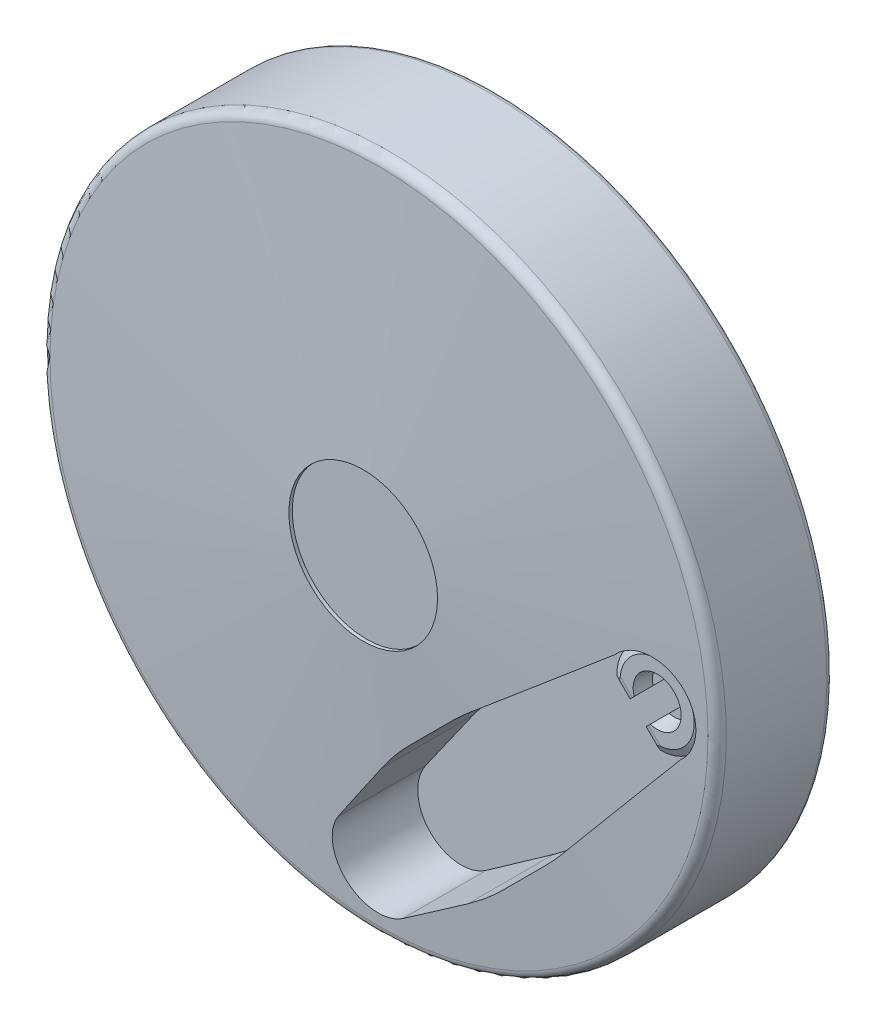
ISO-10303-21;
HEADER;
FILE_DESCRIPTION(('STEP AP214'),'2;1');
FILE_NAME('part.step','',(''),(''),'','','');
FILE_SCHEMA(('AUTOMOTIVE_DESIGN { 1 0 10303 214 1 1 1 1 }'));
ENDSEC;
DATA;
#1=APPLICATION_CONTEXT('core data for automotive mechanical design processes');
#2=APPLICATION_PROTOCOL_DEFINITION('international standard','automotive_design',2000,#1);
#3=PRODUCT_CONTEXT('',#1,'mechanical');
#4=PRODUCT('Part','Part','',(#3));
#5=PRODUCT_RELATED_PRODUCT_CATEGORY('part','',(#4));
#6=PRODUCT_DEFINITION_FORMATION('','',#4);
#7=PRODUCT_DEFINITION_CONTEXT('part definition',#1,'design');
#8=PRODUCT_DEFINITION('design','',#6,#7);
#9=PRODUCT_DEFINITION_SHAPE('','',#8);
#10=(LENGTH_UNIT() NAMED_UNIT(*) SI_UNIT(.MILLI.,.METRE.));
#11=(NAMED_UNIT(*) PLANE_ANGLE_UNIT() SI_UNIT($,.RADIAN.));
#12=(NAMED_UNIT(*) SI_UNIT($,.STERADIAN.) SOLID_ANGLE_UNIT());
#13=UNCERTAINTY_MEASURE_WITH_UNIT(LENGTH_MEASURE(1.E-05),#10,'distance_accuracy_value','');
#14=(GEOMETRIC_REPRESENTATION_CONTEXT(3) GLOBAL_UNCERTAINTY_ASSIGNED_CONTEXT((#13)) GLOBAL_UNIT_ASSIGNED_CONTEXT((#10,
#11,#12)) REPRESENTATION_CONTEXT('',''));
#15=CARTESIAN_POINT('',(0.,0.,0.));
#16=DIRECTION('',(0.,0.,1.));
#17=DIRECTION('',(1.,0.,0.));
#18=AXIS2_PLACEMENT_3D('',#15,#16,#17);
#19=CARTESIAN_POINT('',(81.,0.,24.0000000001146));
#20=DIRECTION('',(0.,0.,-1.));
#21=DIRECTION('',(-0.707106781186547,0.707106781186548,0.));
#22=AXIS2_PLACEMENT_3D('',#19,#20,#21);
#23=CONICAL_SURFACE('',#22,2.99999999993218,0.785398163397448);
#24=CARTESIAN_POINT('',(81.,0.,24.0000000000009));
#25=DIRECTION('',(0.,0.,1.));
#26=DIRECTION('',(-0.707106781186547,0.707106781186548,0.));
#27=AXIS2_PLACEMENT_3D('',#24,#25,#26);
#28=CIRCLE('',#27,3.00000000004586);
#29=CARTESIAN_POINT('',(78.8786796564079,2.12132034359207,24.0000000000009));
#30=VERTEX_POINT('',#29);
#31=EDGE_CURVE('E980',#30,#30,#28,.F.);
#32=ORIENTED_EDGE('',*,*,#31,.T.);
#33=EDGE_LOOP('',(#32));
#34=FACE_BOUND('',#33,.T.);
#35=CARTESIAN_POINT('',(81.,0.,24.541499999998));
#36=DIRECTION('',(0.,0.,1.));
#37=DIRECTION('',(-0.707106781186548,-0.707106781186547,0.));
#38=AXIS2_PLACEMENT_3D('',#35,#36,#37);
#39=CIRCLE('',#38,2.45850000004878);
#40=CARTESIAN_POINT('',(79.2615779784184,-1.73842202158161,24.541499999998));
#41=VERTEX_POINT('',#40);
#42=EDGE_CURVE('E533',#41,#41,#39,.T.);
#43=ORIENTED_EDGE('',*,*,#42,.T.);
#44=EDGE_LOOP('',(#43));
#45=FACE_BOUND('',#44,.T.);
#46=ADVANCED_FACE('F15',(#34,#45),#23,.F.);
#47=CARTESIAN_POINT('',(81.,0.,27.5));
#48=DIRECTION('',(0.,0.,-1.));
#49=DIRECTION('',(-0.707106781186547,0.707106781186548,0.));
#50=AXIS2_PLACEMENT_3D('',#47,#48,#49);
#51=CYLINDRICAL_SURFACE('',#50,2.4585);
#52=ORIENTED_EDGE('',*,*,#42,.F.);
#53=EDGE_LOOP('',(#52));
#54=FACE_BOUND('',#53,.T.);
#55=CARTESIAN_POINT('',(81.,0.,30.458499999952));
#56=DIRECTION('',(0.,0.,-1.));
#57=DIRECTION('',(-0.707106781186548,-0.707106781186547,0.));
#58=AXIS2_PLACEMENT_3D('',#55,#56,#57);
#59=CIRCLE('',#58,2.45849999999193);
#60=CARTESIAN_POINT('',(79.2615779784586,-1.73842202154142,30.458499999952));
#61=VERTEX_POINT('',#60);
#62=EDGE_CURVE('E522',#61,#61,#59,.T.);
#63=ORIENTED_EDGE('',*,*,#62,.F.);
#64=EDGE_LOOP('',(#63));
#65=FACE_BOUND('',#64,.T.);
#66=ADVANCED_FACE('F443',(#54,#65),#51,.F.);
#67=CARTESIAN_POINT('',(81.,0.,34.9603149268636));
#68=DIRECTION('',(0.,0.,-1.));
#69=DIRECTION('',(-0.707106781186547,0.707106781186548,0.));
#70=AXIS2_PLACEMENT_3D('',#67,#68,#69);
#71=CYLINDRICAL_SURFACE('',#70,13.);
#72=CARTESIAN_POINT('',(81.,0.,26.3));
#73=DIRECTION('',(0.,0.,1.));
#74=DIRECTION('',(-0.707106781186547,0.707106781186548,0.));
#75=AXIS2_PLACEMENT_3D('',#72,#73,#74);
#76=CIRCLE('',#75,13.);
#77=CARTESIAN_POINT('',(68.0027893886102,-0.269288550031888,26.3));
#78=VERTEX_POINT('',#77);
#79=CARTESIAN_POINT('',(71.2754148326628,8.62742391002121,26.3));
#80=VERTEX_POINT('',#79);
#81=EDGE_CURVE('E563',#78,#80,#76,.F.);
#82=ORIENTED_EDGE('',*,*,#81,.F.);
#83=DIRECTION('',(0.,0.,-1.));
#84=VECTOR('',#83,1.);
#85=CARTESIAN_POINT('',(68.0027893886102,-0.269288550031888,34.9603149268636));
#86=LINE('',#85,#84);
#87=CARTESIAN_POINT('',(68.0027893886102,-0.269288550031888,24.));
#88=VERTEX_POINT('',#87);
#89=EDGE_CURVE('E564',#88,#78,#86,.F.);
#90=ORIENTED_EDGE('',*,*,#89,.F.);
#91=CARTESIAN_POINT('',(81.,0.,24.));
#92=DIRECTION('',(0.,0.,1.));
#93=DIRECTION('',(-0.707106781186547,0.707106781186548,0.));
#94=AXIS2_PLACEMENT_3D('',#91,#92,#93);
#95=CIRCLE('',#94,13.);
#96=CARTESIAN_POINT('',(68.0552621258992,-1.19739774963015,24.));
#97=VERTEX_POINT('',#96);
#98=EDGE_CURVE('E628',#88,#97,#95,.T.);
#99=ORIENTED_EDGE('',*,*,#98,.T.);
#100=DIRECTION('',(0.,0.,1.));
#101=VECTOR('',#100,1.);
#102=CARTESIAN_POINT('',(68.0552621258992,-1.19739774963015,44.));
#103=LINE('',#102,#101);
#104=CARTESIAN_POINT('',(68.0552621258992,-1.19739774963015,44.));
#105=VERTEX_POINT('',#104);
#106=EDGE_CURVE('E567',#105,#97,#103,.F.);
#107=ORIENTED_EDGE('',*,*,#106,.F.);
#108=CARTESIAN_POINT('',(68.0009806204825,-0.15967207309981,45.9206298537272));
#109=CARTESIAN_POINT('',(68.0017542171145,-0.22279973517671,45.8677029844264));
#110=CARTESIAN_POINT('',(68.0029721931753,-0.284294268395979,45.8128732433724));
#111=CARTESIAN_POINT('',(68.0061289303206,-0.403583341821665,45.6991444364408));
#112=CARTESIAN_POINT('',(68.0080689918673,-0.461370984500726,45.6402381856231));
#113=CARTESIAN_POINT('',(68.01477080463,-0.629652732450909,45.4556957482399));
#114=CARTESIAN_POINT('',(68.0203848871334,-0.73336552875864,45.3236256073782));
#115=CARTESIAN_POINT('',(68.0305592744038,-0.893576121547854,45.0764587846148));
#116=CARTESIAN_POINT('',(68.0350510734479,-0.955434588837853,44.9648402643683));
#117=CARTESIAN_POINT('',(68.0431791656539,-1.05996919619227,44.7336840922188));
#118=CARTESIAN_POINT('',(68.0468217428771,-1.10278851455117,44.6142135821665));
#119=CARTESIAN_POINT('',(68.0513843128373,-1.15490252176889,44.4119004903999));
#120=CARTESIAN_POINT('',(68.0528103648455,-1.17067289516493,44.3307148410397));
#121=CARTESIAN_POINT('',(68.0547624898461,-1.19199833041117,44.1663926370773));
#122=CARTESIAN_POINT('',(68.0552817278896,-1.19747583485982,44.0832460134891));
#123=CARTESIAN_POINT('',(68.0552621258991,-1.19739774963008,44.));
#124=B_SPLINE_CURVE_WITH_KNOTS('',3,(#108,#109,#110,#111,#112,#113,#114,#115,#116,#117,#118,
#119,#120,#121,#122,#123),.UNSPECIFIED.,.F.,.F.,(4,2,2,2,2,2,2,4),(0.,0.247043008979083,
0.494533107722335,0.996047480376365,1.37779950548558,1.75663000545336,2.00415790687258,
2.25354358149),.UNSPECIFIED.);
#125=CARTESIAN_POINT('',(68.0009806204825,-0.159672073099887,45.9206298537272));
#126=VERTEX_POINT('',#125);
#127=EDGE_CURVE('E486',#126,#105,#124,.T.);
#128=ORIENTED_EDGE('',*,*,#127,.F.);
#129=CARTESIAN_POINT('',(81.,0.,45.9206298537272));
#130=DIRECTION('',(0.,0.,1.));
#131=DIRECTION('',(-0.707106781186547,0.707106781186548,0.));
#132=AXIS2_PLACEMENT_3D('',#129,#130,#131);
#133=CIRCLE('',#132,13.);
#134=CARTESIAN_POINT('',(71.2754148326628,8.62742391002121,45.9206298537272));
#135=VERTEX_POINT('',#134);
#136=EDGE_CURVE('E664',#135,#126,#133,.T.);
#137=ORIENTED_EDGE('',*,*,#136,.F.);
#138=DIRECTION('',(0.,0.,-1.));
#139=VECTOR('',#138,1.);
#140=CARTESIAN_POINT('',(71.2754148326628,8.62742391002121,34.9603149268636));
#141=LINE('',#140,#139);
#142=CARTESIAN_POINT('',(71.2754148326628,8.62742391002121,38.8325442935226));
#143=VERTEX_POINT('',#142);
#144=EDGE_CURVE('E671',#143,#135,#141,.F.);
#145=ORIENTED_EDGE('',*,*,#144,.F.);
#146=CARTESIAN_POINT('',(70.5088082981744,7.67690671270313,37.));
#147=CARTESIAN_POINT('',(70.5088104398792,7.6769116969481,37.1109681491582));
#148=CARTESIAN_POINT('',(70.514370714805,7.68452617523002,37.2220792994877));
#149=CARTESIAN_POINT('',(70.536556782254,7.71470631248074,37.4412743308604));
#150=CARTESIAN_POINT('',(70.5532052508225,7.7373026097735,37.5493515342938));
#151=CARTESIAN_POINT('',(70.5973124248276,7.79650203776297,37.759153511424));
#152=CARTESIAN_POINT('',(70.6247582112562,7.83308842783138,37.8608857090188));
#153=CARTESIAN_POINT('',(70.6900364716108,7.91880926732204,38.0552661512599));
#154=CARTESIAN_POINT('',(70.7278649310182,7.96793886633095,38.147917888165));
#155=CARTESIAN_POINT('',(70.8136527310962,8.07732524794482,38.3223357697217));
#156=CARTESIAN_POINT('',(70.8616864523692,8.13766329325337,38.4040143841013));
#157=CARTESIAN_POINT('',(70.9669046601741,8.26703918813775,38.5534104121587));
#158=CARTESIAN_POINT('',(71.0240901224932,8.33607796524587,38.6211263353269));
#159=CARTESIAN_POINT('',(71.1468414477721,8.48081964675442,38.7409881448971));
#160=CARTESIAN_POINT('',(71.2124476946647,8.55655407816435,38.7930546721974));
#161=CARTESIAN_POINT('',(71.3503970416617,8.71182729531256,38.8796296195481));
#162=CARTESIAN_POINT('',(71.4227397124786,8.79136583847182,38.9141391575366));
#163=CARTESIAN_POINT('',(71.571806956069,8.95103378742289,38.9643590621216));
#164=CARTESIAN_POINT('',(71.6484929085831,9.03115373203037,38.9802140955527));
#165=CARTESIAN_POINT('',(71.8046898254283,9.19014065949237,38.9931242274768));
#166=CARTESIAN_POINT('',(71.8842006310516,9.26900771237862,38.9901803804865));
#167=CARTESIAN_POINT('',(72.0430524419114,9.42258984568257,38.9656902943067));
#168=CARTESIAN_POINT('',(72.1223893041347,9.49733413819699,38.944299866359));
#169=CARTESIAN_POINT('',(72.2791335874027,9.64146424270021,38.883768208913));
#170=CARTESIAN_POINT('',(72.3565409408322,9.71084986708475,38.8446263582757));
#171=CARTESIAN_POINT('',(72.5072548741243,9.84293509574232,38.7495427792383));
#172=CARTESIAN_POINT('',(72.5805440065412,9.90560714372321,38.6935351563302));
#173=CARTESIAN_POINT('',(72.7202486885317,10.0226761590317,38.5663627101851));
#174=CARTESIAN_POINT('',(72.786664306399,10.0770732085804,38.4951980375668));
#175=CARTESIAN_POINT('',(72.9109545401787,10.1771206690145,38.338878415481));
#176=CARTESIAN_POINT('',(72.9687365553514,10.2226776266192,38.2535899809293));
#177=CARTESIAN_POINT('',(73.0728430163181,10.3036181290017,38.0718470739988));
#178=CARTESIAN_POINT('',(73.1191622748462,10.3389970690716,37.9753875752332));
#179=CARTESIAN_POINT('',(73.1985748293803,10.3990508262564,37.7738748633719));
#180=CARTESIAN_POINT('',(73.2316463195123,10.4237080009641,37.668807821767));
#181=CARTESIAN_POINT('',(73.2830465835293,10.4618196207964,37.4533371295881));
#182=CARTESIAN_POINT('',(73.3014065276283,10.4752977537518,37.3429452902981));
#183=CARTESIAN_POINT('',(73.3157330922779,10.4858024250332,37.193140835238));
#184=CARTESIAN_POINT('',(73.3184904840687,10.4878223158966,37.1545968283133));
#185=CARTESIAN_POINT('',(73.3221714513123,10.4905173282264,37.0773743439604));
#186=CARTESIAN_POINT('',(73.3230950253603,10.4911924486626,37.0386958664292));
#187=CARTESIAN_POINT('',(73.323088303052,10.4911895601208,36.8890318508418));
#188=CARTESIAN_POINT('',(73.31547382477,10.485629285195,36.7779207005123));
#189=CARTESIAN_POINT('',(73.2852936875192,10.463443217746,36.5587256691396));
#190=CARTESIAN_POINT('',(73.2626973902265,10.4467947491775,36.4506484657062));
#191=CARTESIAN_POINT('',(73.2034979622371,10.4026875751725,36.240846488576));
#192=CARTESIAN_POINT('',(73.1669115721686,10.3752417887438,36.1391142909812));
#193=CARTESIAN_POINT('',(73.081190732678,10.3099635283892,35.9447338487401));
#194=CARTESIAN_POINT('',(73.0320611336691,10.2721350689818,35.852082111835));
#195=CARTESIAN_POINT('',(72.9226747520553,10.1863472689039,35.6776642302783));
#196=CARTESIAN_POINT('',(72.8623367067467,10.1383135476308,35.5959856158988));
#197=CARTESIAN_POINT('',(72.7329608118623,10.0330953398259,35.4465895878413));
#198=CARTESIAN_POINT('',(72.6639220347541,9.97590987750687,35.3788736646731));
#199=CARTESIAN_POINT('',(72.5191803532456,9.85315855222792,35.2590118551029));
#200=CARTESIAN_POINT('',(72.4434459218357,9.78755230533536,35.2069453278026));
#201=CARTESIAN_POINT('',(72.2881727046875,9.64960295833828,35.1203703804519));
#202=CARTESIAN_POINT('',(72.2086341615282,9.5772602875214,35.0858608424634));
#203=CARTESIAN_POINT('',(72.0489662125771,9.428193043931,35.0356409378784));
#204=CARTESIAN_POINT('',(71.9688462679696,9.35150709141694,35.0197859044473));
#205=CARTESIAN_POINT('',(71.8098593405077,9.19531017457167,35.0068757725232));
#206=CARTESIAN_POINT('',(71.7309922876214,9.11579936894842,35.0098196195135));
#207=CARTESIAN_POINT('',(71.5774101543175,8.95694755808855,35.0343097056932));
#208=CARTESIAN_POINT('',(71.502665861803,8.87761069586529,35.0557001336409));
#209=CARTESIAN_POINT('',(71.3585357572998,8.7208664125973,35.116231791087));
#210=CARTESIAN_POINT('',(71.2891501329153,8.64345905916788,35.1553736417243));
#211=CARTESIAN_POINT('',(71.1570649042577,8.4927451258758,35.2504572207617));
#212=CARTESIAN_POINT('',(71.0943928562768,8.41945599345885,35.3064648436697));
#213=CARTESIAN_POINT('',(70.9773238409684,8.27975131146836,35.4336372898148));
#214=CARTESIAN_POINT('',(70.9229267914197,8.21333569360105,35.5048019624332));
#215=CARTESIAN_POINT('',(70.8228793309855,8.08904545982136,35.661121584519));
#216=CARTESIAN_POINT('',(70.7773223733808,8.03126344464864,35.7464100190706));
#217=CARTESIAN_POINT('',(70.6963818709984,7.92715698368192,35.9281529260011));
#218=CARTESIAN_POINT('',(70.6610029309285,7.88083772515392,36.0246124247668));
#219=CARTESIAN_POINT('',(70.6009491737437,7.80142517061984,36.2261251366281));
#220=CARTESIAN_POINT('',(70.5762919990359,7.76835368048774,36.3311921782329));
#221=CARTESIAN_POINT('',(70.5381803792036,7.71695341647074,36.5466628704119));
#222=CARTESIAN_POINT('',(70.5247022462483,7.6985934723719,36.6570547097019));
#223=CARTESIAN_POINT('',(70.5141975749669,7.68426690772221,36.806859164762));
#224=CARTESIAN_POINT('',(70.5121776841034,7.68150951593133,36.8454031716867));
#225=CARTESIAN_POINT('',(70.5094826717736,7.67782854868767,36.9226256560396));
#226=CARTESIAN_POINT('',(70.5088075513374,7.67690497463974,36.9613041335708));
#227=CARTESIAN_POINT('',(70.5088082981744,7.67690671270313,37.));
#228=B_SPLINE_CURVE_WITH_KNOTS('',3,(#146,#147,#148,#149,#150,#151,#152,#153,#154,#155,#156,
#157,#158,#159,#160,#161,#162,#163,#164,#165,#166,#167,#168,#169,#170,#171,#172,#173,#174,#175,
#176,#177,#178,#179,#180,#181,#182,#183,#184,#185,#186,#187,#188,#189,#190,#191,#192,#193,#194,
#195,#196,#197,#198,#199,#200,#201,#202,#203,#204,#205,#206,#207,#208,#209,#210,#211,#212,#213,
#214,#215,#216,#217,#218,#219,#220,#221,#222,#223,#224,#225,#226,#227),.UNSPECIFIED.,.T.,.F.,(4,
2,2,2,2,2,2,2,2,2,2,2,2,2,2,2,2,2,2,2,2,2,2,2,2,2,2,2,2,2,2,2,2,2,2,2,2,2,2,2,4),(0.,
0.332756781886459,0.666196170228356,0.99923780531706,1.33215084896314,1.66757908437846,
2.00304310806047,2.34018065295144,2.6772967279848,3.01178084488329,3.34624619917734,
3.67791381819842,4.00959304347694,4.34258533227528,4.67557431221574,5.0119117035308,
5.34840102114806,5.68544194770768,6.02176686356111,6.13780288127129,6.25383898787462,
6.58659576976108,6.92003515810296,7.25307679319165,7.5859898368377,7.92141807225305,
8.25688209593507,8.59401964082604,8.93113571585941,9.26561983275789,9.60008518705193,
9.93175280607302,10.2634320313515,10.5964243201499,10.9294133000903,11.2657506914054,
11.6022400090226,11.9392809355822,12.2756058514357,12.3916418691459,12.5076779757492),.UNSPECIFIED.);
#229=CARTESIAN_POINT('',(71.2754148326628,8.62742391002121,35.1674557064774));
#230=VERTEX_POINT('',#229);
#231=EDGE_CURVE('E487',#230,#143,#228,.T.);
#232=ORIENTED_EDGE('',*,*,#231,.F.);
#233=EDGE_CURVE('E674',#80,#230,#141,.F.);
#234=ORIENTED_EDGE('',*,*,#233,.F.);
#235=EDGE_LOOP('',(#82,#90,#99,#107,#128,#137,#145,#232,#234));
#236=FACE_BOUND('',#235,.T.);
#237=ADVANCED_FACE('F450',(#236),#71,.T.);
#238=CARTESIAN_POINT('',(49.8873016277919,-5.65685424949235,26.3));
#239=DIRECTION('',(0.,0.,1.));
#240=DIRECTION('',(0.707106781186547,-0.707106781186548,0.));
#241=AXIS2_PLACEMENT_3D('',#238,#239,#240);
#242=PLANE('',#241);
#243=DIRECTION('',(-0.707106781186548,-0.707106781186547,0.));
#244=VECTOR('',#243,1.);
#245=CARTESIAN_POINT('',(56.2512626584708,-12.0208152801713,26.3));
#246=LINE('',#245,#244);
#247=CARTESIAN_POINT('',(81.2692885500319,12.9972106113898,26.3));
#248=VERTEX_POINT('',#247);
#249=EDGE_CURVE('E536',#78,#248,#246,.F.);
#250=ORIENTED_EDGE('',*,*,#249,.F.);
#251=ORIENTED_EDGE('',*,*,#81,.T.);
#252=EDGE_CURVE('E150',#80,#248,#76,.F.);
#253=ORIENTED_EDGE('',*,*,#252,.T.);
#254=EDGE_LOOP('',(#250,#251,#253));
#255=FACE_BOUND('',#254,.T.);
#256=ADVANCED_FACE('F465',(#255),#242,.F.);
#257=CARTESIAN_POINT('',(99.3847763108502,-18.3847763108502,37.));
#258=DIRECTION('',(0.707106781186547,-0.707106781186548,0.));
#259=DIRECTION('',(-0.707106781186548,-0.707106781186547,0.));
#260=AXIS2_PLACEMENT_3D('',#257,#258,#259);
#261=CYLINDRICAL_SURFACE('',#260,1.99);
#262=CARTESIAN_POINT('',(72.2955155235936,8.70448447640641,37.));
#263=DIRECTION('',(-0.707106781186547,0.707106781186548,0.));
#264=DIRECTION('',(-0.707106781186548,-0.707106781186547,0.));
#265=AXIS2_PLACEMENT_3D('',#262,#263,#264);
#266=CIRCLE('',#265,1.99);
#267=CARTESIAN_POINT('',(70.8883730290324,7.29734198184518,37.));
#268=VERTEX_POINT('',#267);
#269=EDGE_CURVE('E526',#268,#268,#266,.F.);
#270=ORIENTED_EDGE('',*,*,#269,.T.);
#271=EDGE_LOOP('',(#270));
#272=FACE_BOUND('',#271,.T.);
#273=EDGE_CURVE('E478',#143,#230,#228,.T.);
#274=ORIENTED_EDGE('',*,*,#273,.T.);
#275=ORIENTED_EDGE('',*,*,#231,.T.);
#276=EDGE_LOOP('',(#274,#275));
#277=FACE_BOUND('',#276,.T.);
#278=ADVANCED_FACE('F468',(#272,#277),#261,.F.);
#279=CARTESIAN_POINT('',(80.8403279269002,-12.9990193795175,45.9206298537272));
#280=VERTEX_POINT('',#279);
#281=CARTESIAN_POINT('',(89.6274239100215,-9.72458516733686,45.9206298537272));
#282=VERTEX_POINT('',#281);
#283=EDGE_CURVE('E656',#280,#282,#133,.T.);
#284=ORIENTED_EDGE('',*,*,#283,.F.);
#285=CARTESIAN_POINT('',(79.8026022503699,-12.9447378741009,44.));
#286=CARTESIAN_POINT('',(79.8025647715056,-12.944729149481,44.0658360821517));
#287=CARTESIAN_POINT('',(79.8059781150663,-12.9450500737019,44.1316489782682));
#288=CARTESIAN_POINT('',(79.8194141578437,-12.9462851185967,44.2624996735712));
#289=CARTESIAN_POINT('',(79.8294274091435,-12.9471983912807,44.3275384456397));
#290=CARTESIAN_POINT('',(79.8555865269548,-12.9495357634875,44.4553949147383));
#291=CARTESIAN_POINT('',(79.8716438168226,-12.9509524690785,44.5182310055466));
#292=CARTESIAN_POINT('',(79.9094261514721,-12.9541889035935,44.6421606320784));
#293=CARTESIAN_POINT('',(79.9311527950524,-12.9560087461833,44.7032536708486));
#294=CARTESIAN_POINT('',(80.003751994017,-12.9618606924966,44.8826250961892));
#295=CARTESIAN_POINT('',(80.0622328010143,-12.9663041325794,44.9978612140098));
#296=CARTESIAN_POINT('',(80.1955431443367,-12.975258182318,45.2191171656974));
#297=CARTESIAN_POINT('',(80.2704680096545,-12.9797690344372,45.3250779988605));
#298=CARTESIAN_POINT('',(80.4247028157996,-12.9874697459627,45.5168719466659));
#299=CARTESIAN_POINT('',(80.5028404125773,-12.9907462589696,45.6036590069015));
#300=CARTESIAN_POINT('',(80.6664627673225,-12.9959799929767,45.7684026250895));
#301=CARTESIAN_POINT('',(80.7518683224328,-12.997949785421,45.8464371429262));
#302=CARTESIAN_POINT('',(80.8403279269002,-12.9990193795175,45.9206298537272));
#303=B_SPLINE_CURVE_WITH_KNOTS('',3,(#285,#286,#287,#288,#289,#290,#291,#292,#293,#294,#295,
#296,#297,#298,#299,#300,#301,#302),.UNSPECIFIED.,.F.,.F.,(4,2,2,2,2,2,2,2,4),(0.,
0.197381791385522,0.394481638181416,0.588798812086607,0.783170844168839,1.16929381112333,
1.55771727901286,1.90760841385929,2.25408258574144),.UNSPECIFIED.);
#304=CARTESIAN_POINT('',(79.8026022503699,-12.9447378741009,44.));
#305=VERTEX_POINT('',#304);
#306=EDGE_CURVE('E505',#305,#280,#303,.T.);
#307=ORIENTED_EDGE('',*,*,#306,.F.);
#308=DIRECTION('',(0.,0.,-1.));
#309=VECTOR('',#308,1.);
#310=CARTESIAN_POINT('',(79.8026022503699,-12.9447378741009,34.9603149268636));
#311=LINE('',#310,#309);
#312=CARTESIAN_POINT('',(79.8026022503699,-12.9447378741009,24.));
#313=VERTEX_POINT('',#312);
#314=EDGE_CURVE('E638',#313,#305,#311,.F.);
#315=ORIENTED_EDGE('',*,*,#314,.F.);
#316=CARTESIAN_POINT('',(81.,0.,24.));
#317=DIRECTION('',(0.,0.,1.));
#318=DIRECTION('',(-0.707106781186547,0.707106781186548,0.));
#319=AXIS2_PLACEMENT_3D('',#316,#317,#318);
#320=CIRCLE('',#319,13.);
#321=CARTESIAN_POINT('',(80.7307114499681,-12.9972106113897,24.));
#322=VERTEX_POINT('',#321);
#323=EDGE_CURVE('E629',#313,#322,#320,.T.);
#324=ORIENTED_EDGE('',*,*,#323,.T.);
#325=DIRECTION('',(0.,0.,-1.));
#326=VECTOR('',#325,1.);
#327=CARTESIAN_POINT('',(80.7307114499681,-12.9972106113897,34.9603149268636));
#328=LINE('',#327,#326);
#329=CARTESIAN_POINT('',(80.7307114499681,-12.9972106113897,26.3));
#330=VERTEX_POINT('',#329);
#331=EDGE_CURVE('E635',#330,#322,#328,.T.);
#332=ORIENTED_EDGE('',*,*,#331,.F.);
#333=CARTESIAN_POINT('',(81.,0.,26.3));
#334=DIRECTION('',(0.,0.,1.));
#335=DIRECTION('',(-0.707106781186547,0.707106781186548,0.));
#336=AXIS2_PLACEMENT_3D('',#333,#334,#335);
#337=CIRCLE('',#336,13.);
#338=CARTESIAN_POINT('',(89.6274239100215,-9.72458516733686,26.3));
#339=VERTEX_POINT('',#338);
#340=EDGE_CURVE('E642',#339,#330,#337,.F.);
#341=ORIENTED_EDGE('',*,*,#340,.F.);
#342=DIRECTION('',(0.,0.,-1.));
#343=VECTOR('',#342,1.);
#344=CARTESIAN_POINT('',(89.6274239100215,-9.72458516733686,34.9603149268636));
#345=LINE('',#344,#343);
#346=CARTESIAN_POINT('',(89.6274239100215,-9.72458516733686,35.1674557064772));
#347=VERTEX_POINT('',#346);
#348=EDGE_CURVE('E520',#347,#339,#345,.T.);
#349=ORIENTED_EDGE('',*,*,#348,.F.);
#350=CARTESIAN_POINT('',(91.4911917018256,-7.67690671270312,37.));
#351=CARTESIAN_POINT('',(91.4911895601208,-7.67691169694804,37.1109681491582));
#352=CARTESIAN_POINT('',(91.485629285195,-7.68452617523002,37.2220792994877));
#353=CARTESIAN_POINT('',(91.463443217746,-7.7147063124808,37.4412743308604));
#354=CARTESIAN_POINT('',(91.4467947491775,-7.73730260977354,37.5493515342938));
#355=CARTESIAN_POINT('',(91.4026875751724,-7.796502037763,37.759153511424));
#356=CARTESIAN_POINT('',(91.3752417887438,-7.83308842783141,37.8608857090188));
#357=CARTESIAN_POINT('',(91.3099635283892,-7.91880926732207,38.0552661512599));
#358=CARTESIAN_POINT('',(91.2721350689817,-7.96793886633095,38.147917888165));
#359=CARTESIAN_POINT('',(91.1863472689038,-8.07732524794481,38.3223357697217));
#360=CARTESIAN_POINT('',(91.1383135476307,-8.13766329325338,38.4040143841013));
#361=CARTESIAN_POINT('',(91.0330953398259,-8.26703918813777,38.5534104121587));
#362=CARTESIAN_POINT('',(90.9759098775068,-8.33607796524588,38.6211263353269));
#363=CARTESIAN_POINT('',(90.8531585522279,-8.48081964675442,38.7409881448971));
#364=CARTESIAN_POINT('',(90.7875523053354,-8.55655407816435,38.7930546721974));
#365=CARTESIAN_POINT('',(90.6496029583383,-8.71182729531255,38.8796296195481));
#366=CARTESIAN_POINT('',(90.5772602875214,-8.7913658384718,38.9141391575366));
#367=CARTESIAN_POINT('',(90.428193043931,-8.95103378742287,38.9643590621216));
#368=CARTESIAN_POINT('',(90.3515070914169,-9.03115373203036,38.9802140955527));
#369=CARTESIAN_POINT('',(90.1953101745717,-9.19014065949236,38.9931242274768));
#370=CARTESIAN_POINT('',(90.1157993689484,-9.26900771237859,38.9901803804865));
#371=CARTESIAN_POINT('',(89.9569475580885,-9.42258984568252,38.9656902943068));
#372=CARTESIAN_POINT('',(89.8776106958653,-9.49733413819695,38.9442998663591));
#373=CARTESIAN_POINT('',(89.7208664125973,-9.64146424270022,38.883768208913));
#374=CARTESIAN_POINT('',(89.6434590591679,-9.71084986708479,38.8446263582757));
#375=CARTESIAN_POINT('',(89.4927451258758,-9.84293509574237,38.7495427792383));
#376=CARTESIAN_POINT('',(89.4194559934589,-9.90560714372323,38.6935351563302));
#377=CARTESIAN_POINT('',(89.2797513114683,-10.0226761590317,38.5663627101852));
#378=CARTESIAN_POINT('',(89.213335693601,-10.0770732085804,38.4951980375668));
#379=CARTESIAN_POINT('',(89.0890454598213,-10.1771206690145,38.338878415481));
#380=CARTESIAN_POINT('',(89.0312634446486,-10.2226776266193,38.2535899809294));
#381=CARTESIAN_POINT('',(88.9271569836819,-10.3036181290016,38.0718470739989));
#382=CARTESIAN_POINT('',(88.8808377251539,-10.3389970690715,37.9753875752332));
#383=CARTESIAN_POINT('',(88.8014251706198,-10.3990508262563,37.7738748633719));
#384=CARTESIAN_POINT('',(88.7683536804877,-10.4237080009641,37.6688078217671));
#385=CARTESIAN_POINT('',(88.7169534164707,-10.4618196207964,37.4533371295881));
#386=CARTESIAN_POINT('',(88.6985934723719,-10.4752977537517,37.3429452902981));
#387=CARTESIAN_POINT('',(88.6842669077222,-10.4858024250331,37.193140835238));
#388=CARTESIAN_POINT('',(88.6815095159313,-10.4878223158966,37.1545968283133));
#389=CARTESIAN_POINT('',(88.6778285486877,-10.4905173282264,37.0773743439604));
#390=CARTESIAN_POINT('',(88.6769049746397,-10.4911924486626,37.0386958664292));
#391=CARTESIAN_POINT('',(88.6769116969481,-10.4911895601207,36.8890318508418));
#392=CARTESIAN_POINT('',(88.68452617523,-10.485629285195,36.7779207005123));
#393=CARTESIAN_POINT('',(88.7147063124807,-10.463443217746,36.5587256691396));
#394=CARTESIAN_POINT('',(88.7373026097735,-10.4467947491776,36.4506484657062));
#395=CARTESIAN_POINT('',(88.7965020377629,-10.4026875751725,36.240846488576));
#396=CARTESIAN_POINT('',(88.8330884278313,-10.3752417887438,36.1391142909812));
#397=CARTESIAN_POINT('',(88.918809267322,-10.3099635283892,35.9447338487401));
#398=CARTESIAN_POINT('',(88.967938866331,-10.2721350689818,35.852082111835));
#399=CARTESIAN_POINT('',(89.0773252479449,-10.1863472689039,35.6776642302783));
#400=CARTESIAN_POINT('',(89.1376632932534,-10.1383135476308,35.5959856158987));
#401=CARTESIAN_POINT('',(89.2670391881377,-10.0330953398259,35.4465895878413));
#402=CARTESIAN_POINT('',(89.3360779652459,-9.97590987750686,35.3788736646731));
#403=CARTESIAN_POINT('',(89.4808196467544,-9.85315855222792,35.2590118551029));
#404=CARTESIAN_POINT('',(89.5565540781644,-9.78755230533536,35.2069453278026));
#405=CARTESIAN_POINT('',(89.7118272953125,-9.64960295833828,35.1203703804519));
#406=CARTESIAN_POINT('',(89.7913658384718,-9.57726028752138,35.0858608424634));
#407=CARTESIAN_POINT('',(89.9510337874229,-9.42819304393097,35.0356409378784));
#408=CARTESIAN_POINT('',(90.0311537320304,-9.35150709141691,35.0197859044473));
#409=CARTESIAN_POINT('',(90.1901406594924,-9.19531017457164,35.0068757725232));
#410=CARTESIAN_POINT('',(90.2690077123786,-9.11579936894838,35.0098196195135));
#411=CARTESIAN_POINT('',(90.4225898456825,-8.95694755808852,35.0343097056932));
#412=CARTESIAN_POINT('',(90.4973341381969,-8.87761069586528,35.0557001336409));
#413=CARTESIAN_POINT('',(90.6414642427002,-8.72086641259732,35.116231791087));
#414=CARTESIAN_POINT('',(90.7108498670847,-8.64345905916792,35.1553736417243));
#415=CARTESIAN_POINT('',(90.8429350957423,-8.49274512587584,35.2504572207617));
#416=CARTESIAN_POINT('',(90.9056071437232,-8.41945599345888,35.3064648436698));
#417=CARTESIAN_POINT('',(91.0226761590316,-8.27975131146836,35.4336372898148));
#418=CARTESIAN_POINT('',(91.0770732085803,-8.21333569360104,35.5048019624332));
#419=CARTESIAN_POINT('',(91.1771206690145,-8.08904545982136,35.661121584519));
#420=CARTESIAN_POINT('',(91.2226776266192,-8.03126344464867,35.7464100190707));
#421=CARTESIAN_POINT('',(91.3036181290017,-7.92715698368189,35.9281529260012));
#422=CARTESIAN_POINT('',(91.3389970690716,-7.88083772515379,36.0246124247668));
#423=CARTESIAN_POINT('',(91.3990508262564,-7.80142517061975,36.2261251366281));
#424=CARTESIAN_POINT('',(91.4237080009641,-7.76835368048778,36.331192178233));
#425=CARTESIAN_POINT('',(91.4618196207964,-7.71695341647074,36.5466628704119));
#426=CARTESIAN_POINT('',(91.4752977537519,-7.69859347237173,36.6570547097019));
#427=CARTESIAN_POINT('',(91.4858024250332,-7.68426690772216,36.806859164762));
#428=CARTESIAN_POINT('',(91.4878223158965,-7.68150951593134,36.8454031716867));
#429=CARTESIAN_POINT('',(91.4905173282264,-7.67782854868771,36.9226256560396));
#430=CARTESIAN_POINT('',(91.4911924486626,-7.67690497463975,36.9613041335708));
#431=CARTESIAN_POINT('',(91.4911917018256,-7.67690671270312,37.));
#432=B_SPLINE_CURVE_WITH_KNOTS('',3,(#350,#351,#352,#353,#354,#355,#356,#357,#358,#359,#360,
#361,#362,#363,#364,#365,#366,#367,#368,#369,#370,#371,#372,#373,#374,#375,#376,#377,#378,#379,
#380,#381,#382,#383,#384,#385,#386,#387,#388,#389,#390,#391,#392,#393,#394,#395,#396,#397,#398,
#399,#400,#401,#402,#403,#404,#405,#406,#407,#408,#409,#410,#411,#412,#413,#414,#415,#416,#417,
#418,#419,#420,#421,#422,#423,#424,#425,#426,#427,#428,#429,#430,#431),.UNSPECIFIED.,.T.,.F.,(4,
2,2,2,2,2,2,2,2,2,2,2,2,2,2,2,2,2,2,2,2,2,2,2,2,2,2,2,2,2,2,2,2,2,2,2,2,2,2,2,4),(0.,
0.332756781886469,0.666196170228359,0.999237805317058,1.33215084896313,1.66757908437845,
2.00304310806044,2.34018065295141,2.67729672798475,3.01178084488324,3.34624619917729,
3.67791381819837,4.00959304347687,4.34258533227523,4.67557431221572,5.01191170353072,
5.34840102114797,5.68544194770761,6.02176686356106,6.13780288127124,6.25383898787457,
6.58659576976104,6.92003515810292,7.25307679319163,7.58598983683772,7.92141807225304,
8.25688209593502,8.59401964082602,8.93113571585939,9.26561983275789,9.60008518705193,
9.93175280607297,10.2634320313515,10.5964243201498,10.9294133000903,11.2657506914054,
11.6022400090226,11.9392809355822,12.2756058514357,12.3916418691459,12.5076779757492),.UNSPECIFIED.);
#433=CARTESIAN_POINT('',(89.6274239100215,-9.72458516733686,38.8325442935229));
#434=VERTEX_POINT('',#433);
#435=EDGE_CURVE('E514',#434,#347,#432,.T.);
#436=ORIENTED_EDGE('',*,*,#435,.F.);
#437=EDGE_CURVE('E670',#282,#434,#345,.T.);
#438=ORIENTED_EDGE('',*,*,#437,.F.);
#439=EDGE_LOOP('',(#284,#307,#315,#324,#332,#341,#349,#436,#438));
#440=FACE_BOUND('',#439,.T.);
#441=ADVANCED_FACE('F473',(#440),#71,.T.);
#442=CARTESIAN_POINT('',(81.,0.,45.9206298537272));
#443=DIRECTION('',(0.,0.,-1.));
#444=DIRECTION('',(-0.707106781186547,0.707106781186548,0.));
#445=AXIS2_PLACEMENT_3D('',#442,#443,#444);
#446=CONICAL_SURFACE('',#445,13.,1.08210413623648);
#447=CARTESIAN_POINT('',(80.8403279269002,-12.9990193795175,45.9206298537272));
#448=CARTESIAN_POINT('',(80.819532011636,-12.9437002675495,45.9499060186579));
#449=CARTESIAN_POINT('',(80.799876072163,-12.8880183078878,45.9793532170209));
#450=CARTESIAN_POINT('',(80.7633137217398,-12.7758373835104,46.0386611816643));
#451=CARTESIAN_POINT('',(80.7464124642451,-12.7193370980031,46.0685226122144));
#452=CARTESIAN_POINT('',(80.7156123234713,-12.6045243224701,46.1292083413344));
#453=CARTESIAN_POINT('',(80.7017784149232,-12.5461979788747,46.1600400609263));
#454=CARTESIAN_POINT('',(80.678299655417,-12.4289403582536,46.2220580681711));
#455=CARTESIAN_POINT('',(80.6686518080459,-12.3700095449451,46.2532440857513));
#456=CARTESIAN_POINT('',(80.6517472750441,-12.2289035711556,46.3279962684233));
#457=CARTESIAN_POINT('',(80.6468342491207,-12.1464986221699,46.3717145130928));
#458=CARTESIAN_POINT('',(80.6503178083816,-11.982245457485,46.4590678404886));
#459=CARTESIAN_POINT('',(80.6586394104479,-11.9003967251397,46.5027019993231));
#460=CARTESIAN_POINT('',(80.6877120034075,-11.7636580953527,46.5758030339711));
#461=CARTESIAN_POINT('',(80.7040000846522,-11.708028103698,46.6056032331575));
#462=CARTESIAN_POINT('',(80.7465592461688,-11.5998130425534,46.6636598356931));
#463=CARTESIAN_POINT('',(80.7728217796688,-11.5472254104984,46.6919175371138));
#464=CARTESIAN_POINT('',(80.8360792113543,-11.4467134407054,46.7459248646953));
#465=CARTESIAN_POINT('',(80.8731570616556,-11.3988291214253,46.7716529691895));
#466=CARTESIAN_POINT('',(80.9569236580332,-11.3100923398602,46.8191662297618));
#467=CARTESIAN_POINT('',(81.0036073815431,-11.2692362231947,46.840953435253));
#468=CARTESIAN_POINT('',(81.0993280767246,-11.1989931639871,46.878056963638));
#469=CARTESIAN_POINT('',(81.1476710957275,-11.1688702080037,46.8938010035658));
#470=CARTESIAN_POINT('',(81.2487649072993,-11.1145976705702,46.9216990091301));
#471=CARTESIAN_POINT('',(81.3015333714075,-11.0904737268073,46.933837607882));
#472=CARTESIAN_POINT('',(81.4615408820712,-11.0272648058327,46.9646914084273));
#473=CARTESIAN_POINT('',(81.572736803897,-10.9958509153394,46.9786393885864));
#474=CARTESIAN_POINT('',(81.7412542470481,-10.9604277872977,46.9918560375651));
#475=CARTESIAN_POINT('',(81.7973364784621,-10.9505970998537,46.9949815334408));
#476=CARTESIAN_POINT('',(81.9098055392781,-10.9341597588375,46.999042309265));
#477=CARTESIAN_POINT('',(81.9661899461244,-10.9275391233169,46.9999871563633));
#478=CARTESIAN_POINT('',(82.0227268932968,-10.9222218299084,47.));
#479=B_SPLINE_CURVE_WITH_KNOTS('',3,(#447,#448,#449,#450,#451,#452,#453,#454,#455,#456,#457,
#458,#459,#460,#461,#462,#463,#464,#465,#466,#467,#468,#469,#470,#471,#472,#473,#474,#475,#476,
#477,#478),.UNSPECIFIED.,.F.,.F.,(4,2,2,2,2,2,2,2,2,2,2,2,2,2,2,4),(0.,0.197877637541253,
0.396121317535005,0.598230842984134,0.800195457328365,1.07977259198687,1.35777136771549,
1.5526075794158,1.74727721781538,1.94348107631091,2.13958260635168,2.31621208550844,
2.49358392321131,2.84010182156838,3.01110709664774,3.18136068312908),.UNSPECIFIED.);
#480=CARTESIAN_POINT('',(82.0227268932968,-10.9222218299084,47.));
#481=VERTEX_POINT('',#480);
#482=EDGE_CURVE('E651',#280,#481,#479,.T.);
#483=ORIENTED_EDGE('',*,*,#482,.F.);
#484=ORIENTED_EDGE('',*,*,#283,.T.);
#485=EDGE_CURVE('E661',#282,#135,#133,.T.);
#486=ORIENTED_EDGE('',*,*,#485,.T.);
#487=ORIENTED_EDGE('',*,*,#136,.T.);
#488=CARTESIAN_POINT('',(70.0777781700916,1.02272689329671,47.));
#489=CARTESIAN_POINT('',(70.0718739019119,0.960110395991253,46.9999770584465));
#490=CARTESIAN_POINT('',(70.0643937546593,0.897691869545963,46.9988231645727));
#491=CARTESIAN_POINT('',(70.0454272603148,0.773163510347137,46.9938106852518));
#492=CARTESIAN_POINT('',(70.0339146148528,0.711058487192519,46.9899341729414));
#493=CARTESIAN_POINT('',(69.9916780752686,0.524153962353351,46.9733731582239));
#494=CARTESIAN_POINT('',(69.9534052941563,0.401024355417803,46.9557246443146));
#495=CARTESIAN_POINT('',(69.876015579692,0.229565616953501,46.9169462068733));
#496=CARTESIAN_POINT('',(69.8472818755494,0.175111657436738,46.9021810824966));
#497=CARTESIAN_POINT('',(69.7828053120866,0.0723602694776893,46.8685024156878));
#498=CARTESIAN_POINT('',(69.7471105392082,0.0240241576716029,46.8496172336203));
#499=CARTESIAN_POINT('',(69.6684573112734,-0.0651074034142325,46.8077122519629));
#500=CARTESIAN_POINT('',(69.6254401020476,-0.105835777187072,46.7846589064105));
#501=CARTESIAN_POINT('',(69.5335416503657,-0.177725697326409,46.7353253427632));
#502=CARTESIAN_POINT('',(69.4846506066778,-0.208870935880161,46.7090397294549));
#503=CARTESIAN_POINT('',(69.3758806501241,-0.264885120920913,46.6506131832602));
#504=CARTESIAN_POINT('',(69.3154183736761,-0.28828378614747,46.6181658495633));
#505=CARTESIAN_POINT('',(69.1919216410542,-0.323632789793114,46.5520335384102));
#506=CARTESIAN_POINT('',(69.1288829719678,-0.335563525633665,46.5183465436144));
#507=CARTESIAN_POINT('',(68.9627221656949,-0.354576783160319,46.4297445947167));
#508=CARTESIAN_POINT('',(68.8589227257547,-0.354097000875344,46.3745865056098));
#509=CARTESIAN_POINT('',(68.6522338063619,-0.336438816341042,46.2649937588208));
#510=CARTESIAN_POINT('',(68.549350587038,-0.319184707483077,46.2105635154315));
#511=CARTESIAN_POINT('',(68.3714793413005,-0.278856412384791,46.1165197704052));
#512=CARTESIAN_POINT('',(68.2960161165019,-0.258357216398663,46.0766399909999));
#513=CARTESIAN_POINT('',(68.1471580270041,-0.212399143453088,45.9979544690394));
#514=CARTESIAN_POINT('',(68.0737495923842,-0.186996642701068,45.9591417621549));
#515=CARTESIAN_POINT('',(68.0009806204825,-0.159672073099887,45.9206298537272));
#516=B_SPLINE_CURVE_WITH_KNOTS('',3,(#488,#489,#490,#491,#492,#493,#494,#495,#496,#497,#498,
#499,#500,#501,#502,#503,#504,#505,#506,#507,#508,#509,#510,#511,#512,#513,#514,#515),
.UNSPECIFIED.,.F.,.F.,(4,2,2,2,2,2,2,2,2,2,2,2,2,4),(0.,0.188517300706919,0.378287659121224,
0.764557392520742,0.953849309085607,1.14187718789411,1.33149177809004,1.52142727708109,
1.73771443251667,1.95437064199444,2.3050251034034,2.65726953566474,2.92044231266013,
3.18075233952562),.UNSPECIFIED.);
#517=CARTESIAN_POINT('',(70.0777781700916,1.02272689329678,47.));
#518=VERTEX_POINT('',#517);
#519=EDGE_CURVE('E576',#518,#126,#516,.T.);
#520=ORIENTED_EDGE('',*,*,#519,.F.);
#521=CARTESIAN_POINT('',(81.,0.,47.));
#522=DIRECTION('',(0.,0.,1.));
#523=DIRECTION('',(-0.707106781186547,0.707106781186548,0.));
#524=AXIS2_PLACEMENT_3D('',#521,#522,#523);
#525=CIRCLE('',#524,10.97);
#526=EDGE_CURVE('E626',#481,#518,#525,.T.);
#527=ORIENTED_EDGE('',*,*,#526,.F.);
#528=EDGE_LOOP('',(#483,#484,#486,#487,#520,#527));
#529=FACE_BOUND('',#528,.T.);
#530=ADVANCED_FACE('F826',(#529),#446,.T.);
#531=CARTESIAN_POINT('',(99.3847763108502,-18.3847763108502,37.));
#532=DIRECTION('',(0.707106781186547,-0.707106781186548,0.));
#533=DIRECTION('',(-0.707106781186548,-0.707106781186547,0.));
#534=AXIS2_PLACEMENT_3D('',#531,#532,#533);
#535=CYLINDRICAL_SURFACE('',#534,1.99);
#536=CARTESIAN_POINT('',(89.7044844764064,-8.70448447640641,37.));
#537=DIRECTION('',(-0.707106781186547,0.707106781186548,0.));
#538=DIRECTION('',(-0.707106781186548,-0.707106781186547,0.));
#539=AXIS2_PLACEMENT_3D('',#536,#537,#538);
#540=CIRCLE('',#539,1.99);
#541=CARTESIAN_POINT('',(88.2973419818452,-10.1116269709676,37.));
#542=VERTEX_POINT('',#541);
#543=EDGE_CURVE('E622',#542,#542,#540,.T.);
#544=ORIENTED_EDGE('',*,*,#543,.T.);
#545=EDGE_LOOP('',(#544));
#546=FACE_BOUND('',#545,.T.);
#547=ORIENTED_EDGE('',*,*,#435,.T.);
#548=EDGE_CURVE('E521',#347,#434,#432,.T.);
#549=ORIENTED_EDGE('',*,*,#548,.T.);
#550=EDGE_LOOP('',(#547,#549));
#551=FACE_BOUND('',#550,.T.);
#552=ADVANCED_FACE('F499',(#546,#551),#535,.F.);
#553=CARTESIAN_POINT('',(68.9791847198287,-24.7487373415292,26.3));
#554=DIRECTION('',(0.,0.,1.));
#555=DIRECTION('',(0.707106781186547,-0.707106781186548,0.));
#556=AXIS2_PLACEMENT_3D('',#553,#554,#555);
#557=PLANE('',#556);
#558=DIRECTION('',(0.707106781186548,0.707106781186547,0.));
#559=VECTOR('',#558,1.);
#560=CARTESIAN_POINT('',(68.9791847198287,-24.7487373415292,26.3));
#561=LINE('',#560,#559);
#562=CARTESIAN_POINT('',(93.9972106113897,0.269288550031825,26.3));
#563=VERTEX_POINT('',#562);
#564=EDGE_CURVE('E632',#563,#330,#561,.F.);
#565=ORIENTED_EDGE('',*,*,#564,.F.);
#566=EDGE_CURVE('E639',#563,#339,#337,.F.);
#567=ORIENTED_EDGE('',*,*,#566,.T.);
#568=ORIENTED_EDGE('',*,*,#340,.T.);
#569=EDGE_LOOP('',(#565,#567,#568));
#570=FACE_BOUND('',#569,.T.);
#571=ADVANCED_FACE('F955',(#570),#557,.F.);
#572=CARTESIAN_POINT('',(68.9791847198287,-24.7487373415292,24.));
#573=DIRECTION('',(-0.707106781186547,0.707106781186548,0.));
#574=DIRECTION('',(0.707106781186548,0.707106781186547,0.));
#575=AXIS2_PLACEMENT_3D('',#572,#573,#574);
#576=PLANE('',#575);
#577=DIRECTION('',(0.707106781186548,0.707106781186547,0.));
#578=VECTOR('',#577,1.);
#579=CARTESIAN_POINT('',(68.9791847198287,-24.7487373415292,24.));
#580=LINE('',#579,#578);
#581=CARTESIAN_POINT('',(93.9972106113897,0.269288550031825,24.));
#582=VERTEX_POINT('',#581);
#583=EDGE_CURVE('E601',#322,#582,#580,.T.);
#584=ORIENTED_EDGE('',*,*,#583,.T.);
#585=DIRECTION('',(0.,0.,-1.));
#586=VECTOR('',#585,1.);
#587=CARTESIAN_POINT('',(93.9972106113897,0.269288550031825,34.9603149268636));
#588=LINE('',#587,#586);
#589=EDGE_CURVE('E625',#582,#563,#588,.F.);
#590=ORIENTED_EDGE('',*,*,#589,.T.);
#591=ORIENTED_EDGE('',*,*,#564,.T.);
#592=ORIENTED_EDGE('',*,*,#331,.T.);
#593=EDGE_LOOP('',(#584,#590,#591,#592));
#594=FACE_BOUND('',#593,.T.);
#595=ADVANCED_FACE('F958',(#594),#576,.F.);
#596=CARTESIAN_POINT('',(92.3137084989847,-25.4558441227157,44.));
#597=DIRECTION('',(0.707106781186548,0.707106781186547,0.));
#598=DIRECTION('',(0.707106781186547,-0.707106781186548,0.));
#599=AXIS2_PLACEMENT_3D('',#596,#597,#598);
#600=PLANE('',#599);
#601=DIRECTION('',(0.707106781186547,-0.707106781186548,0.));
#602=VECTOR('',#601,1.);
#603=CARTESIAN_POINT('',(92.3137084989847,-25.4558441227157,31.));
#604=LINE('',#603,#602);
#605=CARTESIAN_POINT('',(76.2977399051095,-9.4398755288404,31.));
#606=VERTEX_POINT('',#605);
#607=CARTESIAN_POINT('',(71.5601244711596,-4.70226009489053,31.));
#608=VERTEX_POINT('',#607);
#609=EDGE_CURVE('E584',#606,#608,#604,.F.);
#610=ORIENTED_EDGE('',*,*,#609,.T.);
#611=DIRECTION('',(0.,0.,1.));
#612=VECTOR('',#611,1.);
#613=CARTESIAN_POINT('',(71.5601244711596,-4.70226009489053,44.));
#614=LINE('',#613,#612);
#615=CARTESIAN_POINT('',(71.5601244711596,-4.70226009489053,44.));
#616=VERTEX_POINT('',#615);
#617=EDGE_CURVE('E587',#608,#616,#614,.T.);
#618=ORIENTED_EDGE('',*,*,#617,.T.);
#619=DIRECTION('',(0.707106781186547,-0.707106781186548,0.));
#620=VECTOR('',#619,1.);
#621=CARTESIAN_POINT('',(92.3137084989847,-25.4558441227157,44.));
#622=LINE('',#621,#620);
#623=EDGE_CURVE('E571',#616,#105,#622,.F.);
#624=ORIENTED_EDGE('',*,*,#623,.T.);
#625=ORIENTED_EDGE('',*,*,#106,.T.);
#626=DIRECTION('',(0.707106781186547,-0.707106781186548,0.));
#627=VECTOR('',#626,1.);
#628=CARTESIAN_POINT('',(92.3137084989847,-25.4558441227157,24.));
#629=LINE('',#628,#627);
#630=EDGE_CURVE('E570',#97,#313,#629,.T.);
#631=ORIENTED_EDGE('',*,*,#630,.T.);
#632=ORIENTED_EDGE('',*,*,#314,.T.);
#633=DIRECTION('',(0.707106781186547,-0.707106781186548,0.));
#634=VECTOR('',#633,1.);
#635=CARTESIAN_POINT('',(92.3137084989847,-25.4558441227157,44.));
#636=LINE('',#635,#634);
#637=CARTESIAN_POINT('',(76.2977399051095,-9.4398755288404,44.));
#638=VERTEX_POINT('',#637);
#639=EDGE_CURVE('E648',#305,#638,#636,.F.);
#640=ORIENTED_EDGE('',*,*,#639,.T.);
#641=DIRECTION('',(0.,0.,1.));
#642=VECTOR('',#641,1.);
#643=CARTESIAN_POINT('',(76.2977399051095,-9.4398755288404,44.));
#644=LINE('',#643,#642);
#645=EDGE_CURVE('E588',#638,#606,#644,.F.);
#646=ORIENTED_EDGE('',*,*,#645,.T.);
#647=EDGE_LOOP('',(#610,#618,#624,#625,#631,#632,#640,#646));
#648=FACE_BOUND('',#647,.T.);
#649=ADVANCED_FACE('F805',(#648),#600,.F.);
#650=CARTESIAN_POINT('',(94.4350288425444,-23.3345237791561,44.));
#651=DIRECTION('',(0.707106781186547,-0.707106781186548,0.));
#652=DIRECTION('',(-0.707106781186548,-0.707106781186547,0.));
#653=AXIS2_PLACEMENT_3D('',#650,#651,#652);
#654=CYLINDRICAL_SURFACE('',#653,3.);
#655=ORIENTED_EDGE('',*,*,#306,.T.);
#656=ORIENTED_EDGE('',*,*,#482,.T.);
#657=DIRECTION('',(0.707106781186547,-0.707106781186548,0.));
#658=VECTOR('',#657,1.);
#659=CARTESIAN_POINT('',(94.4350288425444,-23.3345237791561,47.));
#660=LINE('',#659,#658);
#661=CARTESIAN_POINT('',(78.4190602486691,-7.31855518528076,47.));
#662=VERTEX_POINT('',#661);
#663=EDGE_CURVE('E645',#662,#481,#660,.T.);
#664=ORIENTED_EDGE('',*,*,#663,.F.);
#665=CARTESIAN_POINT('',(78.4190602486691,-7.31855518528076,44.));
#666=DIRECTION('',(-0.707106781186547,0.707106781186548,0.));
#667=DIRECTION('',(-0.707106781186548,-0.707106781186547,0.));
#668=AXIS2_PLACEMENT_3D('',#665,#666,#667);
#669=CIRCLE('',#668,3.);
#670=EDGE_CURVE('E598',#638,#662,#669,.T.);
#671=ORIENTED_EDGE('',*,*,#670,.F.);
#672=ORIENTED_EDGE('',*,*,#639,.F.);
#673=EDGE_LOOP('',(#655,#656,#664,#671,#672));
#674=FACE_BOUND('',#673,.T.);
#675=ADVANCED_FACE('F795',(#674),#654,.T.);
#676=CARTESIAN_POINT('',(94.4350288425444,-23.3345237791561,44.));
#677=DIRECTION('',(0.707106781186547,-0.707106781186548,0.));
#678=DIRECTION('',(-0.707106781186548,-0.707106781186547,0.));
#679=AXIS2_PLACEMENT_3D('',#676,#677,#678);
#680=CYLINDRICAL_SURFACE('',#679,3.);
#681=ORIENTED_EDGE('',*,*,#519,.T.);
#682=ORIENTED_EDGE('',*,*,#127,.T.);
#683=ORIENTED_EDGE('',*,*,#623,.F.);
#684=CARTESIAN_POINT('',(73.6814448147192,-2.58093975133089,44.));
#685=DIRECTION('',(-0.707106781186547,0.707106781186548,0.));
#686=DIRECTION('',(-0.707106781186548,-0.707106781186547,0.));
#687=AXIS2_PLACEMENT_3D('',#684,#685,#686);
#688=CIRCLE('',#687,3.);
#689=CARTESIAN_POINT('',(73.6814448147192,-2.58093975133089,47.));
#690=VERTEX_POINT('',#689);
#691=EDGE_CURVE('E593',#690,#616,#688,.F.);
#692=ORIENTED_EDGE('',*,*,#691,.F.);
#693=DIRECTION('',(0.707106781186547,-0.707106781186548,0.));
#694=VECTOR('',#693,1.);
#695=CARTESIAN_POINT('',(76.0502525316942,-4.94974746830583,47.));
#696=LINE('',#695,#694);
#697=EDGE_CURVE('E615',#690,#518,#696,.F.);
#698=ORIENTED_EDGE('',*,*,#697,.T.);
#699=EDGE_LOOP('',(#681,#682,#683,#692,#698));
#700=FACE_BOUND('',#699,.T.);
#701=ADVANCED_FACE('F792',(#700),#680,.T.);
#702=CARTESIAN_POINT('',(56.2512626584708,-12.0208152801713,26.3));
#703=DIRECTION('',(0.707106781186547,-0.707106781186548,0.));
#704=DIRECTION('',(-0.707106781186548,-0.707106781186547,0.));
#705=AXIS2_PLACEMENT_3D('',#702,#703,#704);
#706=PLANE('',#705);
#707=ORIENTED_EDGE('',*,*,#249,.T.);
#708=DIRECTION('',(0.,0.,-1.));
#709=VECTOR('',#708,1.);
#710=CARTESIAN_POINT('',(81.2692885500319,12.9972106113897,34.9603149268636));
#711=LINE('',#710,#709);
#712=CARTESIAN_POINT('',(81.2692885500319,12.9972106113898,24.));
#713=VERTEX_POINT('',#712);
#714=EDGE_CURVE('E560',#248,#713,#711,.T.);
#715=ORIENTED_EDGE('',*,*,#714,.T.);
#716=DIRECTION('',(-0.707106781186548,-0.707106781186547,0.));
#717=VECTOR('',#716,1.);
#718=CARTESIAN_POINT('',(70.0398448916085,1.76776695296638,24.));
#719=LINE('',#718,#717);
#720=EDGE_CURVE('E138',#713,#88,#719,.T.);
#721=ORIENTED_EDGE('',*,*,#720,.T.);
#722=ORIENTED_EDGE('',*,*,#89,.T.);
#723=EDGE_LOOP('',(#707,#715,#721,#722));
#724=FACE_BOUND('',#723,.T.);
#725=ADVANCED_FACE('F457',(#724),#706,.F.);
#726=CARTESIAN_POINT('',(89.7044844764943,-8.7044844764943,37.));
#727=DIRECTION('',(-0.707106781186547,0.707106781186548,0.));
#728=DIRECTION('',(0.707106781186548,0.707106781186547,0.));
#729=AXIS2_PLACEMENT_3D('',#726,#727,#728);
#730=CONICAL_SURFACE('',#729,1.98999999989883,0.785398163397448);
#731=ORIENTED_EDGE('',*,*,#543,.F.);
#732=EDGE_LOOP('',(#731));
#733=FACE_BOUND('',#732,.T.);
#734=CARTESIAN_POINT('',(90.8958355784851,-8.43044709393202,36.1481970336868));
#735=CARTESIAN_POINT('',(90.9250279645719,-8.39618070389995,36.1971329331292));
#736=CARTESIAN_POINT('',(90.9516671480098,-8.36454987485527,36.2494516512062));
#737=CARTESIAN_POINT('',(90.999264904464,-8.30759186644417,36.359832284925));
#738=CARTESIAN_POINT('',(91.0202210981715,-8.28226732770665,36.4178965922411));
#739=CARTESIAN_POINT('',(91.0576955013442,-8.2367300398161,36.5444255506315));
#740=CARTESIAN_POINT('',(91.0735762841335,-8.21726292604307,36.6133516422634));
#741=CARTESIAN_POINT('',(91.097355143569,-8.18802662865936,36.7545637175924));
#742=CARTESIAN_POINT('',(91.1052536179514,-8.17825696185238,36.8268495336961));
#743=CARTESIAN_POINT('',(91.1126333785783,-8.16912954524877,36.969154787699));
#744=CARTESIAN_POINT('',(91.1124839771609,-8.1693149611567,37.0391261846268));
#745=CARTESIAN_POINT('',(91.1046872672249,-8.17895671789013,37.17799288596));
#746=CARTESIAN_POINT('',(91.0970411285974,-8.18841161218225,37.246888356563));
#747=CARTESIAN_POINT('',(91.0746385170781,-8.21595794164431,37.3807368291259));
#748=CARTESIAN_POINT('',(91.0599779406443,-8.23393286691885,37.445730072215));
#749=CARTESIAN_POINT('',(91.0239997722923,-8.27769452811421,37.571070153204));
#750=CARTESIAN_POINT('',(91.0026813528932,-8.30348223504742,37.631416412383));
#751=CARTESIAN_POINT('',(90.9531784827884,-8.36276087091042,37.7478050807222));
#752=CARTESIAN_POINT('',(90.9248022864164,-8.39646514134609,37.8036569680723));
#753=CARTESIAN_POINT('',(90.8622536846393,-8.46984494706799,37.9076536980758));
#754=CARTESIAN_POINT('',(90.8280799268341,-8.50952187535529,37.9557967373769));
#755=CARTESIAN_POINT('',(90.7527366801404,-8.59578809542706,38.045748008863));
#756=CARTESIAN_POINT('',(90.7112904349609,-8.64263387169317,38.0870785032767));
#757=CARTESIAN_POINT('',(90.6237918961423,-8.73996061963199,38.1592487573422));
#758=CARTESIAN_POINT('',(90.5777385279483,-8.79044243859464,38.1900860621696));
#759=CARTESIAN_POINT('',(90.4797886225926,-8.89601196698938,38.2418766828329));
#760=CARTESIAN_POINT('',(90.4277181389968,-8.95120451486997,38.2622882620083));
#761=CARTESIAN_POINT('',(90.320980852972,-9.06229836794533,38.2905138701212));
#762=CARTESIAN_POINT('',(90.2663136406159,-9.11819978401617,38.2983259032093));
#763=CARTESIAN_POINT('',(90.1543709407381,-9.23059809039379,38.3012275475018));
#764=CARTESIAN_POINT('',(90.097064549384,-9.28707312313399,38.2959836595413));
#765=CARTESIAN_POINT('',(89.9828576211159,-9.3975840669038,38.2721764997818));
#766=CARTESIAN_POINT('',(89.9259571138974,-9.45161980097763,38.2536122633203));
#767=CARTESIAN_POINT('',(89.8142047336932,-9.55592232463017,38.2035097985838));
#768=CARTESIAN_POINT('',(89.7593572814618,-9.60618119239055,38.1719451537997));
#769=CARTESIAN_POINT('',(89.6536935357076,-9.7014769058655,38.0965390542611));
#770=CARTESIAN_POINT('',(89.6028770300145,-9.74651402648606,38.0526982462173));
#771=CARTESIAN_POINT('',(89.5082821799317,-9.82919112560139,37.9549047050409));
#772=CARTESIAN_POINT('',(89.4643704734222,-9.86697556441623,37.9012035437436));
#773=CARTESIAN_POINT('',(89.3840374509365,-9.93532607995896,37.7844115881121));
#774=CARTESIAN_POINT('',(89.3476139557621,-9.9658942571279,37.7213235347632));
#775=CARTESIAN_POINT('',(89.2854823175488,-10.0176017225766,37.590755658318));
#776=CARTESIAN_POINT('',(89.2593432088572,-10.0391236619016,37.5236327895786));
#777=CARTESIAN_POINT('',(89.2166372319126,-10.0741075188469,37.3844259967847));
#778=CARTESIAN_POINT('',(89.2000664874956,-10.0875727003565,37.3123440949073));
#779=CARTESIAN_POINT('',(89.1779822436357,-10.1054835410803,37.1695787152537));
#780=CARTESIAN_POINT('',(89.1719068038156,-10.1103877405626,37.0990391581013));
#781=CARTESIAN_POINT('',(89.1693526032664,-10.1124518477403,36.9576797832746));
#782=CARTESIAN_POINT('',(89.1728719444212,-10.1096132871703,36.8868600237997));
#783=CARTESIAN_POINT('',(89.1890980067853,-10.0964734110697,36.7490260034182));
#784=CARTESIAN_POINT('',(89.2015455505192,-10.0863826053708,36.6819606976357));
#785=CARTESIAN_POINT('',(89.2347756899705,-10.0592706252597,36.5513990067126));
#786=CARTESIAN_POINT('',(89.2555587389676,-10.0422490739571,36.4879028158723));
#787=CARTESIAN_POINT('',(89.3050303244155,-10.0013755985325,36.3649942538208));
#788=CARTESIAN_POINT('',(89.3338532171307,-9.97740729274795,36.3056748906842));
#789=CARTESIAN_POINT('',(89.3981096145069,-9.92338213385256,36.1937802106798));
#790=CARTESIAN_POINT('',(89.4335445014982,-9.89332400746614,36.1412063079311));
#791=CARTESIAN_POINT('',(89.51168304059,-9.82619092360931,36.0415013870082));
#792=CARTESIAN_POINT('',(89.5546597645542,-9.78884218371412,35.9947688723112));
#793=CARTESIAN_POINT('',(89.6450740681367,-9.70908478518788,35.9109337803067));
#794=CARTESIAN_POINT('',(89.6925127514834,-9.66667487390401,35.8738335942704));
#795=CARTESIAN_POINT('',(89.7929660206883,-9.57541553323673,35.8083172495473));
#796=CARTESIAN_POINT('',(89.8461424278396,-9.52634545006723,35.7804559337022));
#797=CARTESIAN_POINT('',(89.9542038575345,-9.42484638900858,35.7367677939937));
#798=CARTESIAN_POINT('',(90.0090891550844,-9.37241686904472,35.7209429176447));
#799=CARTESIAN_POINT('',(90.1208678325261,-9.26369500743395,35.7013205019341));
#800=CARTESIAN_POINT('',(90.1777668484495,-9.207332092,35.6979439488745));
#801=CARTESIAN_POINT('',(90.2901425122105,-9.09393354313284,35.7044603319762));
#802=CARTESIAN_POINT('',(90.3456188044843,-9.03689774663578,35.7143565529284));
#803=CARTESIAN_POINT('',(90.45418463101,-8.92326348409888,35.7473760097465));
#804=CARTESIAN_POINT('',(90.5072450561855,-8.86667495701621,35.7706293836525));
#805=CARTESIAN_POINT('',(90.608948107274,-8.75635426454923,35.8299511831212));
#806=CARTESIAN_POINT('',(90.6575938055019,-8.70262012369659,35.8660106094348));
#807=CARTESIAN_POINT('',(90.7393613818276,-8.61091038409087,35.9410701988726));
#808=CARTESIAN_POINT('',(90.7735770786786,-8.57202394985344,35.9777879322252));
#809=CARTESIAN_POINT('',(90.8379112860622,-8.4981114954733,36.0580484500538));
#810=CARTESIAN_POINT('',(90.8680314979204,-8.46308387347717,36.1015883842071));
#811=CARTESIAN_POINT('',(90.8958355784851,-8.43044709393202,36.1481970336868));
#812=B_SPLINE_CURVE_WITH_KNOTS('',3,(#734,#735,#736,#737,#738,#739,#740,#741,#742,#743,#744,
#745,#746,#747,#748,#749,#750,#751,#752,#753,#754,#755,#756,#757,#758,#759,#760,#761,#762,#763,
#764,#765,#766,#767,#768,#769,#770,#771,#772,#773,#774,#775,#776,#777,#778,#779,#780,#781,#782,
#783,#784,#785,#786,#787,#788,#789,#790,#791,#792,#793,#794,#795,#796,#797,#798,#799,#800,#801,
#802,#803,#804,#805,#806,#807,#808,#809,#810,#811),.UNSPECIFIED.,.T.,.F.,(4,2,2,2,2,2,2,2,2,2,2,
2,2,2,2,2,2,2,2,2,2,2,2,2,2,2,2,2,2,2,2,2,2,2,2,2,2,2,4),(0.,0.199292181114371,
0.398667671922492,0.617610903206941,0.836543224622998,1.04543782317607,1.25429982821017,
1.46038464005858,1.66649507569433,1.87897210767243,2.09149877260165,2.31541463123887,
2.53938283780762,2.77403618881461,3.00872670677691,3.24947332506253,3.49023738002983,
3.73149309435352,3.97273610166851,4.20851404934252,4.44422328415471,4.66860055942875,
4.8928868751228,5.10474220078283,5.31655561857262,5.52245695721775,5.72836949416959,
5.93795369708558,6.14758176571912,6.36759157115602,6.5876559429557,6.81921546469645,
7.05081244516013,7.29017342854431,7.52959366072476,7.77138710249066,8.01301096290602,
8.20290451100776,8.39271893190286),.UNSPECIFIED.);
#813=CARTESIAN_POINT('',(89.6274239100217,-9.72458516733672,35.9281337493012));
#814=VERTEX_POINT('',#813);
#815=CARTESIAN_POINT('',(89.6274239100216,-9.72458516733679,38.0718662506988));
#816=VERTEX_POINT('',#815);
#817=EDGE_CURVE('E945',#814,#816,#812,.T.);
#818=ORIENTED_EDGE('',*,*,#817,.F.);
#819=CARTESIAN_POINT('',(90.2076053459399,-9.0311737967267,37.));
#820=DIRECTION('',(-0.766947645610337,0.641709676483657,0.));
#821=DIRECTION('',(0.641709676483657,0.766947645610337,0.));
#822=AXIS2_PLACEMENT_3D('',#819,#820,#821);
#823=ELLIPSE('',#822,1.40877044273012,1.39767881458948);
#824=CARTESIAN_POINT('',(89.4595271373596,-9.92524917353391,36.2152519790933));
#825=VERTEX_POINT('',#824);
#826=EDGE_CURVE('E950',#825,#814,#823,.F.);
#827=ORIENTED_EDGE('',*,*,#826,.F.);
#828=CARTESIAN_POINT('',(90.1923881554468,-9.19238815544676,37.));
#829=DIRECTION('',(0.707106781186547,-0.707106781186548,0.));
#830=DIRECTION('',(0.707106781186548,0.707106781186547,0.));
#831=AXIS2_PLACEMENT_3D('',#828,#829,#830);
#832=CIRCLE('',#831,1.29999999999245);
#833=CARTESIAN_POINT('',(89.4595271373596,-9.92524917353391,37.7847480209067));
#834=VERTEX_POINT('',#833);
#835=EDGE_CURVE('E493',#834,#825,#832,.T.);
#836=ORIENTED_EDGE('',*,*,#835,.F.);
#837=EDGE_CURVE('E942',#816,#834,#823,.F.);
#838=ORIENTED_EDGE('',*,*,#837,.F.);
#839=EDGE_LOOP('',(#818,#827,#836,#838));
#840=FACE_BOUND('',#839,.T.);
#841=ADVANCED_FACE('F803',(#733,#840),#730,.T.);
#842=CARTESIAN_POINT('',(74.6103341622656,-6.38966583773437,47.));
#843=DIRECTION('',(0.,0.,1.));
#844=DIRECTION('',(0.707106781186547,-0.707106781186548,0.));
#845=AXIS2_PLACEMENT_3D('',#842,#843,#844);
#846=PLANE('',#845);
#847=DIRECTION('',(-0.707106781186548,-0.707106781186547,0.));
#848=VECTOR('',#847,1.);
#849=CARTESIAN_POINT('',(76.9791418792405,-8.7584735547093,47.));
#850=LINE('',#849,#848);
#851=CARTESIAN_POINT('',(78.9401563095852,-6.79745912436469,47.0000000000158));
#852=VERTEX_POINT('',#851);
#853=EDGE_CURVE('E618',#662,#852,#850,.F.);
#854=ORIENTED_EDGE('',*,*,#853,.F.);
#855=ORIENTED_EDGE('',*,*,#663,.T.);
#856=ORIENTED_EDGE('',*,*,#526,.T.);
#857=ORIENTED_EDGE('',*,*,#697,.F.);
#858=DIRECTION('',(-0.707106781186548,-0.707106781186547,0.));
#859=VECTOR('',#858,1.);
#860=CARTESIAN_POINT('',(72.2415264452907,-4.02085812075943,47.));
#861=LINE('',#860,#859);
#862=CARTESIAN_POINT('',(74.2025408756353,-2.05984369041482,47.0000000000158));
#863=VERTEX_POINT('',#862);
#864=EDGE_CURVE('E612',#863,#690,#861,.T.);
#865=ORIENTED_EDGE('',*,*,#864,.F.);
#866=CARTESIAN_POINT('',(81.,0.,47.0000000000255));
#867=DIRECTION('',(0.,0.,-1.));
#868=DIRECTION('',(0.707106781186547,-0.707106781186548,0.));
#869=AXIS2_PLACEMENT_3D('',#866,#867,#868);
#870=CIRCLE('',#869,7.10270417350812);
#871=EDGE_CURVE('E621',#852,#863,#870,.F.);
#872=ORIENTED_EDGE('',*,*,#871,.F.);
#873=EDGE_LOOP('',(#854,#855,#856,#857,#865,#872));
#874=FACE_BOUND('',#873,.T.);
#875=ADVANCED_FACE('F784',(#874),#846,.T.);
#876=CARTESIAN_POINT('',(81.,0.,31.));
#877=DIRECTION('',(0.,0.,1.));
#878=DIRECTION('',(0.707106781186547,-0.707106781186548,0.));
#879=AXIS2_PLACEMENT_3D('',#876,#877,#878);
#880=PLANE('',#879);
#881=CARTESIAN_POINT('',(85.9143921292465,1.59099025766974,31.));
#882=DIRECTION('',(0.,0.,1.));
#883=DIRECTION('',(-0.707106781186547,0.707106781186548,0.));
#884=AXIS2_PLACEMENT_3D('',#881,#882,#883);
#885=CIRCLE('',#884,1.);
#886=CARTESIAN_POINT('',(86.6214989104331,2.29809703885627,31.));
#887=VERTEX_POINT('',#886);
#888=CARTESIAN_POINT('',(86.6214989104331,0.883883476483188,31.));
#889=VERTEX_POINT('',#888);
#890=EDGE_CURVE('E580',#887,#889,#885,.F.);
#891=ORIENTED_EDGE('',*,*,#890,.F.);
#892=DIRECTION('',(0.707106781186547,-0.707106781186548,0.));
#893=VECTOR('',#892,1.);
#894=CARTESIAN_POINT('',(84.9597979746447,3.95979797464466,31.));
#895=LINE('',#894,#893);
#896=CARTESIAN_POINT('',(83.2980970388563,5.62149891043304,31.));
#897=VERTEX_POINT('',#896);
#898=EDGE_CURVE('E577',#897,#887,#895,.T.);
#899=ORIENTED_EDGE('',*,*,#898,.F.);
#900=CARTESIAN_POINT('',(82.5909902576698,4.91439212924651,31.));
#901=DIRECTION('',(0.,0.,1.));
#902=DIRECTION('',(-0.707106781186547,0.707106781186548,0.));
#903=AXIS2_PLACEMENT_3D('',#900,#901,#902);
#904=CIRCLE('',#903,1.);
#905=CARTESIAN_POINT('',(81.8838834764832,5.62149891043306,31.));
#906=VERTEX_POINT('',#905);
#907=EDGE_CURVE('E581',#906,#897,#904,.F.);
#908=ORIENTED_EDGE('',*,*,#907,.F.);
#909=DIRECTION('',(0.707106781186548,0.707106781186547,0.));
#910=VECTOR('',#909,1.);
#911=CARTESIAN_POINT('',(81.8838834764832,5.62149891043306,31.));
#912=LINE('',#911,#910);
#913=EDGE_CURVE('E549',#608,#906,#912,.T.);
#914=ORIENTED_EDGE('',*,*,#913,.F.);
#915=ORIENTED_EDGE('',*,*,#609,.F.);
#916=DIRECTION('',(-0.707106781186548,-0.707106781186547,0.));
#917=VECTOR('',#916,1.);
#918=CARTESIAN_POINT('',(68.9438293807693,-16.7937860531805,31.));
#919=LINE('',#918,#917);
#920=EDGE_CURVE('E555',#889,#606,#919,.T.);
#921=ORIENTED_EDGE('',*,*,#920,.F.);
#922=EDGE_LOOP('',(#891,#899,#908,#914,#915,#921));
#923=FACE_BOUND('',#922,.T.);
#924=CARTESIAN_POINT('',(81.,0.,31.0000000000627));
#925=DIRECTION('',(0.,0.,-1.));
#926=DIRECTION('',(0.707106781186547,-0.707106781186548,0.));
#927=AXIS2_PLACEMENT_3D('',#924,#925,#926);
#928=CIRCLE('',#927,3.00000000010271);
#929=CARTESIAN_POINT('',(83.1213203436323,-2.12132034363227,31.0000000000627));
#930=VERTEX_POINT('',#929);
#931=EDGE_CURVE('E559',#930,#930,#928,.F.);
#932=ORIENTED_EDGE('',*,*,#931,.F.);
#933=EDGE_LOOP('',(#932));
#934=FACE_BOUND('',#933,.T.);
#935=ADVANCED_FACE('F782',(#923,#934),#880,.T.);
#936=CARTESIAN_POINT('',(68.9438293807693,-16.7937860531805,31.));
#937=DIRECTION('',(0.707106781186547,-0.707106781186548,0.));
#938=DIRECTION('',(-0.707106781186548,-0.707106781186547,0.));
#939=AXIS2_PLACEMENT_3D('',#936,#937,#938);
#940=PLANE('',#939);
#941=ORIENTED_EDGE('',*,*,#920,.T.);
#942=ORIENTED_EDGE('',*,*,#645,.F.);
#943=ORIENTED_EDGE('',*,*,#670,.T.);
#944=ORIENTED_EDGE('',*,*,#853,.T.);
#945=CARTESIAN_POINT('',(78.9401563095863,-6.79745912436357,47.0000000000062));
#946=CARTESIAN_POINT('',(78.9871346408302,-6.75048079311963,46.5831638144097));
#947=CARTESIAN_POINT('',(79.0342735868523,-6.70334184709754,46.166363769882));
#948=CARTESIAN_POINT('',(79.1289090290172,-6.60870640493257,45.3328456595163));
#949=CARTESIAN_POINT('',(79.1764055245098,-6.56120990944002,44.9161275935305));
#950=CARTESIAN_POINT('',(79.2717925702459,-6.46582286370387,44.0827815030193));
#951=CARTESIAN_POINT('',(79.3196831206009,-6.41793231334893,43.6661534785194));
#952=CARTESIAN_POINT('',(79.4159036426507,-6.32171179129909,42.8329981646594));
#953=CARTESIAN_POINT('',(79.464233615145,-6.27338181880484,42.416470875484));
#954=CARTESIAN_POINT('',(79.512805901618,-6.22480953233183,41.9999999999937));
#955=B_SPLINE_CURVE_WITH_KNOTS('',3,(#945,#946,#947,#948,#949,#950,#951,#952,#953,#954),
.UNSPECIFIED.,.F.,.F.,(4,2,2,2,4),(0.,1.26629264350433,2.5325829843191,3.79887368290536,
5.0651666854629),.UNSPECIFIED.);
#956=CARTESIAN_POINT('',(79.5128059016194,-6.22480953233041,41.9999999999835));
#957=VERTEX_POINT('',#956);
#958=EDGE_CURVE('E607',#852,#957,#955,.T.);
#959=ORIENTED_EDGE('',*,*,#958,.T.);
#960=DIRECTION('',(-0.707106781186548,-0.707106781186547,0.));
#961=VECTOR('',#960,1.);
#962=CARTESIAN_POINT('',(68.9438293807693,-16.7937860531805,42.));
#963=LINE('',#962,#961);
#964=CARTESIAN_POINT('',(86.6214989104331,0.883883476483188,42.));
#965=VERTEX_POINT('',#964);
#966=EDGE_CURVE('E556',#957,#965,#963,.F.);
#967=ORIENTED_EDGE('',*,*,#966,.T.);
#968=DIRECTION('',(0.,0.,1.));
#969=VECTOR('',#968,1.);
#970=CARTESIAN_POINT('',(86.6214989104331,0.883883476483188,31.));
#971=LINE('',#970,#969);
#972=EDGE_CURVE('E552',#965,#889,#971,.F.);
#973=ORIENTED_EDGE('',*,*,#972,.T.);
#974=EDGE_LOOP('',(#941,#942,#943,#944,#959,#967,#973));
#975=FACE_BOUND('',#974,.T.);
#976=CARTESIAN_POINT('',(83.3688077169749,-2.36880771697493,37.));
#977=DIRECTION('',(0.707106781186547,-0.707106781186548,0.));
#978=DIRECTION('',(0.707106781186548,0.707106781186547,0.));
#979=AXIS2_PLACEMENT_3D('',#976,#977,#978);
#980=CIRCLE('',#979,2.);
#981=CARTESIAN_POINT('',(84.783021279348,-0.954594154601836,37.));
#982=VERTEX_POINT('',#981);
#983=EDGE_CURVE('E604',#982,#982,#980,.T.);
#984=ORIENTED_EDGE('',*,*,#983,.T.);
#985=EDGE_LOOP('',(#984));
#986=FACE_BOUND('',#985,.T.);
#987=ADVANCED_FACE('F777',(#975,#986),#940,.F.);
#988=CARTESIAN_POINT('',(81.8838834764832,5.62149891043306,31.));
#989=DIRECTION('',(-0.707106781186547,0.707106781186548,0.));
#990=DIRECTION('',(0.707106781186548,0.707106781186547,0.));
#991=AXIS2_PLACEMENT_3D('',#988,#989,#990);
#992=PLANE('',#991);
#993=DIRECTION('',(0.,0.,1.));
#994=VECTOR('',#993,1.);
#995=CARTESIAN_POINT('',(81.8838834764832,5.62149891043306,31.));
#996=LINE('',#995,#994);
#997=CARTESIAN_POINT('',(81.8838834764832,5.62149891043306,42.));
#998=VERTEX_POINT('',#997);
#999=EDGE_CURVE('E545',#906,#998,#996,.T.);
#1000=ORIENTED_EDGE('',*,*,#999,.T.);
#1001=DIRECTION('',(0.707106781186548,0.707106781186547,0.));
#1002=VECTOR('',#1001,1.);
#1003=CARTESIAN_POINT('',(81.8838834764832,5.62149891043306,42.));
#1004=LINE('',#1003,#1002);
#1005=CARTESIAN_POINT('',(74.7751904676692,-1.4871940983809,41.9999999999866));
#1006=VERTEX_POINT('',#1005);
#1007=EDGE_CURVE('E548',#998,#1006,#1004,.F.);
#1008=ORIENTED_EDGE('',*,*,#1007,.T.);
#1009=CARTESIAN_POINT('',(74.7751904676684,-1.48719409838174,41.9999999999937));
#1010=CARTESIAN_POINT('',(74.7266181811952,-1.53576638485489,42.416470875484));
#1011=CARTESIAN_POINT('',(74.6782882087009,-1.5840963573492,42.8329981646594));
#1012=CARTESIAN_POINT('',(74.582067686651,-1.68031687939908,43.6661534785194));
#1013=CARTESIAN_POINT('',(74.5341771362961,-1.72820742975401,44.0827815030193));
#1014=CARTESIAN_POINT('',(74.43879009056,-1.82359447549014,44.9161275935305));
#1015=CARTESIAN_POINT('',(74.3912935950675,-1.87109097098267,45.3328456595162));
#1016=CARTESIAN_POINT('',(74.2966581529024,-1.9657264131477,46.166363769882));
#1017=CARTESIAN_POINT('',(74.2495192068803,-2.01286535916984,46.5831638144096));
#1018=CARTESIAN_POINT('',(74.2025408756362,-2.05984369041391,47.0000000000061));
#1019=B_SPLINE_CURVE_WITH_KNOTS('',3,(#1009,#1010,#1011,#1012,#1013,#1014,#1015,#1016,#1017,
#1018),.UNSPECIFIED.,.F.,.F.,(4,2,2,2,4),(0.,1.26629300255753,2.53258370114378,3.79887404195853,
5.06516668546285),.UNSPECIFIED.);
#1020=EDGE_CURVE('E756',#1006,#863,#1019,.T.);
#1021=ORIENTED_EDGE('',*,*,#1020,.T.);
#1022=ORIENTED_EDGE('',*,*,#864,.T.);
#1023=ORIENTED_EDGE('',*,*,#691,.T.);
#1024=ORIENTED_EDGE('',*,*,#617,.F.);
#1025=ORIENTED_EDGE('',*,*,#913,.T.);
#1026=EDGE_LOOP('',(#1000,#1008,#1021,#1022,#1023,#1024,#1025));
#1027=FACE_BOUND('',#1026,.T.);
#1028=CARTESIAN_POINT('',(78.6311922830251,2.36880771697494,37.));
#1029=DIRECTION('',(0.707106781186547,-0.707106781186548,0.));
#1030=DIRECTION('',(0.707106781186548,0.707106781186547,0.));
#1031=AXIS2_PLACEMENT_3D('',#1028,#1029,#1030);
#1032=CIRCLE('',#1031,2.);
#1033=CARTESIAN_POINT('',(80.0454058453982,3.78302127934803,37.));
#1034=VERTEX_POINT('',#1033);
#1035=EDGE_CURVE('E1006',#1034,#1034,#1032,.F.);
#1036=ORIENTED_EDGE('',*,*,#1035,.T.);
#1037=EDGE_LOOP('',(#1036));
#1038=FACE_BOUND('',#1037,.T.);
#1039=ADVANCED_FACE('F781',(#1027,#1038),#992,.F.);
#1040=CARTESIAN_POINT('',(90.1923881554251,-9.19238815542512,37.65));
#1041=DIRECTION('',(0.707106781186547,-0.707106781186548,0.));
#1042=DIRECTION('',(-0.707106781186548,-0.707106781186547,0.));
#1043=AXIS2_PLACEMENT_3D('',#1040,#1041,#1042);
#1044=PLANE('',#1043);
#1045=ORIENTED_EDGE('',*,*,#835,.T.);
#1046=DIRECTION('',(0.,0.,-1.));
#1047=VECTOR('',#1046,1.);
#1048=CARTESIAN_POINT('',(89.4595271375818,-9.92524917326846,37.65));
#1049=LINE('',#1048,#1047);
#1050=EDGE_CURVE('E941',#834,#825,#1049,.T.);
#1051=ORIENTED_EDGE('',*,*,#1050,.F.);
#1052=EDGE_LOOP('',(#1045,#1051));
#1053=FACE_BOUND('',#1052,.T.);
#1054=ADVANCED_FACE('F475',(#1053),#1044,.T.);
#1055=CARTESIAN_POINT('',(72.2955155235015,8.70448447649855,37.));
#1056=DIRECTION('',(0.707106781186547,-0.707106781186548,0.));
#1057=DIRECTION('',(-0.707106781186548,-0.707106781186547,0.));
#1058=AXIS2_PLACEMENT_3D('',#1055,#1056,#1057);
#1059=CONICAL_SURFACE('',#1058,1.98999999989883,0.785398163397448);
#1060=ORIENTED_EDGE('',*,*,#269,.F.);
#1061=EDGE_LOOP('',(#1060));
#1062=FACE_BOUND('',#1061,.T.);
#1063=CARTESIAN_POINT('',(72.5695529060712,9.89583557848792,36.148197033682));
#1064=CARTESIAN_POINT('',(72.5353378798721,9.86668686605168,36.0993372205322));
#1065=CARTESIAN_POINT('',(72.4984806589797,9.83498020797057,36.0538280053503));
#1066=CARTESIAN_POINT('',(72.4205575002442,9.76707944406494,35.9703309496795));
#1067=CARTESIAN_POINT('',(72.3794874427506,9.7308809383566,35.9323505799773));
#1068=CARTESIAN_POINT('',(72.2878063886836,9.64893762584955,35.8594650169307));
#1069=CARTESIAN_POINT('',(72.2366895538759,9.60257592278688,35.8258820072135));
#1070=CARTESIAN_POINT('',(72.1319487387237,9.50593224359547,35.7702457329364));
#1071=CARTESIAN_POINT('',(72.0783239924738,9.45564906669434,35.7481960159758));
#1072=CARTESIAN_POINT('',(71.9680867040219,9.35043075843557,35.7154625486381));
#1073=CARTESIAN_POINT('',(71.9114373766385,9.29539202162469,35.705234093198));
#1074=CARTESIAN_POINT('',(71.7987358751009,9.18384599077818,35.6978724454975));
#1075=CARTESIAN_POINT('',(71.7426837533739,9.12733856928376,35.7007403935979));
#1076=CARTESIAN_POINT('',(71.6318169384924,9.01352075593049,35.7196641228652));
#1077=CARTESIAN_POINT('',(71.5770361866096,8.95621191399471,35.7359292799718));
#1078=CARTESIAN_POINT('',(71.4711306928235,8.84345160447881,35.7815706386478));
#1079=CARTESIAN_POINT('',(71.4200061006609,8.78800021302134,35.8109473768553));
#1080=CARTESIAN_POINT('',(71.3231463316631,8.68122478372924,35.8818849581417));
#1081=CARTESIAN_POINT('',(71.2773725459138,8.62987215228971,35.9233498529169));
#1082=CARTESIAN_POINT('',(71.1919848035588,8.53270334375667,36.0175918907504));
#1083=CARTESIAN_POINT('',(71.1523699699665,8.48688637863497,36.0703674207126));
#1084=CARTESIAN_POINT('',(71.0816358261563,8.40410163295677,36.1839438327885));
#1085=CARTESIAN_POINT('',(71.0502754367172,8.36688789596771,36.2444147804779));
#1086=CARTESIAN_POINT('',(70.9952763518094,8.30104528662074,36.3730581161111));
#1087=CARTESIAN_POINT('',(70.9716347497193,8.27241318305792,36.4412275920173));
#1088=CARTESIAN_POINT('',(70.9338973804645,8.22644627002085,36.5793246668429));
#1089=CARTESIAN_POINT('',(70.9193495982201,8.2085784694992,36.6489513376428));
#1090=CARTESIAN_POINT('',(70.8982956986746,8.18265573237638,36.7911795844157));
#1091=CARTESIAN_POINT('',(70.8917867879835,8.17459738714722,36.8637801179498));
#1092=CARTESIAN_POINT('',(70.8871385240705,8.16884590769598,37.0061340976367));
#1093=CARTESIAN_POINT('',(70.8886109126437,8.17067193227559,37.0758561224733));
#1094=CARTESIAN_POINT('',(70.8989838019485,8.18349183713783,37.2138831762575));
#1095=CARTESIAN_POINT('',(70.9078836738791,8.19448494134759,37.2821883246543));
#1096=CARTESIAN_POINT('',(70.932724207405,8.2249824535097,37.4148295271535));
#1097=CARTESIAN_POINT('',(70.9485982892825,8.24440635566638,37.4791967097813));
#1098=CARTESIAN_POINT('',(70.9869305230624,8.29091934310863,37.6030041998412));
#1099=CARTESIAN_POINT('',(71.0093895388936,8.318009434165,37.6624438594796));
#1100=CARTESIAN_POINT('',(71.061193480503,8.37984492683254,37.7769278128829));
#1101=CARTESIAN_POINT('',(71.0907466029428,8.41481933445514,37.8317538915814));
#1102=CARTESIAN_POINT('',(71.155565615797,8.49055907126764,37.9334441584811));
#1103=CARTESIAN_POINT('',(71.19083286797,8.53132578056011,37.9803064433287));
#1104=CARTESIAN_POINT('',(71.2683353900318,8.61964805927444,38.0674237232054));
#1105=CARTESIAN_POINT('',(71.3108445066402,8.66745166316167,38.1071837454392));
#1106=CARTESIAN_POINT('',(71.4003323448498,8.76646073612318,38.1759923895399));
#1107=CARTESIAN_POINT('',(71.4473120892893,8.81766698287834,38.2050385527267));
#1108=CARTESIAN_POINT('',(71.5469147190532,8.92439026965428,38.2529342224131));
#1109=CARTESIAN_POINT('',(71.5996980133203,8.9799971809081,38.271250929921));
#1110=CARTESIAN_POINT('',(71.7076368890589,9.09164556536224,38.2951598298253));
#1111=CARTESIAN_POINT('',(71.7627928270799,9.14768710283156,38.3007501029));
#1112=CARTESIAN_POINT('',(71.8753475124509,9.25997741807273,38.2990689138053));
#1113=CARTESIAN_POINT('',(71.9327684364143,9.31619964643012,38.2914895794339));
#1114=CARTESIAN_POINT('',(72.0469045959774,9.42594046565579,38.2630301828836));
#1115=CARTESIAN_POINT('',(72.1036197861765,9.47945888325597,38.2421492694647));
#1116=CARTESIAN_POINT('',(72.2145640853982,9.58237152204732,38.1875361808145));
#1117=CARTESIAN_POINT('',(72.2687931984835,9.63176574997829,38.1538040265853));
#1118=CARTESIAN_POINT('',(72.3728973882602,9.72512176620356,38.0742407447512));
#1119=CARTESIAN_POINT('',(72.4227727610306,9.76908392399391,38.0284104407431));
#1120=CARTESIAN_POINT('',(72.5150787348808,9.84935358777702,37.9270386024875));
#1121=CARTESIAN_POINT('',(72.5576641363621,9.8858248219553,37.8717681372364));
#1122=CARTESIAN_POINT('',(72.6350896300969,9.9514248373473,37.7521737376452));
#1123=CARTESIAN_POINT('',(72.6699321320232,9.98055590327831,37.6878526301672));
#1124=CARTESIAN_POINT('',(72.7287246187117,10.0293267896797,37.5553843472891));
#1125=CARTESIAN_POINT('',(72.7531307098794,10.0493670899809,37.4875873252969));
#1126=CARTESIAN_POINT('',(72.7922883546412,10.0813747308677,37.3474551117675));
#1127=CARTESIAN_POINT('',(72.807043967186,10.0933454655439,37.2751218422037));
#1128=CARTESIAN_POINT('',(72.8256193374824,10.108394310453,37.132222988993));
#1129=CARTESIAN_POINT('',(72.8299911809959,10.1119214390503,37.0617758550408));
#1130=CARTESIAN_POINT('',(72.8292147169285,10.111294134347,36.9209635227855));
#1131=CARTESIAN_POINT('',(72.8240666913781,10.1071399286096,36.8505983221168));
#1132=CARTESIAN_POINT('',(72.8047409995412,10.091475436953,36.7137168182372));
#1133=CARTESIAN_POINT('',(72.7907821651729,10.080143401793,36.6471487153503));
#1134=CARTESIAN_POINT('',(72.7546653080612,10.0506216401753,36.5179105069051));
#1135=CARTESIAN_POINT('',(72.7325122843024,10.0324360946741,36.4552380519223));
#1136=CARTESIAN_POINT('',(72.6875794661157,9.99521278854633,36.3507683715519));
#1137=CARTESIAN_POINT('',(72.6664246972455,9.97759582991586,36.3077463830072));
#1138=CARTESIAN_POINT('',(72.6205498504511,9.9391001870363,36.2252237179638));
#1139=CARTESIAN_POINT('',(72.5958306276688,9.91822228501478,36.1857222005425));
#1140=CARTESIAN_POINT('',(72.5695529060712,9.89583557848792,36.148197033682));
#1141=B_SPLINE_CURVE_WITH_KNOTS('',3,(#1063,#1064,#1065,#1066,#1067,#1068,#1069,#1070,#1071,
#1072,#1073,#1074,#1075,#1076,#1077,#1078,#1079,#1080,#1081,#1082,#1083,#1084,#1085,#1086,#1087,
#1088,#1089,#1090,#1091,#1092,#1093,#1094,#1095,#1096,#1097,#1098,#1099,#1100,#1101,#1102,#1103,
#1104,#1105,#1106,#1107,#1108,#1109,#1110,#1111,#1112,#1113,#1114,#1115,#1116,#1117,#1118,#1119,
#1120,#1121,#1122,#1123,#1124,#1125,#1126,#1127,#1128,#1129,#1130,#1131,#1132,#1133,#1134,#1135,
#1136,#1137,#1138,#1139,#1140),.UNSPECIFIED.,.T.,.F.,(4,2,2,2,2,2,2,2,2,2,2,2,2,2,2,2,2,2,2,2,2,
2,2,2,2,2,2,2,2,2,2,2,2,2,2,2,2,2,4),(0.,0.199023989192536,0.398244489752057,0.627435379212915,
0.856696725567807,1.09452126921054,1.33236652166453,1.57400104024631,1.81564544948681,
2.05542175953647,2.29516389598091,2.52683617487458,2.75842111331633,2.97731852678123,
3.19613985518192,3.40441491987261,3.61267235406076,3.81898343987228,4.02532160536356,
4.23867674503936,4.45208280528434,4.67704073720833,4.90205026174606,5.13745026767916,
5.37288577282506,5.6138994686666,5.85492858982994,6.09595731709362,6.33696964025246,
6.57196379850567,6.8068847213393,7.03010437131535,7.25323007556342,7.46419759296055,
7.6751588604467,7.8810762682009,8.08686825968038,8.23975868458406,8.39261249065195),.UNSPECIFIED.);
#1142=CARTESIAN_POINT('',(71.2754148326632,8.62742391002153,38.0718662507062));
#1143=VERTEX_POINT('',#1142);
#1144=CARTESIAN_POINT('',(71.2754148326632,8.62742391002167,35.9281337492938));
#1145=VERTEX_POINT('',#1144);
#1146=EDGE_CURVE('E19',#1143,#1145,#1141,.T.);
#1147=ORIENTED_EDGE('',*,*,#1146,.F.);
#1148=CARTESIAN_POINT('',(71.9688262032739,9.20760534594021,37.));
#1149=DIRECTION('',(0.641709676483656,-0.766947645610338,0.));
#1150=DIRECTION('',(0.766947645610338,0.641709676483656,0.));
#1151=AXIS2_PLACEMENT_3D('',#1148,#1149,#1150);
#1152=ELLIPSE('',#1151,1.4087704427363,1.39767881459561);
#1153=CARTESIAN_POINT('',(71.0747508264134,8.45952713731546,37.7847480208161));
#1154=VERTEX_POINT('',#1153);
#1155=EDGE_CURVE('E940',#1154,#1143,#1152,.F.);
#1156=ORIENTED_EDGE('',*,*,#1155,.F.);
#1157=CARTESIAN_POINT('',(71.807611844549,9.19238815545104,37.));
#1158=DIRECTION('',(-0.707106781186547,0.707106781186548,0.));
#1159=DIRECTION('',(-0.707106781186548,-0.707106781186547,0.));
#1160=AXIS2_PLACEMENT_3D('',#1157,#1158,#1159);
#1161=CIRCLE('',#1160,1.29999999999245);
#1162=CARTESIAN_POINT('',(71.0747508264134,8.45952713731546,36.2152519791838));
#1163=VERTEX_POINT('',#1162);
#1164=EDGE_CURVE('E169',#1163,#1154,#1161,.T.);
#1165=ORIENTED_EDGE('',*,*,#1164,.F.);
#1166=EDGE_CURVE('E31',#1145,#1163,#1152,.F.);
#1167=ORIENTED_EDGE('',*,*,#1166,.F.);
#1168=EDGE_LOOP('',(#1147,#1156,#1165,#1167));
#1169=FACE_BOUND('',#1168,.T.);
#1170=ADVANCED_FACE('F718',(#1062,#1169),#1059,.T.);
#1171=CARTESIAN_POINT('',(71.8076118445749,9.19238815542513,37.65));
#1172=DIRECTION('',(-0.707106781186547,0.707106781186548,0.));
#1173=DIRECTION('',(0.707106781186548,0.707106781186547,0.));
#1174=AXIS2_PLACEMENT_3D('',#1171,#1172,#1173);
#1175=PLANE('',#1174);
#1176=ORIENTED_EDGE('',*,*,#1164,.T.);
#1177=DIRECTION('',(0.,0.,1.));
#1178=VECTOR('',#1177,1.);
#1179=CARTESIAN_POINT('',(71.0747508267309,8.45952713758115,37.65));
#1180=LINE('',#1179,#1178);
#1181=EDGE_CURVE('E9',#1163,#1154,#1180,.T.);
#1182=ORIENTED_EDGE('',*,*,#1181,.F.);
#1183=EDGE_LOOP('',(#1176,#1182));
#1184=FACE_BOUND('',#1183,.T.);
#1185=ADVANCED_FACE('F715',(#1184),#1175,.T.);
#1186=CARTESIAN_POINT('',(81.,0.,47.0000000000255));
#1187=DIRECTION('',(0.,0.,1.));
#1188=DIRECTION('',(0.707106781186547,-0.707106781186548,0.));
#1189=AXIS2_PLACEMENT_3D('',#1186,#1187,#1188);
#1190=CONICAL_SURFACE('',#1189,7.10270417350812,0.139626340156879);
#1191=CARTESIAN_POINT('',(81.,0.,41.9999999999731));
#1192=DIRECTION('',(0.,0.,-1.));
#1193=DIRECTION('',(0.707106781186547,-0.707106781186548,0.));
#1194=AXIS2_PLACEMENT_3D('',#1191,#1192,#1193);
#1195=CIRCLE('',#1194,6.40000000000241);
#1196=EDGE_CURVE('E530',#1006,#957,#1195,.T.);
#1197=ORIENTED_EDGE('',*,*,#1196,.T.);
#1198=ORIENTED_EDGE('',*,*,#958,.F.);
#1199=ORIENTED_EDGE('',*,*,#871,.T.);
#1200=ORIENTED_EDGE('',*,*,#1020,.F.);
#1201=EDGE_LOOP('',(#1197,#1198,#1199,#1200));
#1202=FACE_BOUND('',#1201,.T.);
#1203=ADVANCED_FACE('F717',(#1202),#1190,.F.);
#1204=CARTESIAN_POINT('',(85.9143921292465,1.59099025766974,31.));
#1205=DIRECTION('',(0.,0.,-1.));
#1206=DIRECTION('',(-0.707106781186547,0.707106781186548,0.));
#1207=AXIS2_PLACEMENT_3D('',#1204,#1205,#1206);
#1208=CYLINDRICAL_SURFACE('',#1207,1.);
#1209=ORIENTED_EDGE('',*,*,#972,.F.);
#1210=CARTESIAN_POINT('',(85.9143921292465,1.59099025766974,42.));
#1211=DIRECTION('',(0.,0.,1.));
#1212=DIRECTION('',(-0.707106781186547,0.707106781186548,0.));
#1213=AXIS2_PLACEMENT_3D('',#1210,#1211,#1212);
#1214=CIRCLE('',#1213,1.);
#1215=CARTESIAN_POINT('',(86.6214989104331,2.29809703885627,42.));
#1216=VERTEX_POINT('',#1215);
#1217=EDGE_CURVE('E543',#965,#1216,#1214,.T.);
#1218=ORIENTED_EDGE('',*,*,#1217,.T.);
#1219=DIRECTION('',(0.,0.,-1.));
#1220=VECTOR('',#1219,1.);
#1221=CARTESIAN_POINT('',(86.6214989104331,2.29809703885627,31.));
#1222=LINE('',#1221,#1220);
#1223=EDGE_CURVE('E540',#1216,#887,#1222,.T.);
#1224=ORIENTED_EDGE('',*,*,#1223,.T.);
#1225=ORIENTED_EDGE('',*,*,#890,.T.);
#1226=EDGE_LOOP('',(#1209,#1218,#1224,#1225));
#1227=FACE_BOUND('',#1226,.T.);
#1228=ADVANCED_FACE('F740',(#1227),#1208,.F.);
#1229=CARTESIAN_POINT('',(82.5909902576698,4.91439212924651,31.));
#1230=DIRECTION('',(0.,0.,-1.));
#1231=DIRECTION('',(-0.707106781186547,0.707106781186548,0.));
#1232=AXIS2_PLACEMENT_3D('',#1229,#1230,#1231);
#1233=CYLINDRICAL_SURFACE('',#1232,1.);
#1234=DIRECTION('',(0.,0.,-1.));
#1235=VECTOR('',#1234,1.);
#1236=CARTESIAN_POINT('',(83.2980970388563,5.62149891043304,31.));
#1237=LINE('',#1236,#1235);
#1238=CARTESIAN_POINT('',(83.2980970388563,5.62149891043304,42.));
#1239=VERTEX_POINT('',#1238);
#1240=EDGE_CURVE('E525',#897,#1239,#1237,.F.);
#1241=ORIENTED_EDGE('',*,*,#1240,.T.);
#1242=CARTESIAN_POINT('',(82.5909902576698,4.91439212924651,42.));
#1243=DIRECTION('',(0.,0.,1.));
#1244=DIRECTION('',(-0.707106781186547,0.707106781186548,0.));
#1245=AXIS2_PLACEMENT_3D('',#1242,#1243,#1244);
#1246=CIRCLE('',#1245,1.);
#1247=EDGE_CURVE('E544',#1239,#998,#1246,.T.);
#1248=ORIENTED_EDGE('',*,*,#1247,.T.);
#1249=ORIENTED_EDGE('',*,*,#999,.F.);
#1250=ORIENTED_EDGE('',*,*,#907,.T.);
#1251=EDGE_LOOP('',(#1241,#1248,#1249,#1250));
#1252=FACE_BOUND('',#1251,.T.);
#1253=ADVANCED_FACE('F736',(#1252),#1233,.F.);
#1254=CARTESIAN_POINT('',(86.6214989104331,2.29809703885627,31.));
#1255=DIRECTION('',(0.707106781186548,0.707106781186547,0.));
#1256=DIRECTION('',(0.707106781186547,-0.707106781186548,0.));
#1257=AXIS2_PLACEMENT_3D('',#1254,#1255,#1256);
#1258=PLANE('',#1257);
#1259=ORIENTED_EDGE('',*,*,#1223,.F.);
#1260=DIRECTION('',(0.707106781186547,-0.707106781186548,0.));
#1261=VECTOR('',#1260,1.);
#1262=CARTESIAN_POINT('',(84.9597979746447,3.95979797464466,42.));
#1263=LINE('',#1262,#1261);
#1264=EDGE_CURVE('E539',#1216,#1239,#1263,.F.);
#1265=ORIENTED_EDGE('',*,*,#1264,.T.);
#1266=ORIENTED_EDGE('',*,*,#1240,.F.);
#1267=ORIENTED_EDGE('',*,*,#898,.T.);
#1268=EDGE_LOOP('',(#1259,#1265,#1266,#1267));
#1269=FACE_BOUND('',#1268,.T.);
#1270=ADVANCED_FACE('F732',(#1269),#1258,.F.);
#1271=CARTESIAN_POINT('',(81.,0.,30.999999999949));
#1272=DIRECTION('',(0.,0.,1.));
#1273=DIRECTION('',(0.707106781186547,-0.707106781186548,0.));
#1274=AXIS2_PLACEMENT_3D('',#1271,#1272,#1273);
#1275=CONICAL_SURFACE('',#1274,2.99999999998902,0.785398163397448);
#1276=ORIENTED_EDGE('',*,*,#931,.T.);
#1277=EDGE_LOOP('',(#1276));
#1278=FACE_BOUND('',#1277,.T.);
#1279=ORIENTED_EDGE('',*,*,#62,.T.);
#1280=EDGE_LOOP('',(#1279));
#1281=FACE_BOUND('',#1280,.T.);
#1282=ADVANCED_FACE('F728',(#1278,#1281),#1275,.F.);
#1283=CARTESIAN_POINT('',(78.737258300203,-2.26274169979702,42.));
#1284=DIRECTION('',(0.,0.,1.));
#1285=DIRECTION('',(0.707106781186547,-0.707106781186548,0.));
#1286=AXIS2_PLACEMENT_3D('',#1283,#1284,#1285);
#1287=PLANE('',#1286);
#1288=ORIENTED_EDGE('',*,*,#1264,.F.);
#1289=ORIENTED_EDGE('',*,*,#1217,.F.);
#1290=ORIENTED_EDGE('',*,*,#966,.F.);
#1291=ORIENTED_EDGE('',*,*,#1196,.F.);
#1292=ORIENTED_EDGE('',*,*,#1007,.F.);
#1293=ORIENTED_EDGE('',*,*,#1247,.F.);
#1294=EDGE_LOOP('',(#1288,#1289,#1290,#1291,#1292,#1293));
#1295=FACE_BOUND('',#1294,.T.);
#1296=ADVANCED_FACE('F731',(#1295),#1287,.T.);
#1297=CARTESIAN_POINT('',(81.,0.,37.));
#1298=DIRECTION('',(-0.707106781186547,0.707106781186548,0.));
#1299=DIRECTION('',(0.707106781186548,0.707106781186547,0.));
#1300=AXIS2_PLACEMENT_3D('',#1297,#1298,#1299);
#1301=CYLINDRICAL_SURFACE('',#1300,2.);
#1302=ORIENTED_EDGE('',*,*,#983,.F.);
#1303=EDGE_LOOP('',(#1302));
#1304=FACE_BOUND('',#1303,.T.);
#1305=ORIENTED_EDGE('',*,*,#1035,.F.);
#1306=EDGE_LOOP('',(#1305));
#1307=FACE_BOUND('',#1306,.T.);
#1308=ADVANCED_FACE('F742',(#1304,#1307),#1301,.T.);
#1309=CARTESIAN_POINT('',(0.,0.,24.));
#1310=DIRECTION('',(0.,0.,1.));
#1311=DIRECTION('',(0.707106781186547,-0.707106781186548,0.));
#1312=AXIS2_PLACEMENT_3D('',#1309,#1310,#1311);
#1313=PLANE('',#1312);
#1314=ORIENTED_EDGE('',*,*,#31,.F.);
#1315=EDGE_LOOP('',(#1314));
#1316=FACE_BOUND('',#1315,.T.);
#1317=ADVANCED_FACE('F319',(#1316),#1313,.T.);
#1318=CARTESIAN_POINT('',(30.5281828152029,-25.4660285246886,84.));
#1319=DIRECTION('',(-0.641709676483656,0.766947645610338,0.));
#1320=DIRECTION('',(0.766947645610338,0.641709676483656,0.));
#1321=AXIS2_PLACEMENT_3D('',#1318,#1319,#1320);
#1322=PLANE('',#1321);
#1323=ORIENTED_EDGE('',*,*,#1166,.T.);
#1324=ORIENTED_EDGE('',*,*,#1181,.T.);
#1325=ORIENTED_EDGE('',*,*,#1155,.T.);
#1326=DIRECTION('',(0.,0.,1.));
#1327=VECTOR('',#1326,1.);
#1328=CARTESIAN_POINT('',(71.2754148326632,8.62742391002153,84.));
#1329=LINE('',#1328,#1327);
#1330=EDGE_CURVE('E161',#1143,#143,#1329,.T.);
#1331=ORIENTED_EDGE('',*,*,#1330,.T.);
#1332=ORIENTED_EDGE('',*,*,#144,.T.);
#1333=CARTESIAN_POINT('',(71.2754149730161,8.6274240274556,49.924044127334));
#1334=VERTEX_POINT('',#1333);
#1335=EDGE_CURVE('E154',#135,#1334,#1329,.T.);
#1336=ORIENTED_EDGE('',*,*,#1335,.T.);
#1337=CARTESIAN_POINT('',(71.2754151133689,8.6274241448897,49.9240441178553));
#1338=CARTESIAN_POINT('',(70.4270040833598,7.91755356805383,49.9813392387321));
#1339=CARTESIAN_POINT('',(69.5785746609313,7.20766760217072,50.0381711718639));
#1340=CARTESIAN_POINT('',(67.8816743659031,5.78786098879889,50.1507814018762));
#1341=CARTESIAN_POINT('',(67.0332034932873,5.07794034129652,50.2065596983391));
#1342=CARTESIAN_POINT('',(64.4877188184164,2.94811810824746,50.3721234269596));
#1343=CARTESIAN_POINT('',(62.7906368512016,1.52815948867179,50.4801374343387));
#1344=CARTESIAN_POINT('',(59.3964175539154,-1.31180407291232,50.690114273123));
#1345=CARTESIAN_POINT('',(57.6992802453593,-2.73180899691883,50.7920776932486));
#1346=CARTESIAN_POINT('',(54.3047359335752,-5.57204450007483,50.9882196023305));
#1347=CARTESIAN_POINT('',(52.6073289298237,-6.99227507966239,51.0823980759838));
#1348=CARTESIAN_POINT('',(49.2120558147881,-9.83312037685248,51.2607131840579));
#1349=CARTESIAN_POINT('',(47.5141896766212,-11.253735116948,51.3448489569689));
#1350=CARTESIAN_POINT('',(44.1181206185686,-14.0952463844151,51.5002349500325));
#1351=CARTESIAN_POINT('',(42.4199177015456,-15.5161429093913,51.5714852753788));
#1352=CARTESIAN_POINT('',(39.0229888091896,-18.3583736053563,51.697795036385));
#1353=CARTESIAN_POINT('',(37.3242627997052,-19.7797078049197,51.7528529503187));
#1354=CARTESIAN_POINT('',(34.7759209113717,-21.9119206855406,51.8207684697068));
#1355=CARTESIAN_POINT('',(33.9264187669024,-22.6227042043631,51.8409619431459));
#1356=CARTESIAN_POINT('',(32.227347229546,-24.0443275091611,51.8761095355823));
#1357=CARTESIAN_POINT('',(31.3777778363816,-24.7551672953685,51.8910636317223));
#1358=CARTESIAN_POINT('',(30.5281828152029,-25.4660285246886,51.9032237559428));
#1359=B_SPLINE_CURVE_WITH_KNOTS('',3,(#1337,#1338,#1339,#1340,#1341,#1342,#1343,#1344,#1345,
#1346,#1347,#1348,#1349,#1350,#1351,#1352,#1353,#1354,#1355,#1356,#1357,#1358),.UNSPECIFIED.,
.F.,.F.,(4,2,2,2,2,2,2,2,2,2,4),(0.,3.3231011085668,6.64620353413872,13.2924236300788,
19.937995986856,26.5835814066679,33.22973650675,39.8758373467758,46.5225625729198,
49.8460245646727,53.1695010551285),.UNSPECIFIED.);
#1360=CARTESIAN_POINT('',(30.528182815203,-25.4660285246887,51.9032237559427));
#1361=VERTEX_POINT('',#1360);
#1362=EDGE_CURVE('E323',#1334,#1361,#1359,.T.);
#1363=ORIENTED_EDGE('',*,*,#1362,.T.);
#1364=DIRECTION('',(0.,0.,1.));
#1365=VECTOR('',#1364,1.);
#1366=CARTESIAN_POINT('',(30.528182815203,-25.4660285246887,84.));
#1367=LINE('',#1366,#1365);
#1368=CARTESIAN_POINT('',(30.5281828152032,-25.4660285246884,24.));
#1369=VERTEX_POINT('',#1368);
#1370=EDGE_CURVE('E158',#1369,#1361,#1367,.T.);
#1371=ORIENTED_EDGE('',*,*,#1370,.F.);
#1372=DIRECTION('',(0.766947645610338,0.641709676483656,0.));
#1373=VECTOR('',#1372,1.);
#1374=CARTESIAN_POINT('',(30.5281828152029,-25.4660285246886,24.));
#1375=LINE('',#1374,#1373);
#1376=CARTESIAN_POINT('',(71.275414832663,8.62742391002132,24.));
#1377=VERTEX_POINT('',#1376);
#1378=EDGE_CURVE('E133',#1369,#1377,#1375,.T.);
#1379=ORIENTED_EDGE('',*,*,#1378,.T.);
#1380=EDGE_CURVE('E146',#1377,#80,#1329,.T.);
#1381=ORIENTED_EDGE('',*,*,#1380,.T.);
#1382=ORIENTED_EDGE('',*,*,#233,.T.);
#1383=EDGE_CURVE('E40',#230,#1145,#1329,.T.);
#1384=ORIENTED_EDGE('',*,*,#1383,.T.);
#1385=EDGE_LOOP('',(#1323,#1324,#1325,#1331,#1332,#1336,#1363,#1371,#1379,#1381,#1382,#1384));
#1386=FACE_BOUND('',#1385,.T.);
#1387=ADVANCED_FACE('F155',(#1386),#1322,.F.);
#1388=CARTESIAN_POINT('',(81.,0.,24.));
#1389=DIRECTION('',(0.,0.,-1.));
#1390=DIRECTION('',(-0.707106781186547,0.707106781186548,0.));
#1391=AXIS2_PLACEMENT_3D('',#1388,#1389,#1390);
#1392=CYLINDRICAL_SURFACE('',#1391,13.);
#1393=ORIENTED_EDGE('',*,*,#1146,.T.);
#1394=ORIENTED_EDGE('',*,*,#1383,.F.);
#1395=ORIENTED_EDGE('',*,*,#273,.F.);
#1396=ORIENTED_EDGE('',*,*,#1330,.F.);
#1397=EDGE_LOOP('',(#1393,#1394,#1395,#1396));
#1398=FACE_BOUND('',#1397,.T.);
#1399=ADVANCED_FACE('F318',(#1398),#1392,.F.);
#1400=ORIENTED_EDGE('',*,*,#1380,.F.);
#1401=CARTESIAN_POINT('',(81.,0.,24.));
#1402=DIRECTION('',(0.,0.,1.));
#1403=DIRECTION('',(-0.707106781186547,0.707106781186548,0.));
#1404=AXIS2_PLACEMENT_3D('',#1401,#1402,#1403);
#1405=CIRCLE('',#1404,13.);
#1406=EDGE_CURVE('E128',#1377,#713,#1405,.F.);
#1407=ORIENTED_EDGE('',*,*,#1406,.T.);
#1408=ORIENTED_EDGE('',*,*,#714,.F.);
#1409=ORIENTED_EDGE('',*,*,#252,.F.);
#1410=EDGE_LOOP('',(#1400,#1407,#1408,#1409));
#1411=FACE_BOUND('',#1410,.T.);
#1412=ADVANCED_FACE('F147',(#1411),#1392,.F.);
#1413=CARTESIAN_POINT('',(90.8607554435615,-8.25055298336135,84.));
#1414=DIRECTION('',(0.766947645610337,-0.641709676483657,0.));
#1415=DIRECTION('',(-0.641709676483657,-0.766947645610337,0.));
#1416=AXIS2_PLACEMENT_3D('',#1413,#1414,#1415);
#1417=PLANE('',#1416);
#1418=ORIENTED_EDGE('',*,*,#837,.T.);
#1419=ORIENTED_EDGE('',*,*,#1050,.T.);
#1420=ORIENTED_EDGE('',*,*,#826,.T.);
#1421=DIRECTION('',(0.,0.,1.));
#1422=VECTOR('',#1421,1.);
#1423=CARTESIAN_POINT('',(89.6274239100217,-9.72458516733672,84.));
#1424=LINE('',#1423,#1422);
#1425=EDGE_CURVE('E1072',#814,#347,#1424,.F.);
#1426=ORIENTED_EDGE('',*,*,#1425,.T.);
#1427=ORIENTED_EDGE('',*,*,#348,.T.);
#1428=CARTESIAN_POINT('',(89.6274239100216,-9.72458516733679,24.));
#1429=VERTEX_POINT('',#1428);
#1430=EDGE_CURVE('E1071',#339,#1429,#1424,.F.);
#1431=ORIENTED_EDGE('',*,*,#1430,.T.);
#1432=DIRECTION('',(-0.641709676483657,-0.766947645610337,0.));
#1433=VECTOR('',#1432,1.);
#1434=CARTESIAN_POINT('',(90.8607554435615,-8.25055298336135,24.));
#1435=LINE('',#1434,#1433);
#1436=CARTESIAN_POINT('',(55.5339714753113,-50.4718171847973,24.));
#1437=VERTEX_POINT('',#1436);
#1438=EDGE_CURVE('E1080',#1429,#1437,#1435,.T.);
#1439=ORIENTED_EDGE('',*,*,#1438,.T.);
#1440=DIRECTION('',(0.,0.,1.));
#1441=VECTOR('',#1440,1.);
#1442=CARTESIAN_POINT('',(55.5339714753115,-50.4718171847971,84.));
#1443=LINE('',#1442,#1441);
#1444=CARTESIAN_POINT('',(55.5339714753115,-50.4718171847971,49.7234615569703));
#1445=VERTEX_POINT('',#1444);
#1446=EDGE_CURVE('E1074',#1437,#1445,#1443,.T.);
#1447=ORIENTED_EDGE('',*,*,#1446,.T.);
#1448=CARTESIAN_POINT('',(55.5339714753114,-50.4718171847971,49.7234615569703));
#1449=CARTESIAN_POINT('',(56.2444420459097,-49.6226890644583,49.7262641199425));
#1450=CARTESIAN_POINT('',(56.9549147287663,-48.7735584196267,49.727550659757));
#1451=CARTESIAN_POINT('',(58.3758595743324,-47.0752977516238,49.7270957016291));
#1452=CARTESIAN_POINT('',(59.0863317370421,-46.2261677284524,49.7253542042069));
#1453=CARTESIAN_POINT('',(61.2177353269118,-43.6787930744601,49.7155936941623));
#1454=CARTESIAN_POINT('',(62.6386592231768,-41.9805574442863,49.7030386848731));
#1455=CARTESIAN_POINT('',(65.4803192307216,-38.5843106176,49.6661212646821));
#1456=CARTESIAN_POINT('',(66.9010553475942,-36.8862994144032,49.6417598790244));
#1457=CARTESIAN_POINT('',(69.7424295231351,-33.4903942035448,49.5817730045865));
#1458=CARTESIAN_POINT('',(71.1630675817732,-31.7925001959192,49.5461475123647));
#1459=CARTESIAN_POINT('',(74.0041831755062,-28.3969040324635,49.4643663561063));
#1460=CARTESIAN_POINT('',(75.4246607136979,-26.6992018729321,49.4182109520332));
#1461=CARTESIAN_POINT('',(78.2654727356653,-23.3039685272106,49.3162275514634));
#1462=CARTESIAN_POINT('',(79.6858072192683,-21.606437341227,49.2603995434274));
#1463=CARTESIAN_POINT('',(83.9468266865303,-16.5138246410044,49.0797720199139));
#1464=CARTESIAN_POINT('',(86.7872864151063,-13.1190123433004,48.9418362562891));
#1465=CARTESIAN_POINT('',(89.6274242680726,-9.7245847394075,48.7900555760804));
#1466=B_SPLINE_CURVE_WITH_KNOTS('',3,(#1448,#1449,#1450,#1451,#1452,#1453,#1454,#1455,#1456,
#1457,#1458,#1459,#1460,#1461,#1462,#1463,#1464,#1465),.UNSPECIFIED.,.F.,.F.,(4,2,2,2,2,2,2,2,
4),(0.,3.32146647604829,6.64293238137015,13.2858390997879,19.9281690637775,26.5705010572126,
33.212669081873,39.8548450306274,53.1403250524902),.UNSPECIFIED.);
#1467=CARTESIAN_POINT('',(89.627424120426,-9.72458498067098,48.79005558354));
#1468=VERTEX_POINT('',#1467);
#1469=EDGE_CURVE('E192',#1445,#1468,#1466,.T.);
#1470=ORIENTED_EDGE('',*,*,#1469,.T.);
#1471=EDGE_CURVE('E339',#1468,#282,#1424,.F.);
#1472=ORIENTED_EDGE('',*,*,#1471,.T.);
#1473=ORIENTED_EDGE('',*,*,#437,.T.);
#1474=EDGE_CURVE('E994',#434,#816,#1424,.F.);
#1475=ORIENTED_EDGE('',*,*,#1474,.T.);
#1476=EDGE_LOOP('',(#1418,#1419,#1420,#1426,#1427,#1431,#1439,#1447,#1470,#1472,#1473,#1475));
#1477=FACE_BOUND('',#1476,.T.);
#1478=ADVANCED_FACE('F213',(#1477),#1417,.F.);
#1479=ORIENTED_EDGE('',*,*,#817,.T.);
#1480=ORIENTED_EDGE('',*,*,#1474,.F.);
#1481=ORIENTED_EDGE('',*,*,#548,.F.);
#1482=ORIENTED_EDGE('',*,*,#1425,.F.);
#1483=EDGE_LOOP('',(#1479,#1480,#1481,#1482));
#1484=FACE_BOUND('',#1483,.T.);
#1485=ADVANCED_FACE('F216',(#1484),#1392,.F.);
#1486=ORIENTED_EDGE('',*,*,#485,.F.);
#1487=ORIENTED_EDGE('',*,*,#1471,.F.);
#1488=CARTESIAN_POINT('',(89.6274243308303,-9.72458479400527,48.7900555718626));
#1489=CARTESIAN_POINT('',(89.9006683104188,-9.48222171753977,48.7748907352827));
#1490=CARTESIAN_POINT('',(90.1636620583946,-9.22827234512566,48.7603564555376));
#1491=CARTESIAN_POINT('',(90.6673843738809,-8.69912819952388,48.7326169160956));
#1492=CARTESIAN_POINT('',(90.9081138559,-8.42393429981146,48.7194116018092));
#1493=CARTESIAN_POINT('',(91.3654140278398,-7.85439691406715,48.6944049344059));
#1494=CARTESIAN_POINT('',(91.5820006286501,-7.56006624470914,48.6826026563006));
#1495=CARTESIAN_POINT('',(91.9896564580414,-6.95418918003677,48.6604493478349));
#1496=CARTESIAN_POINT('',(92.1807260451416,-6.64264302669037,48.6500982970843));
#1497=CARTESIAN_POINT('',(92.5360733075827,-6.00437350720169,48.6308923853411));
#1498=CARTESIAN_POINT('',(92.7003371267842,-5.67764240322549,48.6220382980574));
#1499=CARTESIAN_POINT('',(93.0007761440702,-5.01147494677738,48.605875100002));
#1500=CARTESIAN_POINT('',(93.1369513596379,-4.67203860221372,48.5985659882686));
#1501=CARTESIAN_POINT('',(93.3802081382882,-3.98295360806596,48.585528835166));
#1502=CARTESIAN_POINT('',(93.4872963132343,-3.63330729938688,48.5798004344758));
#1503=CARTESIAN_POINT('',(93.6716507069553,-2.92621896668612,48.5699494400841));
#1504=CARTESIAN_POINT('',(93.7489170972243,-2.56877698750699,48.5658268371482));
#1505=CARTESIAN_POINT('',(93.8730222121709,-1.84894030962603,48.5592094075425));
#1506=CARTESIAN_POINT('',(93.9198861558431,-1.48654997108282,48.556713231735));
#1507=CARTESIAN_POINT('',(93.9829524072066,-0.759102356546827,48.5533548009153));
#1508=CARTESIAN_POINT('',(93.9991546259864,-0.394045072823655,48.5524925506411));
#1509=CARTESIAN_POINT('',(94.0007811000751,0.336232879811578,48.5524059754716));
#1510=CARTESIAN_POINT('',(93.9861973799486,0.701453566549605,48.5531820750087));
#1511=CARTESIAN_POINT('',(93.9263406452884,1.42936155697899,48.5563694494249));
#1512=CARTESIAN_POINT('',(93.8810678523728,1.79204887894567,48.5587807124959));
#1513=CARTESIAN_POINT('',(93.7601762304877,2.5122050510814,48.5652262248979));
#1514=CARTESIAN_POINT('',(93.6845663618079,2.86967540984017,48.5692599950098));
#1515=CARTESIAN_POINT('',(93.5035394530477,3.57697685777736,48.5789318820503));
#1516=CARTESIAN_POINT('',(93.3981215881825,3.92680773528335,48.5845700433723));
#1517=CARTESIAN_POINT('',(93.1583033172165,4.61614233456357,48.5974205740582));
#1518=CARTESIAN_POINT('',(93.0239186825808,4.95565156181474,48.6046320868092));
#1519=CARTESIAN_POINT('',(92.727099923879,5.62211356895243,48.6205967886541));
#1520=CARTESIAN_POINT('',(92.5646689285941,5.94906774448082,48.6293498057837));
#1521=CARTESIAN_POINT('',(92.2413611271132,6.53646199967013,48.6468190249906));
#1522=CARTESIAN_POINT('',(92.0844727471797,6.79911420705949,48.6553127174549));
#1523=CARTESIAN_POINT('',(91.7525396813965,7.31275626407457,48.6733281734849));
#1524=CARTESIAN_POINT('',(91.5774902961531,7.56374307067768,48.6828502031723));
#1525=CARTESIAN_POINT('',(91.210144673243,8.05273003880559,48.7028881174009));
#1526=CARTESIAN_POINT('',(91.0178479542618,8.29072983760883,48.7134040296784));
#1527=CARTESIAN_POINT('',(90.6170372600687,8.75248824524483,48.7353897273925));
#1528=CARTESIAN_POINT('',(90.4085274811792,8.976250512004,48.746859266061));
#1529=CARTESIAN_POINT('',(89.9337739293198,9.45100036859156,48.7730608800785));
#1530=CARTESIAN_POINT('',(89.6642368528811,9.69869678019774,48.7879911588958));
#1531=CARTESIAN_POINT('',(89.1052644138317,10.1704709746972,48.819089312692));
#1532=CARTESIAN_POINT('',(88.8158267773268,10.3945460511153,48.8352573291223));
#1533=CARTESIAN_POINT('',(88.2189966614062,10.8175751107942,48.868753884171));
#1534=CARTESIAN_POINT('',(87.9115958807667,11.016517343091,48.8860829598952));
#1535=CARTESIAN_POINT('',(87.2811706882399,11.3877436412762,48.9218019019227));
#1536=CARTESIAN_POINT('',(86.9581467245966,11.5600284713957,48.9401917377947));
#1537=CARTESIAN_POINT('',(86.2988598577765,11.8766906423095,48.9779272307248));
#1538=CARTESIAN_POINT('',(85.9626005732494,12.0210755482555,48.9972726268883));
#1539=CARTESIAN_POINT('',(85.2791526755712,12.2809819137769,49.0368156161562));
#1540=CARTESIAN_POINT('',(84.9319639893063,12.3965031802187,49.0570132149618));
#1541=CARTESIAN_POINT('',(84.2291501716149,12.5978650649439,49.0981427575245));
#1542=CARTESIAN_POINT('',(83.8735255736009,12.6837075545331,49.1190746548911));
#1543=CARTESIAN_POINT('',(83.1563446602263,12.8251223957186,49.1615495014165));
#1544=CARTESIAN_POINT('',(82.7947883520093,12.8806947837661,49.1830924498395));
#1545=CARTESIAN_POINT('',(82.0679039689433,12.9612283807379,49.2266812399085));
#1546=CARTESIAN_POINT('',(81.7025721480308,12.9861554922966,49.2487276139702));
#1547=CARTESIAN_POINT('',(80.9711274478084,13.0051147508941,49.2931594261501));
#1548=CARTESIAN_POINT('',(80.6050145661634,12.9991468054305,49.3155448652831));
#1549=CARTESIAN_POINT('',(79.8746205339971,12.9563630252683,49.360505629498));
#1550=CARTESIAN_POINT('',(79.5103393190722,12.9195482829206,49.3830809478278));
#1551=CARTESIAN_POINT('',(78.7861831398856,12.8153357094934,49.4282665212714));
#1552=CARTESIAN_POINT('',(78.4263081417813,12.7479381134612,49.4508767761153));
#1553=CARTESIAN_POINT('',(77.7131680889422,12.582957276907,49.4959920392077));
#1554=CARTESIAN_POINT('',(77.3599098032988,12.485344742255,49.5184969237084));
#1555=CARTESIAN_POINT('',(76.6628629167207,12.2606416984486,49.5632112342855));
#1556=CARTESIAN_POINT('',(76.3190746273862,12.1335502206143,49.5854206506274));
#1557=CARTESIAN_POINT('',(75.6434641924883,11.8508066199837,49.6293667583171));
#1558=CARTESIAN_POINT('',(75.31164086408,11.6951573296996,49.6511034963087));
#1559=CARTESIAN_POINT('',(74.6623099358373,11.3563966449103,49.6939271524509));
#1560=CARTESIAN_POINT('',(74.3448005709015,11.1732886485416,49.7150141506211));
#1561=CARTESIAN_POINT('',(73.7796486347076,10.8147321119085,49.7527953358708));
#1562=CARTESIAN_POINT('',(73.5293925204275,10.6433977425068,49.7696204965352));
#1563=CARTESIAN_POINT('',(73.0414596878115,10.2836517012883,49.8025992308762));
#1564=CARTESIAN_POINT('',(72.8037813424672,10.095242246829,49.8187528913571));
#1565=CARTESIAN_POINT('',(72.3422940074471,9.70236427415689,49.8502779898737));
#1566=CARTESIAN_POINT('',(72.1184765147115,9.49790577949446,49.865649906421));
#1567=CARTESIAN_POINT('',(71.6855972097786,9.07380030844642,49.8955246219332));
#1568=CARTESIAN_POINT('',(71.4765376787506,8.85415099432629,49.9100272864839));
#1569=CARTESIAN_POINT('',(71.2754150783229,8.62742418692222,49.9240441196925));
#1570=B_SPLINE_CURVE_WITH_KNOTS('',3,(#1488,#1489,#1490,#1491,#1492,#1493,#1494,#1495,#1496,
#1497,#1498,#1499,#1500,#1501,#1502,#1503,#1504,#1505,#1506,#1507,#1508,#1509,#1510,#1511,#1512,
#1513,#1514,#1515,#1516,#1517,#1518,#1519,#1520,#1521,#1522,#1523,#1524,#1525,#1526,#1527,#1528,
#1529,#1530,#1531,#1532,#1533,#1534,#1535,#1536,#1537,#1538,#1539,#1540,#1541,#1542,#1543,#1544,
#1545,#1546,#1547,#1548,#1549,#1550,#1551,#1552,#1553,#1554,#1555,#1556,#1557,#1558,#1559,#1560,
#1561,#1562,#1563,#1564,#1565,#1566,#1567,#1568,#1569),.UNSPECIFIED.,.F.,.F.,(4,2,2,2,2,2,2,2,2,
2,2,2,2,2,2,2,2,2,2,2,2,2,2,2,2,2,2,2,2,2,2,2,2,2,2,2,2,2,2,2,4),(0.,1.09633927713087,
2.19263350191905,3.28820090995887,4.38375292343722,5.47986945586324,6.57598530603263,
7.67185178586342,8.76771196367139,9.8626619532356,10.9576151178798,12.05285197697,
13.1480809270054,14.2429866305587,15.3379226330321,16.4322639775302,17.5264833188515,
18.4439247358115,19.3616041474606,20.2793091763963,21.196777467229,22.2945432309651,
23.3924346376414,24.490837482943,25.5892088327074,26.6872819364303,27.7853623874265,
28.8833735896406,29.9813834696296,31.0806139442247,32.1798477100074,33.2790425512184,
34.3782289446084,35.4784843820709,36.5787759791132,37.6789585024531,38.7790049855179,
39.6895548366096,40.5999866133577,41.5098542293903,42.4198621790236),.UNSPECIFIED.);
#1571=EDGE_CURVE('E329',#1468,#1334,#1570,.T.);
#1572=ORIENTED_EDGE('',*,*,#1571,.T.);
#1573=ORIENTED_EDGE('',*,*,#1335,.F.);
#1574=EDGE_LOOP('',(#1486,#1487,#1572,#1573));
#1575=FACE_BOUND('',#1574,.T.);
#1576=ADVANCED_FACE('F320',(#1575),#1392,.F.);
#1577=CARTESIAN_POINT('',(0.,0.,48.3441148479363));
#1578=DIRECTION('',(0.,0.,-1.));
#1579=DIRECTION('',(-0.707106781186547,0.707106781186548,0.));
#1580=AXIS2_PLACEMENT_3D('',#1577,#1578,#1579);
#1581=CONICAL_SURFACE('',#1580,97.3726313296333,1.50910315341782);
#1582=CARTESIAN_POINT('',(0.,0.,53.));
#1583=DIRECTION('',(0.,0.,1.));
#1584=DIRECTION('',(-0.707106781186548,-0.707106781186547,0.));
#1585=AXIS2_PLACEMENT_3D('',#1582,#1583,#1584);
#1586=CIRCLE('',#1585,22.);
#1587=CARTESIAN_POINT('',(-15.5563491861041,-15.556349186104,53.));
#1588=VERTEX_POINT('',#1587);
#1589=EDGE_CURVE('E335',#1588,#1588,#1586,.T.);
#1590=ORIENTED_EDGE('',*,*,#1589,.F.);
#1591=EDGE_LOOP('',(#1590));
#1592=FACE_BOUND('',#1591,.T.);
#1593=CARTESIAN_POINT('',(50.6868614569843,-55.7689826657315,49.7037843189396));
#1594=CARTESIAN_POINT('',(51.5338619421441,-54.9219453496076,49.7073131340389));
#1595=CARTESIAN_POINT('',(52.3612880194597,-54.0569962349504,49.7107173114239));
#1596=CARTESIAN_POINT('',(53.9769913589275,-52.2912744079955,49.7172763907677));
#1597=CARTESIAN_POINT('',(54.7652686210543,-51.3905016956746,49.7204312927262));
#1598=CARTESIAN_POINT('',(55.5339714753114,-50.4718171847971,49.7234615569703));
#1599=B_SPLINE_CURVE_WITH_KNOTS('',3,(#1593,#1594,#1595,#1596,#1597,#1598),.UNSPECIFIED.,.F.,
.F.,(4,2,4),(0.,3.59096675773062,7.1819335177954),.UNSPECIFIED.);
#1600=CARTESIAN_POINT('',(50.6868614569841,-55.7689826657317,49.7037843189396));
#1601=VERTEX_POINT('',#1600);
#1602=EDGE_CURVE('E202',#1601,#1445,#1599,.T.);
#1603=ORIENTED_EDGE('',*,*,#1602,.F.);
#1604=CARTESIAN_POINT('',(37.8934975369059,-68.5623465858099,49.5199648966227));
#1605=CARTESIAN_POINT('',(38.9595252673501,-67.4963188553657,49.5457515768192));
#1606=CARTESIAN_POINT('',(40.0255836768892,-66.4302604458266,49.569043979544));
#1607=CARTESIAN_POINT('',(42.1577372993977,-64.2981068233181,49.6104466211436));
#1608=CARTESIAN_POINT('',(43.2238325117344,-63.2320116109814,49.6285569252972));
#1609=CARTESIAN_POINT('',(45.3560627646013,-61.0997813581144,49.6594024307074));
#1610=CARTESIAN_POINT('',(46.422197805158,-60.0336463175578,49.6721376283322));
#1611=CARTESIAN_POINT('',(48.5545070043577,-57.9013371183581,49.692112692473));
#1612=CARTESIAN_POINT('',(49.6206811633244,-56.8351629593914,49.6993524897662));
#1613=CARTESIAN_POINT('',(50.6868614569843,-55.7689826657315,49.7037843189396));
#1614=B_SPLINE_CURVE_WITH_KNOTS('',3,(#1604,#1605,#1606,#1607,#1608,#1609,#1610,#1611,#1612,
#1613),.UNSPECIFIED.,.F.,.F.,(4,2,2,2,4),(0.,4.52343318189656,9.04680937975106,13.5701886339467,
18.0936248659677),.UNSPECIFIED.);
#1615=CARTESIAN_POINT('',(37.8934975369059,-68.5623465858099,49.5199648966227));
#1616=VERTEX_POINT('',#1615);
#1617=EDGE_CURVE('E233',#1616,#1601,#1614,.T.);
#1618=ORIENTED_EDGE('',*,*,#1617,.F.);
#1619=CARTESIAN_POINT('',(27.2966586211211,-77.484043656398,49.2843420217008));
#1620=CARTESIAN_POINT('',(28.242098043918,-76.8173890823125,49.3037781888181));
#1621=CARTESIAN_POINT('',(29.1732359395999,-76.1304573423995,49.3232901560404));
#1622=CARTESIAN_POINT('',(31.0035671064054,-74.7186459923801,49.3623978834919));
#1623=CARTESIAN_POINT('',(31.9028156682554,-73.9938380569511,49.3819934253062));
#1624=CARTESIAN_POINT('',(33.6694956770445,-72.5064334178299,49.4212717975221));
#1625=CARTESIAN_POINT('',(34.5369271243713,-71.7438367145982,49.4409546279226));
#1626=CARTESIAN_POINT('',(36.2399605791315,-70.1808354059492,49.4804099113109));
#1627=CARTESIAN_POINT('',(37.0755013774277,-69.3803641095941,49.5001824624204));
#1628=CARTESIAN_POINT('',(37.8934975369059,-68.5623465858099,49.5199648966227));
#1629=B_SPLINE_CURVE_WITH_KNOTS('',3,(#1619,#1620,#1621,#1622,#1623,#1624,#1625,#1626,#1627,
#1628),.UNSPECIFIED.,.F.,.F.,(4,2,2,2,4),(0.,3.47074877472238,6.93515211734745,10.3995554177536,
13.8703041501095),.UNSPECIFIED.);
#1630=CARTESIAN_POINT('',(27.2966586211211,-77.484043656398,49.2843420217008));
#1631=VERTEX_POINT('',#1630);
#1632=EDGE_CURVE('E240',#1631,#1616,#1629,.T.);
#1633=ORIENTED_EDGE('',*,*,#1632,.F.);
#1634=CARTESIAN_POINT('',(7.40933497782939,-91.5075152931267,48.6879131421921));
#1635=CARTESIAN_POINT('',(9.06631563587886,-90.3391016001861,48.751590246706));
#1636=CARTESIAN_POINT('',(10.7233768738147,-89.1706310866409,48.8121976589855));
#1637=CARTESIAN_POINT('',(14.0376332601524,-86.833595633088,48.926632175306));
#1638=CARTESIAN_POINT('',(15.6948284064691,-85.6650306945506,48.9804593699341));
#1639=CARTESIAN_POINT('',(19.009373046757,-83.3277919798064,49.0806943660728));
#1640=CARTESIAN_POINT('',(20.6667225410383,-82.159118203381,49.1271021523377));
#1641=CARTESIAN_POINT('',(23.9815804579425,-79.8216585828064,49.2118926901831));
#1642=CARTESIAN_POINT('',(25.6390888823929,-78.6528727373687,49.2502753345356));
#1643=CARTESIAN_POINT('',(27.2966586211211,-77.484043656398,49.2843420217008));
#1644=B_SPLINE_CURVE_WITH_KNOTS('',3,(#1634,#1635,#1636,#1637,#1638,#1639,#1640,#1641,#1642,
#1643),.UNSPECIFIED.,.F.,.F.,(4,2,2,2,4),(0.,6.08551416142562,12.1709470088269,18.2563923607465,
24.3419190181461),.UNSPECIFIED.);
#1645=CARTESIAN_POINT('',(7.40933497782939,-91.5075152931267,48.6879131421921));
#1646=VERTEX_POINT('',#1645);
#1647=EDGE_CURVE('E247',#1646,#1631,#1644,.T.);
#1648=ORIENTED_EDGE('',*,*,#1647,.F.);
#1649=CARTESIAN_POINT('',(-10.5075152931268,-73.5906650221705,49.7670599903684));
#1650=CARTESIAN_POINT('',(-10.71634260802,-73.8867455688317,49.7471297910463));
#1651=CARTESIAN_POINT('',(-10.9125733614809,-74.1916692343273,49.7267371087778));
#1652=CARTESIAN_POINT('',(-11.2785929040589,-74.8169247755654,49.6852055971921));
#1653=CARTESIAN_POINT('',(-11.4483830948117,-75.1372558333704,49.6640668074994));
#1654=CARTESIAN_POINT('',(-11.7601840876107,-75.7908473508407,49.621234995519));
#1655=CARTESIAN_POINT('',(-11.9022145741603,-76.1240984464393,49.5995423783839));
#1656=CARTESIAN_POINT('',(-12.1576541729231,-76.8013654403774,49.5557626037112));
#1657=CARTESIAN_POINT('',(-12.2710635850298,-77.1453812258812,49.5336754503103));
#1658=CARTESIAN_POINT('',(-12.468503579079,-77.8418941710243,49.4892661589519));
#1659=CARTESIAN_POINT('',(-12.5525210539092,-78.1943950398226,49.466943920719));
#1660=CARTESIAN_POINT('',(-12.6905129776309,-78.9052251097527,49.4222386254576));
#1661=CARTESIAN_POINT('',(-12.744487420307,-79.2635543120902,49.3998555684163));
#1662=CARTESIAN_POINT('',(-12.8220020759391,-79.9834283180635,49.3551910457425));
#1663=CARTESIAN_POINT('',(-12.8455479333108,-80.3449725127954,49.3329095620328));
#1664=CARTESIAN_POINT('',(-12.8620539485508,-81.0687721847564,49.2885954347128));
#1665=CARTESIAN_POINT('',(-12.8550142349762,-81.4310276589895,49.2665627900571));
#1666=CARTESIAN_POINT('',(-12.8103862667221,-82.1538088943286,49.2228823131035));
#1667=CARTESIAN_POINT('',(-12.7727868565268,-82.5143339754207,49.2012346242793));
#1668=CARTESIAN_POINT('',(-12.6672857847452,-83.2309555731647,49.1584688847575));
#1669=CARTESIAN_POINT('',(-12.5993840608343,-83.5870520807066,49.1373508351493));
#1670=CARTESIAN_POINT('',(-12.4337410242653,-84.2923303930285,49.0957701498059));
#1671=CARTESIAN_POINT('',(-12.3359953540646,-84.6415111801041,49.0753076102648));
#1672=CARTESIAN_POINT('',(-12.1113545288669,-85.3304128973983,49.0351620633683));
#1673=CARTESIAN_POINT('',(-11.9844594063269,-85.6701338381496,49.015479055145));
#1674=CARTESIAN_POINT('',(-11.7025159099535,-86.3374477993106,48.9770193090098));
#1675=CARTESIAN_POINT('',(-11.54748796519,-86.6650494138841,48.9582419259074));
#1676=CARTESIAN_POINT('',(-11.2103111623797,-87.3060436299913,48.9216827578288));
#1677=CARTESIAN_POINT('',(-11.0281623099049,-87.6194362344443,48.903900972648));
#1678=CARTESIAN_POINT('',(-10.6380440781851,-88.2297511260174,48.8694306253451));
#1679=CARTESIAN_POINT('',(-10.4300763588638,-88.5266744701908,48.8527419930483));
#1680=CARTESIAN_POINT('',(-9.98978449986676,-89.1019458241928,48.8205451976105));
#1681=CARTESIAN_POINT('',(-9.75746038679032,-89.3802938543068,48.8050370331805));
#1682=CARTESIAN_POINT('',(-9.27043979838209,-89.9160498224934,48.7753021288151));
#1683=CARTESIAN_POINT('',(-9.01577449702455,-90.1734860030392,48.7610736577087));
#1684=CARTESIAN_POINT('',(-8.48560477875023,-90.6659994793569,48.7339465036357));
#1685=CARTESIAN_POINT('',(-8.21010037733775,-90.9010767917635,48.7210478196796));
#1686=CARTESIAN_POINT('',(-7.6402041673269,-91.3471906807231,48.6966444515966));
#1687=CARTESIAN_POINT('',(-7.34581201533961,-91.5582268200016,48.6851397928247));
#1688=CARTESIAN_POINT('',(-6.74023923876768,-91.9547378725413,48.6635813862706));
#1689=CARTESIAN_POINT('',(-6.42905863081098,-92.1402128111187,48.6535276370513));
#1690=CARTESIAN_POINT('',(-5.7926021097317,-92.4840109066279,48.6349338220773));
#1691=CARTESIAN_POINT('',(-5.46734795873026,-92.6423742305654,48.6263915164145));
#1692=CARTESIAN_POINT('',(-4.8046243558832,-92.9311506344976,48.6108431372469));
#1693=CARTESIAN_POINT('',(-4.46715491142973,-93.0615637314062,48.6038370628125));
#1694=CARTESIAN_POINT('',(-3.78242550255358,-93.2934955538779,48.5913948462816));
#1695=CARTESIAN_POINT('',(-3.43516618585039,-93.3950161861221,48.585958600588));
#1696=CARTESIAN_POINT('',(-2.73330988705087,-93.5684449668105,48.5766810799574));
#1697=CARTESIAN_POINT('',(-2.37871292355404,-93.6403531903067,48.5728398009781));
#1698=CARTESIAN_POINT('',(-1.66516230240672,-93.7539682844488,48.5667740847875));
#1699=CARTESIAN_POINT('',(-1.30621475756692,-93.7957134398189,48.5645475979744));
#1700=CARTESIAN_POINT('',(-0.586071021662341,-93.848852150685,48.5617138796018));
#1701=CARTESIAN_POINT('',(-0.224874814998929,-93.8602454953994,48.5611066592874));
#1702=CARTESIAN_POINT('',(0.497319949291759,-93.8525968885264,48.561514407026));
#1703=CARTESIAN_POINT('',(0.858318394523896,-93.8335443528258,48.5625299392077));
#1704=CARTESIAN_POINT('',(1.57741098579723,-93.765121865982,48.5661794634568));
#1705=CARTESIAN_POINT('',(1.93550522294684,-93.7157528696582,48.5688134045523));
#1706=CARTESIAN_POINT('',(2.64633481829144,-93.5870381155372,48.5756881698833));
#1707=CARTESIAN_POINT('',(2.99906890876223,-93.5076853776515,48.5799293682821));
#1708=CARTESIAN_POINT('',(3.69658359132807,-93.3195723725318,48.5899987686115));
#1709=CARTESIAN_POINT('',(4.04136423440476,-93.2108122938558,48.5958269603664));
#1710=CARTESIAN_POINT('',(4.72005338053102,-92.9648376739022,48.6090335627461));
#1711=CARTESIAN_POINT('',(5.05397590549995,-92.8276616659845,48.616409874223));
#1712=CARTESIAN_POINT('',(5.70894442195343,-92.5257970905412,48.6326797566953));
#1713=CARTESIAN_POINT('',(6.02999684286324,-92.3611224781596,48.6415725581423));
#1714=CARTESIAN_POINT('',(6.5266900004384,-92.0793877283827,48.6568284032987));
#1715=CARTESIAN_POINT('',(6.70730995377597,-91.9709826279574,48.6627067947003));
#1716=CARTESIAN_POINT('',(7.06271243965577,-91.7456233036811,48.6749477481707));
#1717=CARTESIAN_POINT('',(7.23750385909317,-91.6286830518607,48.6813095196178));
#1718=CARTESIAN_POINT('',(7.40933497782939,-91.5075152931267,48.6879131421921));
#1719=B_SPLINE_CURVE_WITH_KNOTS('',3,(#1649,#1650,#1651,#1652,#1653,#1654,#1655,#1656,#1657,
#1658,#1659,#1660,#1661,#1662,#1663,#1664,#1665,#1666,#1667,#1668,#1669,#1670,#1671,#1672,#1673,
#1674,#1675,#1676,#1677,#1678,#1679,#1680,#1681,#1682,#1683,#1684,#1685,#1686,#1687,#1688,#1689,
#1690,#1691,#1692,#1693,#1694,#1695,#1696,#1697,#1698,#1699,#1700,#1701,#1702,#1703,#1704,#1705,
#1706,#1707,#1708,#1709,#1710,#1711,#1712,#1713,#1714,#1715,#1716,#1717,#1718),.UNSPECIFIED.,
.F.,.F.,(4,2,2,2,2,2,2,2,2,2,2,2,2,2,2,2,2,2,2,2,2,2,2,2,2,2,2,2,2,2,2,2,2,2,4),(0.,
1.08825545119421,2.1764531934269,3.2638764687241,4.35128834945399,5.43918453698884,
6.52708094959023,7.61477553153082,8.70246554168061,9.79055278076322,10.8786422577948,
11.9668906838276,13.0551378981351,14.1425980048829,15.2300578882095,16.3174478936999,
17.4048367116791,18.4907316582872,19.576625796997,20.6625396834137,21.7484524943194,
22.8327422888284,23.9170314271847,25.0012489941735,26.0854638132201,27.168300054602,
28.2511438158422,29.3343640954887,30.417550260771,31.5009887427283,32.5844202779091,
33.6663921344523,34.7478165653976,35.3797954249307,36.0107619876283),.UNSPECIFIED.);
#1720=CARTESIAN_POINT('',(-10.5075152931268,-73.5906650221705,49.7670599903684));
#1721=VERTEX_POINT('',#1720);
#1722=EDGE_CURVE('E254',#1721,#1646,#1719,.T.);
#1723=ORIENTED_EDGE('',*,*,#1722,.F.);
#1724=CARTESIAN_POINT('',(3.51595634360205,-53.7033413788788,51.034533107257));
#1725=CARTESIAN_POINT('',(2.9315247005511,-54.5321505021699,50.9858005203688));
#1726=CARTESIAN_POINT('',(2.34711231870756,-55.3609323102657,50.93637774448));
#1727=CARTESIAN_POINT('',(1.17832261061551,-57.018446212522,50.8363062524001));
#1728=CARTESIAN_POINT('',(0.593945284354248,-57.8471783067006,50.7856575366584));
#1729=CARTESIAN_POINT('',(-1.15913655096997,-60.333303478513,50.6321043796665));
#1730=CARTESIAN_POINT('',(-2.32779431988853,-61.9906302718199,50.5275926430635));
#1731=CARTESIAN_POINT('',(-4.66500755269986,-65.3051387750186,50.3152421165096));
#1732=CARTESIAN_POINT('',(-5.8335630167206,-66.9623204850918,50.2074033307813));
#1733=CARTESIAN_POINT('',(-8.17059479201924,-70.2765716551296,49.9890627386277));
#1734=CARTESIAN_POINT('',(-9.3390711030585,-71.9336411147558,49.8785609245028));
#1735=CARTESIAN_POINT('',(-10.5075152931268,-73.5906650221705,49.7670599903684));
#1736=B_SPLINE_CURVE_WITH_KNOTS('',3,(#1724,#1725,#1726,#1727,#1728,#1729,#1730,#1731,#1732,
#1733,#1734,#1735),.UNSPECIFIED.,.F.,.F.,(4,2,2,2,2,4),(0.,3.04593731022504,6.09187350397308,
12.1837281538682,18.2755750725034,24.3674396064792),.UNSPECIFIED.);
#1737=CARTESIAN_POINT('',(3.51595634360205,-53.7033413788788,51.034533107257));
#1738=VERTEX_POINT('',#1737);
#1739=EDGE_CURVE('E278',#1738,#1721,#1736,.T.);
#1740=ORIENTED_EDGE('',*,*,#1739,.F.);
#1741=CARTESIAN_POINT('',(12.4376534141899,-43.106502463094,51.5875949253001));
#1742=CARTESIAN_POINT('',(11.6193260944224,-43.9248083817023,51.5530391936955));
#1743=CARTESIAN_POINT('',(10.818635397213,-44.7605951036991,51.5150277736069));
#1744=CARTESIAN_POINT('',(9.25536954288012,-46.4639586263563,51.4330189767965));
#1745=CARTESIAN_POINT('',(8.49272674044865,-47.3314738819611,51.3890327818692));
#1746=CARTESIAN_POINT('',(7.00536990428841,-49.0981530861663,51.2958661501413));
#1747=CARTESIAN_POINT('',(6.28065571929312,-49.9973169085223,51.2466857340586));
#1748=CARTESIAN_POINT('',(4.8691259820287,-51.8273255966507,51.1437997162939));
#1749=CARTESIAN_POINT('',(4.18238301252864,-52.758225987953,51.0900859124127));
#1750=CARTESIAN_POINT('',(3.51595634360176,-53.7033413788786,51.0345331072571));
#1751=B_SPLINE_CURVE_WITH_KNOTS('',3,(#1741,#1742,#1743,#1744,#1745,#1746,#1747,#1748,#1749,
#1750),.UNSPECIFIED.,.F.,.F.,(4,2,2,2,4),(0.,3.47308944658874,6.9397663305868,10.4064293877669,
13.8795049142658),.UNSPECIFIED.);
#1752=CARTESIAN_POINT('',(12.4376534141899,-43.106502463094,51.5875949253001));
#1753=VERTEX_POINT('',#1752);
#1754=EDGE_CURVE('E285',#1753,#1738,#1751,.T.);
#1755=ORIENTED_EDGE('',*,*,#1754,.F.);
#1756=CARTESIAN_POINT('',(25.2310173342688,-30.3131385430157,51.9227219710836));
#1757=CARTESIAN_POINT('',(24.6978517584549,-30.8463041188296,51.9184814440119));
#1758=CARTESIAN_POINT('',(24.1646920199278,-31.3794638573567,51.9129093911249));
#1759=CARTESIAN_POINT('',(23.0983897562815,-32.445766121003,51.899172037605));
#1760=CARTESIAN_POINT('',(22.5652472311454,-32.9789086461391,51.891006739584));
#1761=CARTESIAN_POINT('',(20.9658928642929,-34.5782630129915,51.8627263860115));
#1762=CARTESIAN_POINT('',(19.899713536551,-35.6444423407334,51.8388265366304));
#1763=CARTESIAN_POINT('',(17.7674888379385,-37.776667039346,51.7817602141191));
#1764=CARTESIAN_POINT('',(16.7014434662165,-38.842712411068,51.7485938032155));
#1765=CARTESIAN_POINT('',(14.5694565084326,-40.9746993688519,51.6740192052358));
#1766=CARTESIAN_POINT('',(13.5035149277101,-42.0406409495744,51.6326107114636));
#1767=CARTESIAN_POINT('',(12.4376534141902,-43.1065024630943,51.5875949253));
#1768=B_SPLINE_CURVE_WITH_KNOTS('',3,(#1756,#1757,#1758,#1759,#1760,#1761,#1762,#1763,#1764,
#1765,#1766,#1767),.UNSPECIFIED.,.F.,.F.,(4,2,2,2,2,4),(0.,2.26206317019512,4.52412406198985,
9.04807319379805,13.571991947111,18.0960790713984),.UNSPECIFIED.);
#1769=CARTESIAN_POINT('',(25.2310173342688,-30.3131385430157,51.9227219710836));
#1770=VERTEX_POINT('',#1769);
#1771=EDGE_CURVE('E292',#1770,#1753,#1768,.T.);
#1772=ORIENTED_EDGE('',*,*,#1771,.F.);
#1773=CARTESIAN_POINT('',(30.528182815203,-25.4660285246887,51.9032237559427));
#1774=CARTESIAN_POINT('',(30.0690310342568,-25.8502010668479,51.9098097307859));
#1775=CARTESIAN_POINT('',(29.6141374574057,-26.2394691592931,51.9151698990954));
#1776=CARTESIAN_POINT('',(28.7133085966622,-27.0278055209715,51.9234144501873));
#1777=CARTESIAN_POINT('',(28.2673688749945,-27.4268687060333,51.9263000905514));
#1778=CARTESIAN_POINT('',(26.9427803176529,-28.6389130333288,51.9312178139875));
#1779=CARTESIAN_POINT('',(26.0775374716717,-29.4666021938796,51.9295081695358));
#1780=CARTESIAN_POINT('',(25.2310173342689,-30.3131385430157,51.9227219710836));
#1781=B_SPLINE_CURVE_WITH_KNOTS('',3,(#1773,#1774,#1775,#1776,#1777,#1778,#1779,#1780),
.UNSPECIFIED.,.F.,.F.,(4,2,2,4),(0.,1.79606954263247,3.59122576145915,7.1822236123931),.UNSPECIFIED.);
#1782=EDGE_CURVE('E299',#1361,#1770,#1781,.T.);
#1783=ORIENTED_EDGE('',*,*,#1782,.F.);
#1784=ORIENTED_EDGE('',*,*,#1362,.F.);
#1785=ORIENTED_EDGE('',*,*,#1571,.F.);
#1786=ORIENTED_EDGE('',*,*,#1469,.F.);
#1787=EDGE_LOOP('',(#1603,#1618,#1633,#1648,#1723,#1740,#1755,#1772,#1783,#1784,#1785,#1786));
#1788=FACE_BOUND('',#1787,.T.);
#1789=CARTESIAN_POINT('',(0.,0.,48.3441148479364));
#1790=DIRECTION('',(0.,0.,-1.));
#1791=DIRECTION('',(0.707106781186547,-0.707106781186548,0.));
#1792=AXIS2_PLACEMENT_3D('',#1789,#1790,#1791);
#1793=CIRCLE('',#1792,97.3726313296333);
#1794=CARTESIAN_POINT('',(68.8528479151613,-68.8528479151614,48.3441148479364));
#1795=VERTEX_POINT('',#1794);
#1796=EDGE_CURVE('E1593',#1795,#1795,#1793,.F.);
#1797=ORIENTED_EDGE('',*,*,#1796,.T.);
#1798=EDGE_LOOP('',(#1797));
#1799=FACE_BOUND('',#1798,.T.);
#1800=ADVANCED_FACE('F209',(#1592,#1788,#1799),#1581,.T.);
#1801=CARTESIAN_POINT('',(-6.5887878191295,1.50666661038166,84.));
#1802=DIRECTION('',(0.,0.,1.));
#1803=DIRECTION('',(0.707106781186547,-0.707106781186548,0.));
#1804=AXIS2_PLACEMENT_3D('',#1801,#1802,#1803);
#1805=CYLINDRICAL_SURFACE('',#1804,81.0000000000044);
#1806=DIRECTION('',(0.,0.,1.));
#1807=VECTOR('',#1806,1.);
#1808=CARTESIAN_POINT('',(50.6868614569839,-55.7689826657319,84.));
#1809=LINE('',#1808,#1807);
#1810=CARTESIAN_POINT('',(50.6868614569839,-55.7689826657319,24.));
#1811=VERTEX_POINT('',#1810);
#1812=EDGE_CURVE('E343',#1811,#1601,#1809,.T.);
#1813=ORIENTED_EDGE('',*,*,#1812,.T.);
#1814=ORIENTED_EDGE('',*,*,#1602,.T.);
#1815=ORIENTED_EDGE('',*,*,#1446,.F.);
#1816=CARTESIAN_POINT('',(-6.5887878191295,1.50666661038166,24.));
#1817=DIRECTION('',(0.,0.,-1.));
#1818=DIRECTION('',(0.707106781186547,-0.707106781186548,0.));
#1819=AXIS2_PLACEMENT_3D('',#1816,#1817,#1818);
#1820=CIRCLE('',#1819,81.0000000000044);
#1821=EDGE_CURVE('E340',#1437,#1811,#1820,.T.);
#1822=ORIENTED_EDGE('',*,*,#1821,.T.);
#1823=EDGE_LOOP('',(#1813,#1814,#1815,#1822));
#1824=FACE_BOUND('',#1823,.T.);
#1825=ADVANCED_FACE('F219',(#1824),#1805,.F.);
#1826=ORIENTED_EDGE('',*,*,#720,.F.);
#1827=ORIENTED_EDGE('',*,*,#1406,.F.);
#1828=ORIENTED_EDGE('',*,*,#1378,.F.);
#1829=CARTESIAN_POINT('',(82.5066666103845,-87.5887878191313,24.));
#1830=DIRECTION('',(0.,0.,-1.));
#1831=DIRECTION('',(0.707106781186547,-0.707106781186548,0.));
#1832=AXIS2_PLACEMENT_3D('',#1829,#1830,#1831);
#1833=CIRCLE('',#1832,81.0000000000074);
#1834=CARTESIAN_POINT('',(25.2310173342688,-30.3131385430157,24.));
#1835=VERTEX_POINT('',#1834);
#1836=EDGE_CURVE('E152',#1835,#1369,#1833,.T.);
#1837=ORIENTED_EDGE('',*,*,#1836,.F.);
#1838=DIRECTION('',(0.707106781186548,0.707106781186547,0.));
#1839=VECTOR('',#1838,1.);
#1840=CARTESIAN_POINT('',(12.4376534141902,-43.1065024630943,24.));
#1841=LINE('',#1840,#1839);
#1842=CARTESIAN_POINT('',(12.4376534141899,-43.1065024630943,24.));
#1843=VERTEX_POINT('',#1842);
#1844=EDGE_CURVE('E164',#1843,#1835,#1841,.T.);
#1845=ORIENTED_EDGE('',*,*,#1844,.F.);
#1846=CARTESIAN_POINT('',(69.713302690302,-100.382151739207,24.));
#1847=DIRECTION('',(0.,0.,-1.));
#1848=DIRECTION('',(0.707106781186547,-0.707106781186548,0.));
#1849=AXIS2_PLACEMENT_3D('',#1846,#1847,#1848);
#1850=CIRCLE('',#1849,81.0000000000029);
#1851=CARTESIAN_POINT('',(3.5159563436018,-53.7033413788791,24.));
#1852=VERTEX_POINT('',#1851);
#1853=EDGE_CURVE('E355',#1852,#1843,#1850,.T.);
#1854=ORIENTED_EDGE('',*,*,#1853,.F.);
#1855=DIRECTION('',(0.576281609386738,0.817251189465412,0.));
#1856=VECTOR('',#1855,1.);
#1857=CARTESIAN_POINT('',(-10.5075152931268,-73.5906650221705,24.));
#1858=LINE('',#1857,#1856);
#1859=CARTESIAN_POINT('',(-10.5075152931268,-73.5906650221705,24.));
#1860=VERTEX_POINT('',#1859);
#1861=EDGE_CURVE('E1089',#1860,#1852,#1858,.T.);
#1862=ORIENTED_EDGE('',*,*,#1861,.F.);
#1863=CARTESIAN_POINT('',(-1.38777878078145E-13,-81.,24.));
#1864=DIRECTION('',(0.,0.,-1.));
#1865=DIRECTION('',(0.707106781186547,-0.707106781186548,0.));
#1866=AXIS2_PLACEMENT_3D('',#1863,#1864,#1865);
#1867=CIRCLE('',#1866,12.8571428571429);
#1868=CARTESIAN_POINT('',(7.40933497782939,-91.5075152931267,24.));
#1869=VERTEX_POINT('',#1868);
#1870=EDGE_CURVE('E350',#1869,#1860,#1867,.T.);
#1871=ORIENTED_EDGE('',*,*,#1870,.F.);
#1872=DIRECTION('',(-0.817251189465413,-0.576281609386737,0.));
#1873=VECTOR('',#1872,1.);
#1874=CARTESIAN_POINT('',(27.2966586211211,-77.484043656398,24.));
#1875=LINE('',#1874,#1873);
#1876=CARTESIAN_POINT('',(27.2966586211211,-77.484043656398,24.));
#1877=VERTEX_POINT('',#1876);
#1878=EDGE_CURVE('E1086',#1877,#1869,#1875,.T.);
#1879=ORIENTED_EDGE('',*,*,#1878,.F.);
#1880=CARTESIAN_POINT('',(-19.3821517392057,-11.286697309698,24.));
#1881=DIRECTION('',(0.,0.,-1.));
#1882=DIRECTION('',(0.707106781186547,-0.707106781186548,0.));
#1883=AXIS2_PLACEMENT_3D('',#1880,#1881,#1882);
#1884=CIRCLE('',#1883,81.0000000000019);
#1885=CARTESIAN_POINT('',(37.8934975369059,-68.5623465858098,24.));
#1886=VERTEX_POINT('',#1885);
#1887=EDGE_CURVE('E345',#1886,#1877,#1884,.T.);
#1888=ORIENTED_EDGE('',*,*,#1887,.F.);
#1889=DIRECTION('',(-0.707106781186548,-0.707106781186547,0.));
#1890=VECTOR('',#1889,1.);
#1891=CARTESIAN_POINT('',(50.6868614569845,-55.7689826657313,24.));
#1892=LINE('',#1891,#1890);
#1893=EDGE_CURVE('E1083',#1811,#1886,#1892,.T.);
#1894=ORIENTED_EDGE('',*,*,#1893,.F.);
#1895=ORIENTED_EDGE('',*,*,#1821,.F.);
#1896=ORIENTED_EDGE('',*,*,#1438,.F.);
#1897=EDGE_CURVE('E142',#582,#1429,#1405,.F.);
#1898=ORIENTED_EDGE('',*,*,#1897,.F.);
#1899=ORIENTED_EDGE('',*,*,#583,.F.);
#1900=ORIENTED_EDGE('',*,*,#323,.F.);
#1901=ORIENTED_EDGE('',*,*,#630,.F.);
#1902=ORIENTED_EDGE('',*,*,#98,.F.);
#1903=EDGE_LOOP('',(#1826,#1827,#1828,#1837,#1845,#1854,#1862,#1871,#1879,#1888,#1894,#1895,
#1896,#1898,#1899,#1900,#1901,#1902));
#1904=FACE_BOUND('',#1903,.T.);
#1905=ADVANCED_FACE('F130',(#1904),#1313,.T.);
#1906=ORIENTED_EDGE('',*,*,#589,.F.);
#1907=ORIENTED_EDGE('',*,*,#1897,.T.);
#1908=ORIENTED_EDGE('',*,*,#1430,.F.);
#1909=ORIENTED_EDGE('',*,*,#566,.F.);
#1910=EDGE_LOOP('',(#1906,#1907,#1908,#1909));
#1911=FACE_BOUND('',#1910,.T.);
#1912=ADVANCED_FACE('F314',(#1911),#1392,.F.);
#1913=CARTESIAN_POINT('',(82.5066666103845,-87.5887878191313,84.));
#1914=DIRECTION('',(0.,0.,1.));
#1915=DIRECTION('',(0.707106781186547,-0.707106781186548,0.));
#1916=AXIS2_PLACEMENT_3D('',#1913,#1914,#1915);
#1917=CYLINDRICAL_SURFACE('',#1916,81.0000000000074);
#1918=ORIENTED_EDGE('',*,*,#1370,.T.);
#1919=ORIENTED_EDGE('',*,*,#1782,.T.);
#1920=DIRECTION('',(0.,0.,1.));
#1921=VECTOR('',#1920,1.);
#1922=CARTESIAN_POINT('',(25.2310173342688,-30.3131385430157,84.));
#1923=LINE('',#1922,#1921);
#1924=EDGE_CURVE('E359',#1835,#1770,#1923,.T.);
#1925=ORIENTED_EDGE('',*,*,#1924,.F.);
#1926=ORIENTED_EDGE('',*,*,#1836,.T.);
#1927=EDGE_LOOP('',(#1918,#1919,#1925,#1926));
#1928=FACE_BOUND('',#1927,.T.);
#1929=ADVANCED_FACE('F229',(#1928),#1917,.F.);
#1930=CARTESIAN_POINT('',(50.6868614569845,-55.7689826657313,84.));
#1931=DIRECTION('',(0.707106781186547,-0.707106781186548,0.));
#1932=DIRECTION('',(-0.707106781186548,-0.707106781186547,0.));
#1933=AXIS2_PLACEMENT_3D('',#1930,#1931,#1932);
#1934=PLANE('',#1933);
#1935=DIRECTION('',(0.,0.,1.));
#1936=VECTOR('',#1935,1.);
#1937=CARTESIAN_POINT('',(37.8934975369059,-68.5623465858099,84.));
#1938=LINE('',#1937,#1936);
#1939=EDGE_CURVE('E344',#1886,#1616,#1938,.T.);
#1940=ORIENTED_EDGE('',*,*,#1939,.T.);
#1941=ORIENTED_EDGE('',*,*,#1617,.T.);
#1942=ORIENTED_EDGE('',*,*,#1812,.F.);
#1943=ORIENTED_EDGE('',*,*,#1893,.T.);
#1944=EDGE_LOOP('',(#1940,#1941,#1942,#1943));
#1945=FACE_BOUND('',#1944,.T.);
#1946=ADVANCED_FACE('F224',(#1945),#1934,.F.);
#1947=CARTESIAN_POINT('',(-19.3821517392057,-11.286697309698,84.));
#1948=DIRECTION('',(0.,0.,1.));
#1949=DIRECTION('',(0.707106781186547,-0.707106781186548,0.));
#1950=AXIS2_PLACEMENT_3D('',#1947,#1948,#1949);
#1951=CYLINDRICAL_SURFACE('',#1950,81.0000000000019);
#1952=DIRECTION('',(0.,0.,1.));
#1953=VECTOR('',#1952,1.);
#1954=CARTESIAN_POINT('',(27.2966586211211,-77.484043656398,84.));
#1955=LINE('',#1954,#1953);
#1956=EDGE_CURVE('E348',#1877,#1631,#1955,.T.);
#1957=ORIENTED_EDGE('',*,*,#1956,.T.);
#1958=ORIENTED_EDGE('',*,*,#1632,.T.);
#1959=ORIENTED_EDGE('',*,*,#1939,.F.);
#1960=ORIENTED_EDGE('',*,*,#1887,.T.);
#1961=EDGE_LOOP('',(#1957,#1958,#1959,#1960));
#1962=FACE_BOUND('',#1961,.T.);
#1963=ADVANCED_FACE('F228',(#1962),#1951,.F.);
#1964=CARTESIAN_POINT('',(27.2966586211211,-77.484043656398,84.));
#1965=DIRECTION('',(0.576281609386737,-0.817251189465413,0.));
#1966=DIRECTION('',(-0.817251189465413,-0.576281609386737,0.));
#1967=AXIS2_PLACEMENT_3D('',#1964,#1965,#1966);
#1968=PLANE('',#1967);
#1969=DIRECTION('',(0.,0.,1.));
#1970=VECTOR('',#1969,1.);
#1971=CARTESIAN_POINT('',(7.40933497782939,-91.5075152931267,84.));
#1972=LINE('',#1971,#1970);
#1973=EDGE_CURVE('E349',#1869,#1646,#1972,.T.);
#1974=ORIENTED_EDGE('',*,*,#1973,.T.);
#1975=ORIENTED_EDGE('',*,*,#1647,.T.);
#1976=ORIENTED_EDGE('',*,*,#1956,.F.);
#1977=ORIENTED_EDGE('',*,*,#1878,.T.);
#1978=EDGE_LOOP('',(#1974,#1975,#1976,#1977));
#1979=FACE_BOUND('',#1978,.T.);
#1980=ADVANCED_FACE('F261',(#1979),#1968,.F.);
#1981=CARTESIAN_POINT('',(-1.38777878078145E-13,-81.,84.));
#1982=DIRECTION('',(0.,0.,1.));
#1983=DIRECTION('',(0.707106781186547,-0.707106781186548,0.));
#1984=AXIS2_PLACEMENT_3D('',#1981,#1982,#1983);
#1985=CYLINDRICAL_SURFACE('',#1984,12.8571428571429);
#1986=DIRECTION('',(0.,0.,1.));
#1987=VECTOR('',#1986,1.);
#1988=CARTESIAN_POINT('',(-10.5075152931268,-73.5906650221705,84.));
#1989=LINE('',#1988,#1987);
#1990=EDGE_CURVE('E353',#1860,#1721,#1989,.T.);
#1991=ORIENTED_EDGE('',*,*,#1990,.T.);
#1992=ORIENTED_EDGE('',*,*,#1722,.T.);
#1993=ORIENTED_EDGE('',*,*,#1973,.F.);
#1994=ORIENTED_EDGE('',*,*,#1870,.T.);
#1995=EDGE_LOOP('',(#1991,#1992,#1993,#1994));
#1996=FACE_BOUND('',#1995,.T.);
#1997=ADVANCED_FACE('F264',(#1996),#1985,.F.);
#1998=CARTESIAN_POINT('',(-10.5075152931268,-73.5906650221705,84.));
#1999=DIRECTION('',(-0.817251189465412,0.576281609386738,0.));
#2000=DIRECTION('',(0.576281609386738,0.817251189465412,0.));
#2001=AXIS2_PLACEMENT_3D('',#1998,#1999,#2000);
#2002=PLANE('',#2001);
#2003=DIRECTION('',(0.,0.,1.));
#2004=VECTOR('',#2003,1.);
#2005=CARTESIAN_POINT('',(3.51595634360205,-53.7033413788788,84.));
#2006=LINE('',#2005,#2004);
#2007=EDGE_CURVE('E354',#1852,#1738,#2006,.T.);
#2008=ORIENTED_EDGE('',*,*,#2007,.T.);
#2009=ORIENTED_EDGE('',*,*,#1739,.T.);
#2010=ORIENTED_EDGE('',*,*,#1990,.F.);
#2011=ORIENTED_EDGE('',*,*,#1861,.T.);
#2012=EDGE_LOOP('',(#2008,#2009,#2010,#2011));
#2013=FACE_BOUND('',#2012,.T.);
#2014=ADVANCED_FACE('F269',(#2013),#2002,.F.);
#2015=CARTESIAN_POINT('',(69.713302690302,-100.382151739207,84.));
#2016=DIRECTION('',(0.,0.,1.));
#2017=DIRECTION('',(0.707106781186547,-0.707106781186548,0.));
#2018=AXIS2_PLACEMENT_3D('',#2015,#2016,#2017);
#2019=CYLINDRICAL_SURFACE('',#2018,81.0000000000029);
#2020=DIRECTION('',(0.,0.,1.));
#2021=VECTOR('',#2020,1.);
#2022=CARTESIAN_POINT('',(12.4376534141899,-43.106502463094,84.));
#2023=LINE('',#2022,#2021);
#2024=EDGE_CURVE('E358',#1843,#1753,#2023,.T.);
#2025=ORIENTED_EDGE('',*,*,#2024,.T.);
#2026=ORIENTED_EDGE('',*,*,#1754,.T.);
#2027=ORIENTED_EDGE('',*,*,#2007,.F.);
#2028=ORIENTED_EDGE('',*,*,#1853,.T.);
#2029=EDGE_LOOP('',(#2025,#2026,#2027,#2028));
#2030=FACE_BOUND('',#2029,.T.);
#2031=ADVANCED_FACE('F274',(#2030),#2019,.F.);
#2032=CARTESIAN_POINT('',(12.4376534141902,-43.1065024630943,84.));
#2033=DIRECTION('',(-0.707106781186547,0.707106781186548,0.));
#2034=DIRECTION('',(0.707106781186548,0.707106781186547,0.));
#2035=AXIS2_PLACEMENT_3D('',#2032,#2033,#2034);
#2036=PLANE('',#2035);
#2037=ORIENTED_EDGE('',*,*,#1924,.T.);
#2038=ORIENTED_EDGE('',*,*,#1771,.T.);
#2039=ORIENTED_EDGE('',*,*,#2024,.F.);
#2040=ORIENTED_EDGE('',*,*,#1844,.T.);
#2041=EDGE_LOOP('',(#2037,#2038,#2039,#2040));
#2042=FACE_BOUND('',#2041,.T.);
#2043=ADVANCED_FACE('F306',(#2042),#2036,.F.);
#2044=CARTESIAN_POINT('',(0.,0.,52.5));
#2045=DIRECTION('',(0.,0.,-1.));
#2046=DIRECTION('',(-0.707106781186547,0.707106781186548,0.));
#2047=AXIS2_PLACEMENT_3D('',#2044,#2045,#2046);
#2048=CYLINDRICAL_SURFACE('',#2047,22.);
#2049=CARTESIAN_POINT('',(0.,0.,52.));
#2050=DIRECTION('',(0.,0.,1.));
#2051=DIRECTION('',(-0.707106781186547,0.707106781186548,0.));
#2052=AXIS2_PLACEMENT_3D('',#2049,#2050,#2051);
#2053=CIRCLE('',#2052,22.);
#2054=CARTESIAN_POINT('',(-15.556349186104,15.5563491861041,52.));
#2055=VERTEX_POINT('',#2054);
#2056=EDGE_CURVE('E361',#2055,#2055,#2053,.F.);
#2057=ORIENTED_EDGE('',*,*,#2056,.T.);
#2058=EDGE_LOOP('',(#2057));
#2059=FACE_BOUND('',#2058,.T.);
#2060=ORIENTED_EDGE('',*,*,#1589,.T.);
#2061=EDGE_LOOP('',(#2060));
#2062=FACE_BOUND('',#2061,.T.);
#2063=ADVANCED_FACE('F309',(#2059,#2062),#2048,.F.);
#2064=CARTESIAN_POINT('',(0.,0.,45.5494416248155));
#2065=DIRECTION('',(0.,0.,1.));
#2066=DIRECTION('',(0.707106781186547,-0.707106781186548,0.));
#2067=AXIS2_PLACEMENT_3D('',#2064,#2065,#2066);
#2068=TOROIDAL_SURFACE('',#2067,97.2,2.8);
#2069=CARTESIAN_POINT('',(0.,0.,45.5494416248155));
#2070=DIRECTION('',(0.,0.,1.));
#2071=DIRECTION('',(-0.707106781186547,0.707106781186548,0.));
#2072=AXIS2_PLACEMENT_3D('',#2069,#2070,#2071);
#2073=CIRCLE('',#2072,100.);
#2074=CARTESIAN_POINT('',(-70.7106781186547,70.7106781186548,45.5494416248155));
#2075=VERTEX_POINT('',#2074);
#2076=EDGE_CURVE('E191',#2075,#2075,#2073,.T.);
#2077=ORIENTED_EDGE('',*,*,#2076,.T.);
#2078=EDGE_LOOP('',(#2077));
#2079=FACE_BOUND('',#2078,.T.);
#2080=ORIENTED_EDGE('',*,*,#1796,.F.);
#2081=EDGE_LOOP('',(#2080));
#2082=FACE_BOUND('',#2081,.T.);
#2083=ADVANCED_FACE('F422',(#2079,#2082),#2068,.T.);
#2084=CARTESIAN_POINT('',(-7.77817459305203,-7.77817459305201,52.));
#2085=DIRECTION('',(0.,0.,1.));
#2086=DIRECTION('',(0.707106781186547,-0.707106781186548,0.));
#2087=AXIS2_PLACEMENT_3D('',#2084,#2085,#2086);
#2088=PLANE('',#2087);
#2089=ORIENTED_EDGE('',*,*,#2056,.F.);
#2090=EDGE_LOOP('',(#2089));
#2091=FACE_BOUND('',#2090,.T.);
#2092=ADVANCED_FACE('F425',(#2091),#2088,.T.);
#2093=CARTESIAN_POINT('',(0.,0.,30.6497208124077));
#2094=DIRECTION('',(0.,0.,-1.));
#2095=DIRECTION('',(-0.707106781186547,0.707106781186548,0.));
#2096=AXIS2_PLACEMENT_3D('',#2093,#2094,#2095);
#2097=CYLINDRICAL_SURFACE('',#2096,100.);
#2098=CARTESIAN_POINT('',(0.,0.,15.75));
#2099=DIRECTION('',(0.,0.,-1.));
#2100=DIRECTION('',(0.707106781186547,-0.707106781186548,0.));
#2101=AXIS2_PLACEMENT_3D('',#2098,#2099,#2100);
#2102=CIRCLE('',#2101,100.);
#2103=CARTESIAN_POINT('',(70.7106781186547,-70.7106781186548,15.75));
#2104=VERTEX_POINT('',#2103);
#2105=EDGE_CURVE('E187',#2104,#2104,#2102,.F.);
#2106=ORIENTED_EDGE('',*,*,#2105,.T.);
#2107=EDGE_LOOP('',(#2106));
#2108=FACE_BOUND('',#2107,.T.);
#2109=ORIENTED_EDGE('',*,*,#2076,.F.);
#2110=EDGE_LOOP('',(#2109));
#2111=FACE_BOUND('',#2110,.T.);
#2112=ADVANCED_FACE('F393',(#2108,#2111),#2097,.T.);
#2113=CARTESIAN_POINT('',(0.,0.,15.75));
#2114=DIRECTION('',(0.,0.,1.));
#2115=DIRECTION('',(0.707106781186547,-0.707106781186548,0.));
#2116=AXIS2_PLACEMENT_3D('',#2113,#2114,#2115);
#2117=TOROIDAL_SURFACE('',#2116,98.25,1.75);
#2118=ORIENTED_EDGE('',*,*,#2105,.F.);
#2119=EDGE_LOOP('',(#2118));
#2120=FACE_BOUND('',#2119,.T.);
#2121=CARTESIAN_POINT('',(0.,0.,14.));
#2122=DIRECTION('',(0.,0.,1.));
#2123=DIRECTION('',(0.707106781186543,-0.707106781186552,0.));
#2124=AXIS2_PLACEMENT_3D('',#2121,#2122,#2123);
#2125=CIRCLE('',#2124,98.25);
#2126=CARTESIAN_POINT('',(69.4732412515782,-69.4732412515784,14.));
#2127=VERTEX_POINT('',#2126);
#2128=CARTESIAN_POINT('',(-69.4732412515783,69.4732412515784,14.));
#2129=VERTEX_POINT('',#2128);
#2130=EDGE_CURVE('E182',#2127,#2129,#2125,.T.);
#2131=ORIENTED_EDGE('',*,*,#2130,.T.);
#2132=CARTESIAN_POINT('',(0.,0.,14.));
#2133=DIRECTION('',(0.,0.,1.));
#2134=DIRECTION('',(-0.707106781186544,0.707106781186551,0.));
#2135=AXIS2_PLACEMENT_3D('',#2132,#2133,#2134);
#2136=CIRCLE('',#2135,98.25);
#2137=CARTESIAN_POINT('',(-69.4732412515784,-69.4732412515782,14.));
#2138=VERTEX_POINT('',#2137);
#2139=EDGE_CURVE('E186',#2129,#2138,#2136,.T.);
#2140=ORIENTED_EDGE('',*,*,#2139,.T.);
#2141=CARTESIAN_POINT('',(0.,0.,14.));
#2142=DIRECTION('',(0.,0.,1.));
#2143=DIRECTION('',(-0.707106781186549,-0.707106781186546,0.));
#2144=AXIS2_PLACEMENT_3D('',#2141,#2142,#2143);
#2145=CIRCLE('',#2144,98.25);
#2146=EDGE_CURVE('E374',#2138,#2127,#2145,.T.);
#2147=ORIENTED_EDGE('',*,*,#2146,.T.);
#2148=EDGE_LOOP('',(#2131,#2140,#2147));
#2149=FACE_BOUND('',#2148,.T.);
#2150=ADVANCED_FACE('F381',(#2120,#2149),#2117,.T.);
#2151=CARTESIAN_POINT('',(-67.2635325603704,-67.2635325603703,14.));
#2152=DIRECTION('',(0.,0.,-1.));
#2153=DIRECTION('',(-0.707106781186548,-0.707106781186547,0.));
#2154=AXIS2_PLACEMENT_3D('',#2151,#2152,#2153);
#2155=PLANE('',#2154);
#2156=CARTESIAN_POINT('',(0.,0.,14.));
#2157=DIRECTION('',(0.,0.,1.));
#2158=DIRECTION('',(-0.707106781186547,0.707106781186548,0.));
#2159=AXIS2_PLACEMENT_3D('',#2156,#2157,#2158);
#2160=CIRCLE('',#2159,92.);
#2161=CARTESIAN_POINT('',(-65.0538238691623,65.0538238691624,14.));
#2162=VERTEX_POINT('',#2161);
#2163=EDGE_CURVE('E176',#2162,#2162,#2160,.F.);
#2164=ORIENTED_EDGE('',*,*,#2163,.F.);
#2165=EDGE_LOOP('',(#2164));
#2166=FACE_BOUND('',#2165,.T.);
#2167=ORIENTED_EDGE('',*,*,#2146,.F.);
#2168=ORIENTED_EDGE('',*,*,#2139,.F.);
#2169=ORIENTED_EDGE('',*,*,#2130,.F.);
#2170=EDGE_LOOP('',(#2167,#2168,#2169));
#2171=FACE_BOUND('',#2170,.T.);
#2172=ADVANCED_FACE('F392',(#2166,#2171),#2155,.T.);
#2173=CARTESIAN_POINT('',(0.,0.,15.4005));
#2174=DIRECTION('',(0.,0.,-1.));
#2175=DIRECTION('',(-0.707106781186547,0.707106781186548,0.));
#2176=AXIS2_PLACEMENT_3D('',#2173,#2174,#2175);
#2177=CYLINDRICAL_SURFACE('',#2176,92.);
#2178=ORIENTED_EDGE('',*,*,#2163,.T.);
#2179=EDGE_LOOP('',(#2178));
#2180=FACE_BOUND('',#2179,.T.);
#2181=CARTESIAN_POINT('',(0.,0.,16.801));
#2182=DIRECTION('',(0.,0.,1.));
#2183=DIRECTION('',(-0.707106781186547,0.707106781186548,0.));
#2184=AXIS2_PLACEMENT_3D('',#2181,#2182,#2183);
#2185=CIRCLE('',#2184,92.);
#2186=CARTESIAN_POINT('',(-65.0538238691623,65.0538238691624,16.801));
#2187=VERTEX_POINT('',#2186);
#2188=EDGE_CURVE('E170',#2187,#2187,#2185,.T.);
#2189=ORIENTED_EDGE('',*,*,#2188,.T.);
#2190=EDGE_LOOP('',(#2189));
#2191=FACE_BOUND('',#2190,.T.);
#2192=ADVANCED_FACE('F689',(#2180,#2191),#2177,.F.);
#2193=CARTESIAN_POINT('',(-41.3657466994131,-41.365746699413,16.801));
#2194=DIRECTION('',(0.,0.,-1.));
#2195=DIRECTION('',(-0.707106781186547,0.707106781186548,0.));
#2196=AXIS2_PLACEMENT_3D('',#2193,#2194,#2195);
#2197=PLANE('',#2196);
#2198=CARTESIAN_POINT('',(0.,0.,16.801));
#2199=DIRECTION('',(0.,0.,1.));
#2200=DIRECTION('',(-0.707106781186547,0.707106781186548,0.));
#2201=AXIS2_PLACEMENT_3D('',#2198,#2199,#2200);
#2202=CIRCLE('',#2201,25.);
#2203=CARTESIAN_POINT('',(-17.6776695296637,17.6776695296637,16.801));
#2204=VERTEX_POINT('',#2203);
#2205=EDGE_CURVE('E166',#2204,#2204,#2202,.F.);
#2206=ORIENTED_EDGE('',*,*,#2205,.F.);
#2207=EDGE_LOOP('',(#2206));
#2208=FACE_BOUND('',#2207,.T.);
#2209=ORIENTED_EDGE('',*,*,#2188,.F.);
#2210=EDGE_LOOP('',(#2209));
#2211=FACE_BOUND('',#2210,.T.);
#2212=ADVANCED_FACE('F707',(#2208,#2211),#2197,.T.);
#2213=CARTESIAN_POINT('',(0.,0.,8.5005));
#2214=DIRECTION('',(0.,0.,-1.));
#2215=DIRECTION('',(-0.707106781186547,0.707106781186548,0.));
#2216=AXIS2_PLACEMENT_3D('',#2213,#2214,#2215);
#2217=CYLINDRICAL_SURFACE('',#2216,25.);
#2218=ORIENTED_EDGE('',*,*,#2205,.T.);
#2219=EDGE_LOOP('',(#2218));
#2220=FACE_BOUND('',#2219,.T.);
#2221=CARTESIAN_POINT('',(0.,0.,0.200000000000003));
#2222=DIRECTION('',(0.,0.,1.));
#2223=DIRECTION('',(-0.707106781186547,0.707106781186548,0.));
#2224=AXIS2_PLACEMENT_3D('',#2221,#2222,#2223);
#2225=CIRCLE('',#2224,25.);
#2226=CARTESIAN_POINT('',(-17.6776695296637,17.6776695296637,0.200000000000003));
#2227=VERTEX_POINT('',#2226);
#2228=EDGE_CURVE('E173',#2227,#2227,#2225,.F.);
#2229=ORIENTED_EDGE('',*,*,#2228,.F.);
#2230=EDGE_LOOP('',(#2229));
#2231=FACE_BOUND('',#2230,.T.);
#2232=ADVANCED_FACE('F703',(#2220,#2231),#2217,.T.);
#2233=CARTESIAN_POINT('',(-15.9099025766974,-15.9099025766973,0.2));
#2234=DIRECTION('',(0.,0.,-1.));
#2235=DIRECTION('',(-0.707106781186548,-0.707106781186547,0.));
#2236=AXIS2_PLACEMENT_3D('',#2233,#2234,#2235);
#2237=PLANE('',#2236);
#2238=CARTESIAN_POINT('',(0.,0.,0.2));
#2239=DIRECTION('',(0.,0.,1.));
#2240=DIRECTION('',(-0.707106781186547,0.707106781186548,0.));
#2241=AXIS2_PLACEMENT_3D('',#2238,#2239,#2240);
#2242=CIRCLE('',#2241,20.);
#2243=CARTESIAN_POINT('',(-14.1421356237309,14.142135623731,0.2));
#2244=VERTEX_POINT('',#2243);
#2245=EDGE_CURVE('E179',#2244,#2244,#2242,.F.);
#2246=ORIENTED_EDGE('',*,*,#2245,.F.);
#2247=EDGE_LOOP('',(#2246));
#2248=FACE_BOUND('',#2247,.T.);
#2249=ORIENTED_EDGE('',*,*,#2228,.T.);
#2250=EDGE_LOOP('',(#2249));
#2251=FACE_BOUND('',#2250,.T.);
#2252=ADVANCED_FACE('F691',(#2248,#2251),#2237,.T.);
#2253=CARTESIAN_POINT('',(0.,0.,0.1));
#2254=DIRECTION('',(0.,0.,-1.));
#2255=DIRECTION('',(-0.707106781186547,0.707106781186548,0.));
#2256=AXIS2_PLACEMENT_3D('',#2253,#2254,#2255);
#2257=CYLINDRICAL_SURFACE('',#2256,20.);
#2258=ORIENTED_EDGE('',*,*,#2245,.T.);
#2259=EDGE_LOOP('',(#2258));
#2260=FACE_BOUND('',#2259,.T.);
#2261=CARTESIAN_POINT('',(0.,0.,0.));
#2262=DIRECTION('',(0.,0.,1.));
#2263=DIRECTION('',(-0.707106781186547,0.707106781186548,0.));
#2264=AXIS2_PLACEMENT_3D('',#2261,#2262,#2263);
#2265=CIRCLE('',#2264,20.);
#2266=CARTESIAN_POINT('',(-14.1421356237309,14.142135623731,0.));
#2267=VERTEX_POINT('',#2266);
#2268=EDGE_CURVE('E183',#2267,#2267,#2265,.F.);
#2269=ORIENTED_EDGE('',*,*,#2268,.F.);
#2270=EDGE_LOOP('',(#2269));
#2271=FACE_BOUND('',#2270,.T.);
#2272=ADVANCED_FACE('F395',(#2260,#2271),#2257,.T.);
#2273=CARTESIAN_POINT('',(-10.8423039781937,-10.8423039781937,0.));
#2274=DIRECTION('',(0.,0.,-1.));
#2275=DIRECTION('',(-0.707106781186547,0.707106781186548,0.));
#2276=AXIS2_PLACEMENT_3D('',#2273,#2274,#2275);
#2277=PLANE('',#2276);
#2278=CARTESIAN_POINT('',(0.,0.,0.));
#2279=DIRECTION('',(0.,0.,1.));
#2280=DIRECTION('',(-0.707106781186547,0.707106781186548,0.));
#2281=AXIS2_PLACEMENT_3D('',#2278,#2279,#2280);
#2282=CIRCLE('',#2281,10.6666666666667);
#2283=CARTESIAN_POINT('',(-7.5424723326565,7.54247233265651,0.));
#2284=VERTEX_POINT('',#2283);
#2285=EDGE_CURVE('E188',#2284,#2284,#2282,.F.);
#2286=ORIENTED_EDGE('',*,*,#2285,.F.);
#2287=EDGE_LOOP('',(#2286));
#2288=FACE_BOUND('',#2287,.T.);
#2289=ORIENTED_EDGE('',*,*,#2268,.T.);
#2290=EDGE_LOOP('',(#2289));
#2291=FACE_BOUND('',#2290,.T.);
#2292=ADVANCED_FACE('F397',(#2288,#2291),#2277,.T.);
#2293=CARTESIAN_POINT('',(0.,0.,0.));
#2294=DIRECTION('',(0.,0.,-1.));
#2295=DIRECTION('',(-0.707106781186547,0.707106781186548,0.));
#2296=AXIS2_PLACEMENT_3D('',#2293,#2294,#2295);
#2297=CONICAL_SURFACE('',#2296,10.6666666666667,0.78539816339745);
#2298=ORIENTED_EDGE('',*,*,#2285,.T.);
#2299=EDGE_LOOP('',(#2298));
#2300=FACE_BOUND('',#2299,.T.);
#2301=CARTESIAN_POINT('',(0.,0.,0.666666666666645));
#2302=DIRECTION('',(0.,0.,1.));
#2303=DIRECTION('',(-0.707106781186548,-0.707106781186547,0.));
#2304=AXIS2_PLACEMENT_3D('',#2301,#2302,#2303);
#2305=CIRCLE('',#2304,10.);
#2306=CARTESIAN_POINT('',(-7.07106781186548,-7.07106781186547,0.666666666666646));
#2307=VERTEX_POINT('',#2306);
#2308=EDGE_CURVE('E1591',#2307,#2307,#2305,.T.);
#2309=ORIENTED_EDGE('',*,*,#2308,.T.);
#2310=EDGE_LOOP('',(#2309));
#2311=FACE_BOUND('',#2310,.T.);
#2312=ADVANCED_FACE('F427',(#2300,#2311),#2297,.F.);
#2313=CARTESIAN_POINT('',(0.,0.,18.));
#2314=DIRECTION('',(0.,0.,-1.));
#2315=DIRECTION('',(-0.707106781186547,0.707106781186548,0.));
#2316=AXIS2_PLACEMENT_3D('',#2313,#2314,#2315);
#2317=CYLINDRICAL_SURFACE('',#2316,10.);
#2318=ORIENTED_EDGE('',*,*,#2308,.F.);
#2319=EDGE_LOOP('',(#2318));
#2320=FACE_BOUND('',#2319,.T.);
#2321=CARTESIAN_POINT('',(0.,0.,35.3333333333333));
#2322=DIRECTION('',(0.,0.,1.));
#2323=DIRECTION('',(-0.707106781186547,0.707106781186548,0.));
#2324=AXIS2_PLACEMENT_3D('',#2321,#2322,#2323);
#2325=CIRCLE('',#2324,10.);
#2326=CARTESIAN_POINT('',(-7.07106781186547,7.07106781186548,35.3333333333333));
#2327=VERTEX_POINT('',#2326);
#2328=EDGE_CURVE('E201',#2327,#2327,#2325,.T.);
#2329=ORIENTED_EDGE('',*,*,#2328,.T.);
#2330=EDGE_LOOP('',(#2329));
#2331=FACE_BOUND('',#2330,.T.);
#2332=ADVANCED_FACE('F428',(#2320,#2331),#2317,.F.);
#2333=CARTESIAN_POINT('',(0.,0.,36.));
#2334=DIRECTION('',(0.,0.,1.));
#2335=DIRECTION('',(0.707106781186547,-0.707106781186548,0.));
#2336=AXIS2_PLACEMENT_3D('',#2333,#2334,#2335);
#2337=CONICAL_SURFACE('',#2336,10.6666666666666,0.785398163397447);
#2338=ORIENTED_EDGE('',*,*,#2328,.F.);
#2339=EDGE_LOOP('',(#2338));
#2340=FACE_BOUND('',#2339,.T.);
#2341=CARTESIAN_POINT('',(0.,0.,36.));
#2342=DIRECTION('',(0.,0.,-1.));
#2343=DIRECTION('',(0.707106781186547,-0.707106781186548,0.));
#2344=AXIS2_PLACEMENT_3D('',#2341,#2342,#2343);
#2345=CIRCLE('',#2344,10.6666666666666);
#2346=CARTESIAN_POINT('',(7.54247233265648,-7.54247233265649,36.));
#2347=VERTEX_POINT('',#2346);
#2348=EDGE_CURVE('E336',#2347,#2347,#2345,.F.);
#2349=ORIENTED_EDGE('',*,*,#2348,.T.);
#2350=EDGE_LOOP('',(#2349));
#2351=FACE_BOUND('',#2350,.T.);
#2352=ADVANCED_FACE('F218',(#2340,#2351),#2337,.F.);
#2353=CARTESIAN_POINT('',(-10.4887505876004,-10.4887505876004,36.));
#2354=DIRECTION('',(0.,0.,1.));
#2355=DIRECTION('',(0.707106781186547,-0.707106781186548,0.));
#2356=AXIS2_PLACEMENT_3D('',#2353,#2354,#2355);
#2357=PLANE('',#2356);
#2358=CARTESIAN_POINT('',(0.,0.,36.));
#2359=DIRECTION('',(0.,0.,1.));
#2360=DIRECTION('',(-0.707106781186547,0.707106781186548,0.));
#2361=AXIS2_PLACEMENT_3D('',#2358,#2359,#2360);
#2362=CIRCLE('',#2361,19.);
#2363=CARTESIAN_POINT('',(-13.4350288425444,13.4350288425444,36.));
#2364=VERTEX_POINT('',#2363);
#2365=EDGE_CURVE('E364',#2364,#2364,#2362,.F.);
#2366=ORIENTED_EDGE('',*,*,#2365,.F.);
#2367=EDGE_LOOP('',(#2366));
#2368=FACE_BOUND('',#2367,.T.);
#2369=ORIENTED_EDGE('',*,*,#2348,.F.);
#2370=EDGE_LOOP('',(#2369));
#2371=FACE_BOUND('',#2370,.T.);
#2372=ADVANCED_FACE('F437',(#2368,#2371),#2357,.T.);
#2373=CARTESIAN_POINT('',(0.,0.,37.8));
#2374=DIRECTION('',(0.,0.,-1.));
#2375=DIRECTION('',(-0.707106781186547,0.707106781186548,0.));
#2376=AXIS2_PLACEMENT_3D('',#2373,#2374,#2375);
#2377=CYLINDRICAL_SURFACE('',#2376,19.);
#2378=ORIENTED_EDGE('',*,*,#2365,.T.);
#2379=EDGE_LOOP('',(#2378));
#2380=FACE_BOUND('',#2379,.T.);
#2381=CARTESIAN_POINT('',(0.,0.,39.6));
#2382=DIRECTION('',(0.,0.,1.));
#2383=DIRECTION('',(-0.707106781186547,0.707106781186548,0.));
#2384=AXIS2_PLACEMENT_3D('',#2381,#2382,#2383);
#2385=CIRCLE('',#2384,19.);
#2386=CARTESIAN_POINT('',(-13.4350288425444,13.4350288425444,39.6));
#2387=VERTEX_POINT('',#2386);
#2388=EDGE_CURVE('E367',#2387,#2387,#2385,.T.);
#2389=ORIENTED_EDGE('',*,*,#2388,.T.);
#2390=EDGE_LOOP('',(#2389));
#2391=FACE_BOUND('',#2390,.T.);
#2392=ADVANCED_FACE('F1169',(#2380,#2391),#2377,.F.);
#2393=CARTESIAN_POINT('',(-6.71751442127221,-6.71751442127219,39.6));
#2394=DIRECTION('',(0.,0.,-1.));
#2395=DIRECTION('',(-0.707106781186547,0.707106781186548,0.));
#2396=AXIS2_PLACEMENT_3D('',#2393,#2394,#2395);
#2397=PLANE('',#2396);
#2398=ORIENTED_EDGE('',*,*,#2388,.F.);
#2399=EDGE_LOOP('',(#2398));
#2400=FACE_BOUND('',#2399,.T.);
#2401=ADVANCED_FACE('F17',(#2400),#2397,.T.);
#2402=CLOSED_SHELL('',(#46,#66,#237,#256,#278,#441,#530,#552,#571,#595,#649,#675,#701,#725,#841,
#875,#935,#987,#1039,#1054,#1170,#1185,#1203,#1228,#1253,#1270,#1282,#1296,#1308,#1317,#1387,
#1399,#1412,#1478,#1485,#1576,#1800,#1825,#1905,#1912,#1929,#1946,#1963,#1980,#1997,#2014,#2031,
#2043,#2063,#2083,#2092,#2112,#2150,#2172,#2192,#2212,#2232,#2252,#2272,#2292,#2312,#2332,#2352,
#2372,#2392,#2401));
#2403=CARTESIAN_POINT('',(87.3639610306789,6.36396103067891,24.));
#2404=DIRECTION('',(0.,0.,-1.));
#2405=DIRECTION('',(0.707106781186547,-0.707106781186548,0.));
#2406=AXIS2_PLACEMENT_3D('',#2403,#2404,#2405);
#2407=CIRCLE('',#2406,1.5);
#2408=CARTESIAN_POINT('',(88.4246212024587,5.30330085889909,24.));
#2409=VERTEX_POINT('',#2408);
#2410=EDGE_CURVE('E562',#2409,#2409,#2407,.T.);
#2411=ORIENTED_EDGE('',*,*,#2410,.F.);
#2412=EDGE_LOOP('',(#2411));
#2413=FACE_BOUND('',#2412,.T.);
#2414=ADVANCED_FACE('F725',(#2413),#1313,.T.);
#2415=CARTESIAN_POINT('',(87.3639610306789,6.36396103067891,24.7000000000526));
#2416=DIRECTION('',(0.,0.,-1.));
#2417=DIRECTION('',(-0.707106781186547,0.707106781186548,0.));
#2418=AXIS2_PLACEMENT_3D('',#2415,#2416,#2417);
#2419=CONICAL_SURFACE('',#2418,1.49999999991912,0.872664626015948);
#2420=CARTESIAN_POINT('',(87.3639610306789,6.36396103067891,25.958649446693));
#2421=VERTEX_POINT('',#2420);
#2422=VERTEX_LOOP('',#2421);
#2423=FACE_BOUND('',#2422,.T.);
#2424=CARTESIAN_POINT('',(87.3639610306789,6.36396103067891,24.7));
#2425=DIRECTION('',(0.,0.,-1.));
#2426=DIRECTION('',(0.707106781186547,-0.707106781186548,0.));
#2427=AXIS2_PLACEMENT_3D('',#2424,#2425,#2426);
#2428=CIRCLE('',#2427,1.5);
#2429=CARTESIAN_POINT('',(88.4246212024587,5.30330085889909,24.7));
#2430=VERTEX_POINT('',#2429);
#2431=EDGE_CURVE('E529',#2430,#2430,#2428,.F.);
#2432=ORIENTED_EDGE('',*,*,#2431,.F.);
#2433=EDGE_LOOP('',(#2432));
#2434=FACE_BOUND('',#2433,.T.);
#2435=ADVANCED_FACE('F462',(#2423,#2434),#2419,.F.);
#2436=CARTESIAN_POINT('',(87.3639610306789,6.36396103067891,24.35));
#2437=DIRECTION('',(0.,0.,1.));
#2438=DIRECTION('',(0.707106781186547,-0.707106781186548,0.));
#2439=AXIS2_PLACEMENT_3D('',#2436,#2437,#2438);
#2440=CYLINDRICAL_SURFACE('',#2439,1.5);
#2441=ORIENTED_EDGE('',*,*,#2410,.T.);
#2442=EDGE_LOOP('',(#2441));
#2443=FACE_BOUND('',#2442,.T.);
#2444=ORIENTED_EDGE('',*,*,#2431,.T.);
#2445=EDGE_LOOP('',(#2444));
#2446=FACE_BOUND('',#2445,.T.);
#2447=ADVANCED_FACE('F459',(#2443,#2446),#2440,.F.);
#2448=CLOSED_SHELL('',(#2414,#2435,#2447));
#2449=ORIENTED_CLOSED_SHELL('',*,#2448,.T.);
#2450=BREP_WITH_VOIDS('B1',#2402,(#2449));
#2451=ADVANCED_BREP_SHAPE_REPRESENTATION('',(#18,#2450),#14);
#2452=SHAPE_DEFINITION_REPRESENTATION(#9,#2451);
ENDSEC;
END-ISO-10303-21;
